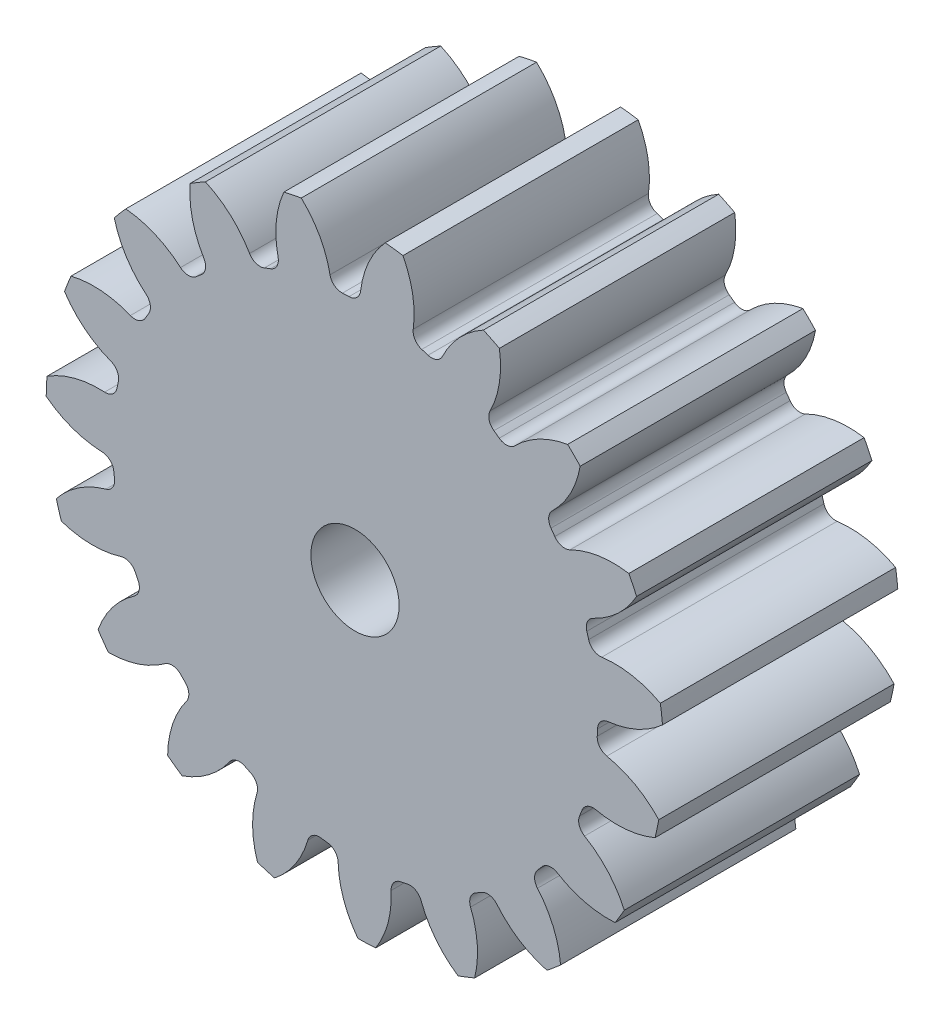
ISO-10303-21;
HEADER;
FILE_DESCRIPTION(('STEP AP214'),'2;1');
FILE_NAME('part.step','',(''),(''),'','','');
FILE_SCHEMA(('AUTOMOTIVE_DESIGN { 1 0 10303 214 1 1 1 1 }'));
ENDSEC;
DATA;
#1=APPLICATION_CONTEXT('core data for automotive mechanical design processes');
#2=APPLICATION_PROTOCOL_DEFINITION('international standard','automotive_design',2000,#1);
#3=PRODUCT_CONTEXT('',#1,'mechanical');
#4=PRODUCT('Part','Part','',(#3));
#5=PRODUCT_RELATED_PRODUCT_CATEGORY('part','',(#4));
#6=PRODUCT_DEFINITION_FORMATION('','',#4);
#7=PRODUCT_DEFINITION_CONTEXT('part definition',#1,'design');
#8=PRODUCT_DEFINITION('design','',#6,#7);
#9=PRODUCT_DEFINITION_SHAPE('','',#8);
#10=(LENGTH_UNIT() NAMED_UNIT(*) SI_UNIT(.MILLI.,.METRE.));
#11=(NAMED_UNIT(*) PLANE_ANGLE_UNIT() SI_UNIT($,.RADIAN.));
#12=(NAMED_UNIT(*) SI_UNIT($,.STERADIAN.) SOLID_ANGLE_UNIT());
#13=UNCERTAINTY_MEASURE_WITH_UNIT(LENGTH_MEASURE(1.E-05),#10,'distance_accuracy_value','');
#14=(GEOMETRIC_REPRESENTATION_CONTEXT(3) GLOBAL_UNCERTAINTY_ASSIGNED_CONTEXT((#13)) GLOBAL_UNIT_ASSIGNED_CONTEXT((#10,
#11,#12)) REPRESENTATION_CONTEXT('',''));
#15=CARTESIAN_POINT('',(0.,0.,0.));
#16=DIRECTION('',(0.,0.,1.));
#17=DIRECTION('',(1.,0.,0.));
#18=AXIS2_PLACEMENT_3D('',#15,#16,#17);
#19=CARTESIAN_POINT('',(0.,0.,101.6));
#20=DIRECTION('',(0.,0.,-1.));
#21=DIRECTION('',(-1.,0.,0.));
#22=AXIS2_PLACEMENT_3D('',#19,#20,#21);
#23=CYLINDRICAL_SURFACE('',#22,133.35);
#24=DIRECTION('',(0.,0.,-1.));
#25=VECTOR('',#24,1.);
#26=CARTESIAN_POINT('',(131.855975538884,19.9053815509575,50.8));
#27=LINE('',#26,#25);
#28=CARTESIAN_POINT('',(131.855975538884,19.9053815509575,101.6));
#29=VERTEX_POINT('',#28);
#30=CARTESIAN_POINT('',(131.855975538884,19.9053815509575,0.));
#31=VERTEX_POINT('',#30);
#32=EDGE_CURVE('E780',#29,#31,#27,.T.);
#33=ORIENTED_EDGE('',*,*,#32,.F.);
#34=CARTESIAN_POINT('',(0.,0.,101.6));
#35=DIRECTION('',(0.,0.,1.));
#36=DIRECTION('',(1.,0.,0.));
#37=AXIS2_PLACEMENT_3D('',#34,#35,#36);
#38=CIRCLE('',#37,133.35);
#39=CARTESIAN_POINT('',(132.784246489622,12.2705494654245,101.6));
#40=VERTEX_POINT('',#39);
#41=EDGE_CURVE('E1463',#40,#29,#38,.T.);
#42=ORIENTED_EDGE('',*,*,#41,.F.);
#43=DIRECTION('',(0.,0.,-1.));
#44=VECTOR('',#43,1.);
#45=CARTESIAN_POINT('',(132.784246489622,12.2705494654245,50.8));
#46=LINE('',#45,#44);
#47=CARTESIAN_POINT('',(132.784246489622,12.2705494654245,0.));
#48=VERTEX_POINT('',#47);
#49=EDGE_CURVE('E1457',#48,#40,#46,.F.);
#50=ORIENTED_EDGE('',*,*,#49,.F.);
#51=CARTESIAN_POINT('',(0.,0.,0.));
#52=DIRECTION('',(0.,0.,1.));
#53=DIRECTION('',(1.,0.,0.));
#54=AXIS2_PLACEMENT_3D('',#51,#52,#53);
#55=CIRCLE('',#54,133.35);
#56=EDGE_CURVE('E1468',#48,#31,#55,.T.);
#57=ORIENTED_EDGE('',*,*,#56,.T.);
#58=EDGE_LOOP('',(#33,#42,#50,#57));
#59=FACE_BOUND('',#58,.T.);
#60=ADVANCED_FACE('F33',(#59),#23,.T.);
#61=DIRECTION('',(0.,0.,-1.));
#62=VECTOR('',#61,1.);
#63=CARTESIAN_POINT('',(121.605388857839,54.7206716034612,50.8));
#64=LINE('',#63,#62);
#65=CARTESIAN_POINT('',(121.605388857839,54.7206716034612,0.));
#66=VERTEX_POINT('',#65);
#67=CARTESIAN_POINT('',(121.605388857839,54.7206716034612,101.6));
#68=VERTEX_POINT('',#67);
#69=EDGE_CURVE('E751',#66,#68,#64,.F.);
#70=ORIENTED_EDGE('',*,*,#69,.F.);
#71=CARTESIAN_POINT('',(118.248388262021,61.6404183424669,0.));
#72=VERTEX_POINT('',#71);
#73=EDGE_CURVE('E1471',#66,#72,#55,.T.);
#74=ORIENTED_EDGE('',*,*,#73,.T.);
#75=DIRECTION('',(0.,0.,-1.));
#76=VECTOR('',#75,1.);
#77=CARTESIAN_POINT('',(118.248388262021,61.6404183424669,50.8));
#78=LINE('',#77,#76);
#79=CARTESIAN_POINT('',(118.248388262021,61.6404183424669,101.6));
#80=VERTEX_POINT('',#79);
#81=EDGE_CURVE('E813',#80,#72,#78,.T.);
#82=ORIENTED_EDGE('',*,*,#81,.F.);
#83=EDGE_CURVE('E1466',#68,#80,#38,.T.);
#84=ORIENTED_EDGE('',*,*,#83,.F.);
#85=EDGE_LOOP('',(#70,#74,#82,#84));
#86=FACE_BOUND('',#85,.T.);
#87=ADVANCED_FACE('F1686',(#86),#23,.T.);
#88=CARTESIAN_POINT('',(0.,0.,101.6));
#89=DIRECTION('',(0.,0.,1.));
#90=DIRECTION('',(1.,0.,0.));
#91=AXIS2_PLACEMENT_3D('',#88,#89,#90);
#92=PLANE('',#91);
#93=CARTESIAN_POINT('',(0.,0.,101.599999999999));
#94=DIRECTION('',(0.,0.,1.));
#95=DIRECTION('',(1.,0.,0.));
#96=AXIS2_PLACEMENT_3D('',#93,#94,#95);
#97=CIRCLE('',#96,19.05);
#98=CARTESIAN_POINT('',(19.05,0.,101.599999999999));
#99=VERTEX_POINT('',#98);
#100=EDGE_CURVE('E768',#99,#99,#97,.T.);
#101=ORIENTED_EDGE('',*,*,#100,.F.);
#102=EDGE_LOOP('',(#101));
#103=FACE_BOUND('',#102,.T.);
#104=ORIENTED_EDGE('',*,*,#41,.T.);
#105=CARTESIAN_POINT('',(112.088630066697,-17.0230298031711,101.6));
#106=DIRECTION('',(0.,0.,-1.));
#107=DIRECTION('',(0.945817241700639,0.32469946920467,0.));
#108=AXIS2_PLACEMENT_3D('',#105,#106,#107);
#109=CIRCLE('',#108,41.8862210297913);
#110=CARTESIAN_POINT('',(106.56079242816,24.4968271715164,101.6));
#111=VERTEX_POINT('',#110);
#112=EDGE_CURVE('E760',#111,#29,#109,.T.);
#113=ORIENTED_EDGE('',*,*,#112,.F.);
#114=CARTESIAN_POINT('',(105.878638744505,29.6205166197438,101.6));
#115=DIRECTION('',(0.,0.,1.));
#116=DIRECTION('',(-0.945817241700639,-0.32469946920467,0.));
#117=AXIS2_PLACEMENT_3D('',#114,#115,#116);
#118=CIRCLE('',#117,5.1689);
#119=CARTESIAN_POINT('',(100.900862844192,28.2279383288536,101.6));
#120=VERTEX_POINT('',#119);
#121=EDGE_CURVE('E758',#120,#111,#118,.T.);
#122=ORIENTED_EDGE('',*,*,#121,.F.);
#123=CARTESIAN_POINT('',(0.,0.,101.6));
#124=DIRECTION('',(0.,0.,-1.));
#125=DIRECTION('',(0.945817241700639,0.32469946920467,0.));
#126=AXIS2_PLACEMENT_3D('',#123,#124,#125);
#127=CIRCLE('',#126,104.775);
#128=CARTESIAN_POINT('',(100.098839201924,30.9519468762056,101.6));
#129=VERTEX_POINT('',#128);
#130=EDGE_CURVE('E743',#129,#120,#127,.T.);
#131=ORIENTED_EDGE('',*,*,#130,.F.);
#132=CARTESIAN_POINT('',(105.037048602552,32.4789095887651,101.6));
#133=DIRECTION('',(0.,0.,1.));
#134=DIRECTION('',(-0.945817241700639,-0.32469946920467,0.));
#135=AXIS2_PLACEMENT_3D('',#132,#133,#134);
#136=CIRCLE('',#135,5.1689);
#137=CARTESIAN_POINT('',(102.833938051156,37.1547871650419,101.6));
#138=VERTEX_POINT('',#137);
#139=EDGE_CURVE('E735',#138,#129,#136,.T.);
#140=ORIENTED_EDGE('',*,*,#139,.F.);
#141=CARTESIAN_POINT('',(84.9810147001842,75.045797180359,101.6));
#142=DIRECTION('',(0.,0.,-1.));
#143=DIRECTION('',(-0.945817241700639,-0.32469946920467,0.));
#144=AXIS2_PLACEMENT_3D('',#141,#142,#143);
#145=CIRCLE('',#144,41.8862210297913);
#146=EDGE_CURVE('E765',#68,#138,#145,.T.);
#147=ORIENTED_EDGE('',*,*,#146,.F.);
#148=ORIENTED_EDGE('',*,*,#83,.T.);
#149=CARTESIAN_POINT('',(111.542727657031,20.2944435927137,101.6));
#150=DIRECTION('',(0.,0.,-1.));
#151=DIRECTION('',(0.789140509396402,0.614212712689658,0.));
#152=AXIS2_PLACEMENT_3D('',#149,#150,#151);
#153=CIRCLE('',#152,41.8862210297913);
#154=CARTESIAN_POINT('',(92.8329279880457,57.7697542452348,101.6));
#155=VERTEX_POINT('',#154);
#156=EDGE_CURVE('E789',#155,#80,#153,.T.);
#157=ORIENTED_EDGE('',*,*,#156,.F.);
#158=CARTESIAN_POINT('',(90.5240760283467,62.3943331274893,101.6));
#159=DIRECTION('',(0.,0.,1.));
#160=DIRECTION('',(-0.789140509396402,-0.614212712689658,0.));
#161=AXIS2_PLACEMENT_3D('',#158,#159,#160);
#162=CIRCLE('',#161,5.1689);
#163=CARTESIAN_POINT('',(86.2681791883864,59.4609273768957,101.6));
#164=VERTEX_POINT('',#163);
#165=EDGE_CURVE('E787',#164,#155,#162,.T.);
#166=ORIENTED_EDGE('',*,*,#165,.F.);
#167=CARTESIAN_POINT('',(0.,0.,101.6));
#168=DIRECTION('',(0.,0.,-1.));
#169=DIRECTION('',(0.789140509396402,0.614212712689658,0.));
#170=AXIS2_PLACEMENT_3D('',#167,#168,#169);
#171=CIRCLE('',#170,104.775);
#172=CARTESIAN_POINT('',(84.6251272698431,61.776924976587,101.6));
#173=VERTEX_POINT('',#172);
#174=EDGE_CURVE('E784',#173,#164,#171,.T.);
#175=ORIENTED_EDGE('',*,*,#174,.F.);
#176=CARTESIAN_POINT('',(88.799966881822,64.8245866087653,101.6));
#177=DIRECTION('',(0.,0.,1.));
#178=DIRECTION('',(-0.789140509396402,-0.614212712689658,0.));
#179=AXIS2_PLACEMENT_3D('',#176,#177,#178);
#180=CIRCLE('',#179,5.1689);
#181=CARTESIAN_POINT('',(85.197971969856,68.5317634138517,101.6));
#182=VERTEX_POINT('',#181);
#183=EDGE_CURVE('E782',#182,#173,#180,.T.);
#184=ORIENTED_EDGE('',*,*,#183,.F.);
#185=CARTESIAN_POINT('',(56.0091784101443,98.5728992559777,101.6));
#186=DIRECTION('',(0.,0.,-1.));
#187=DIRECTION('',(-0.789140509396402,-0.614212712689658,0.));
#188=AXIS2_PLACEMENT_3D('',#185,#186,#187);
#189=CIRCLE('',#188,41.8862210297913);
#190=CARTESIAN_POINT('',(97.2487004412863,91.2409598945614,101.6));
#191=VERTEX_POINT('',#190);
#192=EDGE_CURVE('E792',#191,#182,#189,.T.);
#193=ORIENTED_EDGE('',*,*,#192,.F.);
#194=CARTESIAN_POINT('',(91.8267533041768,96.6957593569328,101.6));
#195=VERTEX_POINT('',#194);
#196=EDGE_CURVE('E1517',#191,#195,#38,.T.);
#197=ORIENTED_EDGE('',*,*,#196,.T.);
#198=CARTESIAN_POINT('',(98.9094399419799,55.4126991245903,101.6));
#199=DIRECTION('',(0.,0.,-1.));
#200=DIRECTION('',(0.546948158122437,0.837166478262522,0.));
#201=AXIS2_PLACEMENT_3D('',#198,#199,#200);
#202=CIRCLE('',#201,41.8862210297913);
#203=CARTESIAN_POINT('',(69.0451753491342,84.7824320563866,101.6));
#204=VERTEX_POINT('',#203);
#205=EDGE_CURVE('E824',#204,#195,#202,.T.);
#206=ORIENTED_EDGE('',*,*,#205,.F.);
#207=CARTESIAN_POINT('',(65.3598250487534,88.4067554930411,101.6));
#208=DIRECTION('',(0.,0.,1.));
#209=DIRECTION('',(-0.546948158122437,-0.837166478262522,0.));
#210=AXIS2_PLACEMENT_3D('',#207,#208,#209);
#211=CIRCLE('',#210,5.1689);
#212=CARTESIAN_POINT('',(62.2869997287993,84.2504023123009,101.6));
#213=VERTEX_POINT('',#212);
#214=EDGE_CURVE('E822',#213,#204,#211,.T.);
#215=ORIENTED_EDGE('',*,*,#214,.F.);
#216=CARTESIAN_POINT('',(0.,0.,101.6));
#217=DIRECTION('',(0.,0.,-1.));
#218=DIRECTION('',(0.546948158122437,0.837166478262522,0.));
#219=AXIS2_PLACEMENT_3D('',#216,#217,#218);
#220=CIRCLE('',#219,104.775);
#221=CARTESIAN_POINT('',(59.9809697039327,85.9074146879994,101.6));
#222=VERTEX_POINT('',#221);
#223=EDGE_CURVE('E819',#222,#213,#220,.T.);
#224=ORIENTED_EDGE('',*,*,#223,.F.);
#225=CARTESIAN_POINT('',(62.9400308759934,90.1455138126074,101.6));
#226=DIRECTION('',(0.,0.,1.));
#227=DIRECTION('',(-0.546948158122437,-0.837166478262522,0.));
#228=AXIS2_PLACEMENT_3D('',#225,#226,#227);
#229=CIRCLE('',#228,5.1689);
#230=CARTESIAN_POINT('',(58.3294836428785,92.4822597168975,101.6));
#231=VERTEX_POINT('',#230);
#232=EDGE_CURVE('E817',#231,#222,#229,.T.);
#233=ORIENTED_EDGE('',*,*,#232,.F.);
#234=CARTESIAN_POINT('',(20.9678785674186,111.418098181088,101.6));
#235=DIRECTION('',(0.,0.,-1.));
#236=DIRECTION('',(-0.546948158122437,-0.837166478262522,0.));
#237=AXIS2_PLACEMENT_3D('',#234,#235,#236);
#238=CIRCLE('',#237,41.8862210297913);
#239=CARTESIAN_POINT('',(62.3536063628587,117.873874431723,101.6));
#240=VERTEX_POINT('',#239);
#241=EDGE_CURVE('E827',#240,#231,#238,.T.);
#242=ORIENTED_EDGE('',*,*,#241,.F.);
#243=CARTESIAN_POINT('',(55.454264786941,121.272614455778,101.6));
#244=VERTEX_POINT('',#243);
#245=EDGE_CURVE('E1668',#240,#244,#38,.T.);
#246=ORIENTED_EDGE('',*,*,#245,.T.);
#247=CARTESIAN_POINT('',(75.5577796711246,84.5261288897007,101.6));
#248=DIRECTION('',(0.,0.,-1.));
#249=DIRECTION('',(0.24548548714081,0.969400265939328,0.));
#250=AXIS2_PLACEMENT_3D('',#247,#248,#249);
#251=CIRCLE('',#250,41.8862210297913);
#252=CARTESIAN_POINT('',(37.7753066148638,102.607617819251,101.6));
#253=VERTEX_POINT('',#252);
#254=EDGE_CURVE('E862',#253,#244,#251,.T.);
#255=ORIENTED_EDGE('',*,*,#254,.F.);
#256=CARTESIAN_POINT('',(33.1128228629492,104.838934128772,101.6));
#257=DIRECTION('',(0.,0.,1.));
#258=DIRECTION('',(-0.24548548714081,-0.969400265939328,0.));
#259=AXIS2_PLACEMENT_3D('',#256,#257,#258);
#260=CIRCLE('',#259,5.1689);
#261=CARTESIAN_POINT('',(31.5560573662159,99.9100388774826,101.6));
#262=VERTEX_POINT('',#261);
#263=EDGE_CURVE('E860',#262,#253,#260,.T.);
#264=ORIENTED_EDGE('',*,*,#263,.F.);
#265=CARTESIAN_POINT('',(0.,0.,101.6));
#266=DIRECTION('',(0.,0.,-1.));
#267=DIRECTION('',(0.24548548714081,0.969400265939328,0.));
#268=AXIS2_PLACEMENT_3D('',#265,#266,#267);
#269=CIRCLE('',#268,104.775);
#270=CARTESIAN_POINT('',(28.8369433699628,100.728503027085,101.6));
#271=VERTEX_POINT('',#270);
#272=EDGE_CURVE('E857',#271,#262,#269,.T.);
#273=ORIENTED_EDGE('',*,*,#272,.F.);
#274=CARTESIAN_POINT('',(30.2595659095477,105.697775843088,101.6));
#275=DIRECTION('',(0.,0.,1.));
#276=DIRECTION('',(-0.24548548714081,-0.969400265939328,0.));
#277=AXIS2_PLACEMENT_3D('',#274,#275,#276);
#278=CIRCLE('',#277,5.1689);
#279=CARTESIAN_POINT('',(25.1400906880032,106.410868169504,101.6));
#280=VERTEX_POINT('',#279);
#281=EDGE_CURVE('E855',#280,#271,#278,.T.);
#282=ORIENTED_EDGE('',*,*,#281,.F.);
#283=CARTESIAN_POINT('',(-16.3456162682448,112.189417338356,101.6));
#284=DIRECTION('',(0.,0.,-1.));
#285=DIRECTION('',(-0.24548548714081,-0.969400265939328,0.));
#286=AXIS2_PLACEMENT_3D('',#283,#284,#285);
#287=CIRCLE('',#286,41.8862210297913);
#288=CARTESIAN_POINT('',(20.701531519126,131.733325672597,101.6));
#289=VERTEX_POINT('',#288);
#290=EDGE_CURVE('E865',#289,#280,#287,.T.);
#291=ORIENTED_EDGE('',*,*,#290,.F.);
#292=CARTESIAN_POINT('',(13.0724462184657,132.707700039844,101.6));
#293=VERTEX_POINT('',#292);
#294=EDGE_CURVE('E1664',#289,#293,#38,.T.);
#295=ORIENTED_EDGE('',*,*,#294,.T.);
#296=CARTESIAN_POINT('',(44.0182615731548,104.479841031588,101.6));
#297=DIRECTION('',(0.,0.,-1.));
#298=DIRECTION('',(-0.0825793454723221,0.996584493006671,0.));
#299=AXIS2_PLACEMENT_3D('',#296,#297,#298);
#300=CIRCLE('',#299,41.8862210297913);
#301=CARTESIAN_POINT('',(2.41189726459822,109.313676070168,101.6));
#302=VERTEX_POINT('',#301);
#303=EDGE_CURVE('E900',#302,#293,#300,.T.);
#304=ORIENTED_EDGE('',*,*,#303,.F.);
#305=CARTESIAN_POINT('',(-2.72246747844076,109.910187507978,101.6));
#306=DIRECTION('',(0.,0.,1.));
#307=DIRECTION('',(0.0825793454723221,-0.996584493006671,0.));
#308=AXIS2_PLACEMENT_3D('',#305,#306,#307);
#309=CIRCLE('',#308,5.1689);
#310=CARTESIAN_POINT('',(-2.59447345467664,104.742872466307,101.6));
#311=VERTEX_POINT('',#310);
#312=EDGE_CURVE('E898',#311,#302,#309,.T.);
#313=ORIENTED_EDGE('',*,*,#312,.F.);
#314=CARTESIAN_POINT('',(0.,0.,101.6));
#315=DIRECTION('',(0.,0.,-1.));
#316=DIRECTION('',(-0.0825793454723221,0.996584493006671,0.));
#317=AXIS2_PLACEMENT_3D('',#314,#315,#316);
#318=CIRCLE('',#317,104.775);
#319=CARTESIAN_POINT('',(-5.43201322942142,104.634095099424,101.6));
#320=VERTEX_POINT('',#319);
#321=EDGE_CURVE('E895',#320,#311,#318,.T.);
#322=ORIENTED_EDGE('',*,*,#321,.F.);
#323=CARTESIAN_POINT('',(-5.69999254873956,109.796043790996,101.6));
#324=DIRECTION('',(0.,0.,1.));
#325=DIRECTION('',(0.0825793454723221,-0.996584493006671,0.));
#326=AXIS2_PLACEMENT_3D('',#323,#324,#325);
#327=CIRCLE('',#326,5.1689);
#328=CARTESIAN_POINT('',(-10.7736211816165,108.808207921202,101.6));
#329=VERTEX_POINT('',#328);
#330=EDGE_CURVE('E893',#329,#320,#327,.T.);
#331=ORIENTED_EDGE('',*,*,#330,.F.);
#332=CARTESIAN_POINT('',(-51.8878099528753,100.803272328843,101.6));
#333=DIRECTION('',(0.,0.,-1.));
#334=DIRECTION('',(0.0825793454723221,-0.996584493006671,0.));
#335=AXIS2_PLACEMENT_3D('',#332,#333,#334);
#336=CIRCLE('',#335,41.8862210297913);
#337=CARTESIAN_POINT('',(-23.1938754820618,131.317427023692,101.6));
#338=VERTEX_POINT('',#337);
#339=EDGE_CURVE('E903',#338,#329,#336,.T.);
#340=ORIENTED_EDGE('',*,*,#339,.F.);
#341=CARTESIAN_POINT('',(-30.7259747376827,129.761847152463,101.6));
#342=VERTEX_POINT('',#341);
#343=EDGE_CURVE('E1660',#338,#342,#38,.T.);
#344=ORIENTED_EDGE('',*,*,#343,.T.);
#345=CARTESIAN_POINT('',(7.70868182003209,113.111541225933,101.6));
#346=DIRECTION('',(0.,0.,-1.));
#347=DIRECTION('',(-0.40169542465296,0.915773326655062,0.));
#348=AXIS2_PLACEMENT_3D('',#345,#346,#347);
#349=CIRCLE('',#348,41.8862210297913);
#350=CARTESIAN_POINT('',(-33.2128785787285,104.173901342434,101.6));
#351=VERTEX_POINT('',#350);
#352=EDGE_CURVE('E938',#351,#342,#349,.T.);
#353=ORIENTED_EDGE('',*,*,#352,.F.);
#354=CARTESIAN_POINT('',(-38.2627362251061,103.070966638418,101.6));
#355=DIRECTION('',(0.,0.,1.));
#356=DIRECTION('',(0.40169542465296,-0.915773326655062,0.));
#357=AXIS2_PLACEMENT_3D('',#354,#355,#356);
#358=CIRCLE('',#357,5.1689);
#359=CARTESIAN_POINT('',(-36.4638528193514,98.2251905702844,101.6));
#360=VERTEX_POINT('',#359);
#361=EDGE_CURVE('E936',#360,#351,#358,.T.);
#362=ORIENTED_EDGE('',*,*,#361,.F.);
#363=CARTESIAN_POINT('',(0.,0.,101.6));
#364=DIRECTION('',(0.,0.,-1.));
#365=DIRECTION('',(-0.40169542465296,0.915773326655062,0.));
#366=AXIS2_PLACEMENT_3D('',#363,#364,#365);
#367=CIRCLE('',#366,104.775);
#368=CARTESIAN_POINT('',(-39.1123269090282,97.2009594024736,101.6));
#369=VERTEX_POINT('',#368);
#370=EDGE_CURVE('E933',#369,#360,#367,.T.);
#371=ORIENTED_EDGE('',*,*,#370,.F.);
#372=CARTESIAN_POINT('',(-41.0418683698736,101.996206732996,101.6));
#373=DIRECTION('',(0.,0.,1.));
#374=DIRECTION('',(0.40169542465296,-0.915773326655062,0.));
#375=AXIS2_PLACEMENT_3D('',#372,#373,#374);
#376=CIRCLE('',#375,5.1689);
#377=CARTESIAN_POINT('',(-45.5198440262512,99.4144900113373,101.6));
#378=VERTEX_POINT('',#377);
#379=EDGE_CURVE('E931',#378,#369,#376,.T.);
#380=ORIENTED_EDGE('',*,*,#379,.F.);
#381=CARTESIAN_POINT('',(-81.8071543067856,78.4935286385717,101.6));
#382=DIRECTION('',(0.,0.,-1.));
#383=DIRECTION('',(0.40169542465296,-0.915773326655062,0.));
#384=AXIS2_PLACEMENT_3D('',#381,#382,#383);
#385=CIRCLE('',#384,41.8862210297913);
#386=CARTESIAN_POINT('',(-64.5758661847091,116.671247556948,101.6));
#387=VERTEX_POINT('',#386);
#388=EDGE_CURVE('E941',#387,#378,#385,.T.);
#389=ORIENTED_EDGE('',*,*,#388,.F.);
#390=CARTESIAN_POINT('',(-71.1947595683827,112.7542846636,101.6));
#391=VERTEX_POINT('',#390);
#392=EDGE_CURVE('E1656',#387,#391,#38,.T.);
#393=ORIENTED_EDGE('',*,*,#392,.T.);
#394=CARTESIAN_POINT('',(-29.4362532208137,109.485850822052,101.6));
#395=DIRECTION('',(0.,0.,-1.));
#396=DIRECTION('',(-0.677281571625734,0.735723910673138,0.));
#397=AXIS2_PLACEMENT_3D('',#394,#395,#396);
#398=CIRCLE('',#397,41.8862210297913);
#399=CARTESIAN_POINT('',(-65.2385236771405,87.745267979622,101.6));
#400=VERTEX_POINT('',#399);
#401=EDGE_CURVE('E976',#400,#391,#398,.T.);
#402=ORIENTED_EDGE('',*,*,#401,.F.);
#403=CARTESIAN_POINT('',(-69.656643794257,85.0624072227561,101.6));
#404=DIRECTION('',(0.,0.,1.));
#405=DIRECTION('',(0.677281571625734,-0.735723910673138,0.));
#406=AXIS2_PLACEMENT_3D('',#403,#404,#405);
#407=CIRCLE('',#406,5.1689);
#408=CARTESIAN_POINT('',(-66.3818079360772,81.0632851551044,101.6));
#409=VERTEX_POINT('',#408);
#410=EDGE_CURVE('E974',#409,#400,#407,.T.);
#411=ORIENTED_EDGE('',*,*,#410,.F.);
#412=CARTESIAN_POINT('',(0.,0.,101.6));
#413=DIRECTION('',(0.,0.,-1.));
#414=DIRECTION('',(-0.677281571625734,0.735723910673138,0.));
#415=AXIS2_PLACEMENT_3D('',#412,#413,#414);
#416=CIRCLE('',#415,104.775);
#417=CARTESIAN_POINT('',(-68.5542130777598,79.2345915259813,101.6));
#418=VERTEX_POINT('',#417);
#419=EDGE_CURVE('E971',#418,#409,#416,.T.);
#420=ORIENTED_EDGE('',*,*,#419,.F.);
#421=CARTESIAN_POINT('',(-71.9362209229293,83.143498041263,101.6));
#422=DIRECTION('',(0.,0.,1.));
#423=DIRECTION('',(0.677281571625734,-0.735723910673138,0.));
#424=AXIS2_PLACEMENT_3D('',#421,#422,#423);
#425=CIRCLE('',#424,5.1689);
#426=CARTESIAN_POINT('',(-75.3332854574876,79.2476695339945,101.6));
#427=VERTEX_POINT('',#426);
#428=EDGE_CURVE('E969',#427,#418,#425,.T.);
#429=ORIENTED_EDGE('',*,*,#428,.F.);
#430=CARTESIAN_POINT('',(-102.861424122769,47.6777931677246,101.6));
#431=DIRECTION('',(0.,0.,-1.));
#432=DIRECTION('',(0.677281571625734,-0.735723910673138,0.));
#433=AXIS2_PLACEMENT_3D('',#430,#431,#432);
#434=CIRCLE('',#433,41.8862210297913);
#435=CARTESIAN_POINT('',(-98.96005978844,89.3819280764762,101.6));
#436=VERTEX_POINT('',#435);
#437=EDGE_CURVE('E979',#436,#427,#434,.T.);
#438=ORIENTED_EDGE('',*,*,#437,.F.);
#439=CARTESIAN_POINT('',(-103.948487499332,83.5280458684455,101.6));
#440=VERTEX_POINT('',#439);
#441=EDGE_CURVE('E1652',#436,#440,#38,.T.);
#442=ORIENTED_EDGE('',*,*,#441,.T.);
#443=CARTESIAN_POINT('',(-63.391313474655,93.9956696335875,101.6));
#444=DIRECTION('',(0.,0.,-1.));
#445=DIRECTION('',(-0.879473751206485,0.475947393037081,0.));
#446=AXIS2_PLACEMENT_3D('',#443,#444,#445);
#447=CIRCLE('',#446,41.8862210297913);
#448=CARTESIAN_POINT('',(-90.1945624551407,61.8080733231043,101.6));
#449=VERTEX_POINT('',#448);
#450=EDGE_CURVE('E1014',#449,#440,#447,.T.);
#451=ORIENTED_EDGE('',*,*,#450,.F.);
#452=CARTESIAN_POINT('',(-93.5021731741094,57.8360161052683,101.6));
#453=DIRECTION('',(0.,0.,1.));
#454=DIRECTION('',(0.879473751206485,-0.475947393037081,0.));
#455=AXIS2_PLACEMENT_3D('',#452,#453,#454);
#456=CIRCLE('',#455,5.1689);
#457=CARTESIAN_POINT('',(-89.1062641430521,55.1169149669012,101.6));
#458=VERTEX_POINT('',#457);
#459=EDGE_CURVE('E1012',#458,#449,#456,.T.);
#460=ORIENTED_EDGE('',*,*,#459,.F.);
#461=CARTESIAN_POINT('',(0.,0.,101.6));
#462=DIRECTION('',(0.,0.,-1.));
#463=DIRECTION('',(-0.879473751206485,0.475947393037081,0.));
#464=AXIS2_PLACEMENT_3D('',#461,#462,#463);
#465=CIRCLE('',#464,104.775);
#466=CARTESIAN_POINT('',(-90.5671865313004,52.6819262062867,101.6));
#467=VERTEX_POINT('',#466);
#468=EDGE_CURVE('E1009',#467,#458,#465,.T.);
#469=ORIENTED_EDGE('',*,*,#468,.F.);
#470=CARTESIAN_POINT('',(-95.0351677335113,55.2809012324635,101.6));
#471=DIRECTION('',(0.,0.,1.));
#472=DIRECTION('',(0.879473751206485,-0.475947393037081,0.));
#473=AXIS2_PLACEMENT_3D('',#470,#471,#472);
#474=CIRCLE('',#473,5.1689);
#475=CARTESIAN_POINT('',(-96.9831964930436,50.4931344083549,101.6));
#476=VERTEX_POINT('',#475);
#477=EDGE_CURVE('E1007',#476,#467,#474,.T.);
#478=ORIENTED_EDGE('',*,*,#477,.F.);
#479=CARTESIAN_POINT('',(-112.769062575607,11.6954290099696,101.6));
#480=DIRECTION('',(0.,0.,-1.));
#481=DIRECTION('',(0.879473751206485,-0.475947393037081,0.));
#482=AXIS2_PLACEMENT_3D('',#479,#480,#481);
#483=CIRCLE('',#482,41.8862210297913);
#484=CARTESIAN_POINT('',(-122.620395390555,52.4066897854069,101.6));
#485=VERTEX_POINT('',#484);
#486=EDGE_CURVE('E1017',#485,#476,#483,.T.);
#487=ORIENTED_EDGE('',*,*,#486,.F.);
#488=CARTESIAN_POINT('',(-125.43778388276,45.2502472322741,101.6));
#489=VERTEX_POINT('',#488);
#490=EDGE_CURVE('E1648',#485,#489,#38,.T.);
#491=ORIENTED_EDGE('',*,*,#490,.T.);
#492=CARTESIAN_POINT('',(-90.4769412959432,68.3195991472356,101.6));
#493=DIRECTION('',(0.,0.,-1.));
#494=DIRECTION('',(-0.986361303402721,0.164594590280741,0.));
#495=AXIS2_PLACEMENT_3D('',#492,#493,#494);
#496=CIRCLE('',#495,41.8862210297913);
#497=CARTESIAN_POINT('',(-105.376620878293,29.1730148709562,101.6));
#498=VERTEX_POINT('',#497);
#499=EDGE_CURVE('E1052',#498,#489,#496,.T.);
#500=ORIENTED_EDGE('',*,*,#499,.F.);
#501=CARTESIAN_POINT('',(-107.215291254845,24.3421952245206,101.6));
#502=DIRECTION('',(0.,0.,1.));
#503=DIRECTION('',(0.986361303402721,-0.164594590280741,0.));
#504=AXIS2_PLACEMENT_3D('',#501,#502,#503);
#505=CIRCLE('',#504,5.1689);
#506=CARTESIAN_POINT('',(-102.174674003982,23.1977718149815,101.6));
#507=VERTEX_POINT('',#506);
#508=EDGE_CURVE('E1050',#507,#498,#505,.T.);
#509=ORIENTED_EDGE('',*,*,#508,.F.);
#510=CARTESIAN_POINT('',(0.,0.,101.6));
#511=DIRECTION('',(0.,0.,-1.));
#512=DIRECTION('',(-0.986361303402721,0.164594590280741,0.));
#513=AXIS2_PLACEMENT_3D('',#510,#511,#512);
#514=CIRCLE('',#513,104.775);
#515=CARTESIAN_POINT('',(-102.765800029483,20.4203567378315,101.6));
#516=VERTEX_POINT('',#515);
#517=EDGE_CURVE('E1047',#516,#507,#514,.T.);
#518=ORIENTED_EDGE('',*,*,#517,.F.);
#519=CARTESIAN_POINT('',(-107.835579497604,21.4277610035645,101.6));
#520=DIRECTION('',(0.,0.,1.));
#521=DIRECTION('',(0.986361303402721,-0.164594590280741,0.));
#522=AXIS2_PLACEMENT_3D('',#519,#520,#521);
#523=CIRCLE('',#522,5.1689);
#524=CARTESIAN_POINT('',(-108.123473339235,16.2668846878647,101.6));
#525=VERTEX_POINT('',#524);
#526=EDGE_CURVE('E1045',#525,#516,#523,.T.);
#527=ORIENTED_EDGE('',*,*,#526,.F.);
#528=CARTESIAN_POINT('',(-110.456423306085,-25.5543163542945,101.6));
#529=DIRECTION('',(0.,0.,-1.));
#530=DIRECTION('',(0.986361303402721,-0.164594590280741,0.));
#531=AXIS2_PLACEMENT_3D('',#528,#529,#530);
#532=CIRCLE('',#531,41.8862210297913);
#533=CARTESIAN_POINT('',(-132.992908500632,9.7523734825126,101.6));
#534=VERTEX_POINT('',#533);
#535=EDGE_CURVE('E1055',#534,#525,#532,.T.);
#536=ORIENTED_EDGE('',*,*,#535,.F.);
#537=CARTESIAN_POINT('',(-133.333950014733,2.06888217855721,101.6));
#538=VERTEX_POINT('',#537);
#539=EDGE_CURVE('E1644',#534,#538,#38,.T.);
#540=ORIENTED_EDGE('',*,*,#539,.T.);
#541=CARTESIAN_POINT('',(-107.757988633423,35.2400400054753,101.6));
#542=DIRECTION('',(0.,0.,-1.));
#543=DIRECTION('',(-0.986361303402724,-0.164594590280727,0.));
#544=AXIS2_PLACEMENT_3D('',#541,#542,#543);
#545=CIRCLE('',#544,41.8862210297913);
#546=CARTESIAN_POINT('',(-109.13948734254,-6.62339240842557,101.6));
#547=VERTEX_POINT('',#546);
#548=EDGE_CURVE('E1090',#547,#538,#545,.T.);
#549=ORIENTED_EDGE('',*,*,#548,.F.);
#550=CARTESIAN_POINT('',(-109.309968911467,-11.7894802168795,101.6));
#551=DIRECTION('',(0.,0.,1.));
#552=DIRECTION('',(0.986361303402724,0.164594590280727,0.));
#553=AXIS2_PLACEMENT_3D('',#550,#551,#552);
#554=CIRCLE('',#553,5.1689);
#555=CARTESIAN_POINT('',(-104.170872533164,-11.2352098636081,101.6));
#556=VERTEX_POINT('',#555);
#557=EDGE_CURVE('E1088',#556,#547,#554,.T.);
#558=ORIENTED_EDGE('',*,*,#557,.F.);
#559=CARTESIAN_POINT('',(0.,0.,101.6));
#560=DIRECTION('',(0.,0.,-1.));
#561=DIRECTION('',(-0.986361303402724,-0.164594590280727,0.));
#562=AXIS2_PLACEMENT_3D('',#559,#560,#561);
#563=CIRCLE('',#562,104.775);
#564=CARTESIAN_POINT('',(-103.828144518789,-14.0540752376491,101.6));
#565=VERTEX_POINT('',#564);
#566=EDGE_CURVE('E1085',#565,#556,#563,.T.);
#567=ORIENTED_EDGE('',*,*,#566,.F.);
#568=CARTESIAN_POINT('',(-108.950332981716,-14.7474096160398,101.6));
#569=DIRECTION('',(0.,0.,1.));
#570=DIRECTION('',(0.986361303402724,0.164594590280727,0.));
#571=AXIS2_PLACEMENT_3D('',#568,#569,#570);
#572=CIRCLE('',#571,5.1689);
#573=CARTESIAN_POINT('',(-107.546894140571,-19.7221343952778,101.6));
#574=VERTEX_POINT('',#573);
#575=EDGE_CURVE('E1083',#574,#565,#572,.T.);
#576=ORIENTED_EDGE('',*,*,#575,.F.);
#577=CARTESIAN_POINT('',(-96.1741166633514,-60.0348550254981,101.6));
#578=DIRECTION('',(0.,0.,-1.));
#579=DIRECTION('',(0.986361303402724,0.164594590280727,0.));
#580=AXIS2_PLACEMENT_3D('',#577,#578,#579);
#581=CIRCLE('',#580,41.8862210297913);
#582=CARTESIAN_POINT('',(-128.953576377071,-33.958763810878,101.6));
#583=VERTEX_POINT('',#582);
#584=EDGE_CURVE('E1093',#583,#574,#581,.T.);
#585=ORIENTED_EDGE('',*,*,#584,.F.);
#586=CARTESIAN_POINT('',(-126.781313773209,-41.3366783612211,101.6));
#587=VERTEX_POINT('',#586);
#588=EDGE_CURVE('E1640',#583,#587,#38,.T.);
#589=ORIENTED_EDGE('',*,*,#588,.T.);
#590=CARTESIAN_POINT('',(-113.361785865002,-1.65832427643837,101.6));
#591=DIRECTION('',(0.,0.,-1.));
#592=DIRECTION('',(-0.879473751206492,-0.475947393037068,0.));
#593=AXIS2_PLACEMENT_3D('',#590,#591,#592);
#594=CIRCLE('',#593,41.8862210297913);
#595=CARTESIAN_POINT('',(-101.075396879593,-41.7020523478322,101.6));
#596=VERTEX_POINT('',#595);
#597=EDGE_CURVE('E1128',#596,#587,#594,.T.);
#598=ORIENTED_EDGE('',*,*,#597,.F.);
#599=CARTESIAN_POINT('',(-99.5592153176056,-46.643582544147,101.6));
#600=DIRECTION('',(0.,0.,1.));
#601=DIRECTION('',(0.879473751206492,0.475947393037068,0.));
#602=AXIS2_PLACEMENT_3D('',#599,#600,#601);
#603=CIRCLE('',#602,5.1689);
#604=CARTESIAN_POINT('',(-94.8785406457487,-44.4506822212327,101.6));
#605=VERTEX_POINT('',#604);
#606=EDGE_CURVE('E1126',#605,#596,#603,.T.);
#607=ORIENTED_EDGE('',*,*,#606,.F.);
#608=CARTESIAN_POINT('',(0.,0.,101.6));
#609=DIRECTION('',(0.,0.,-1.));
#610=DIRECTION('',(-0.879473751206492,-0.475947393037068,0.));
#611=AXIS2_PLACEMENT_3D('',#608,#609,#610);
#612=CIRCLE('',#611,104.775);
#613=CARTESIAN_POINT('',(-93.6390984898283,-47.0055300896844,101.6));
#614=VERTEX_POINT('',#613);
#615=EDGE_CURVE('E1123',#614,#605,#612,.T.);
#616=ORIENTED_EDGE('',*,*,#615,.F.);
#617=CARTESIAN_POINT('',(-98.2586273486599,-49.3244695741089,101.6));
#618=DIRECTION('',(0.,0.,1.));
#619=DIRECTION('',(0.879473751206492,0.475947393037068,0.));
#620=AXIS2_PLACEMENT_3D('',#617,#618,#619);
#621=CIRCLE('',#620,5.1689);
#622=CARTESIAN_POINT('',(-95.3159401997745,-53.5739541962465,101.6));
#623=VERTEX_POINT('',#622);
#624=EDGE_CURVE('E1121',#623,#614,#621,.T.);
#625=ORIENTED_EDGE('',*,*,#624,.F.);
#626=CARTESIAN_POINT('',(-71.4698521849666,-88.0096856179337,101.6));
#627=DIRECTION('',(0.,0.,-1.));
#628=DIRECTION('',(0.879473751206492,0.475947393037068,0.));
#629=AXIS2_PLACEMENT_3D('',#626,#627,#628);
#630=CIRCLE('',#629,41.8862210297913);
#631=CARTESIAN_POINT('',(-110.940123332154,-73.9899421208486,101.6));
#632=VERTEX_POINT('',#631);
#633=EDGE_CURVE('E1131',#632,#623,#630,.T.);
#634=ORIENTED_EDGE('',*,*,#633,.F.);
#635=CARTESIAN_POINT('',(-106.489954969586,-80.26276839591,101.6));
#636=VERTEX_POINT('',#635);
#637=EDGE_CURVE('E1636',#632,#636,#38,.T.);
#638=ORIENTED_EDGE('',*,*,#637,.T.);
#639=CARTESIAN_POINT('',(-106.681074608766,-38.3769833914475,101.6));
#640=DIRECTION('',(0.,0.,-1.));
#641=DIRECTION('',(-0.677281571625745,-0.735723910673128,0.));
#642=AXIS2_PLACEMENT_3D('',#639,#640,#641);
#643=CIRCLE('',#642,41.8862210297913);
#644=CARTESIAN_POINT('',(-82.0582188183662,-72.2616478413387,101.6));
#645=VERTEX_POINT('',#644);
#646=EDGE_CURVE('E1166',#645,#636,#643,.T.);
#647=ORIENTED_EDGE('',*,*,#646,.F.);
#648=CARTESIAN_POINT('',(-79.0196759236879,-76.4431289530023,101.6));
#649=DIRECTION('',(0.,0.,1.));
#650=DIRECTION('',(0.677281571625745,0.735723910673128,0.));
#651=AXIS2_PLACEMENT_3D('',#648,#649,#650);
#652=CIRCLE('',#651,5.1689);
#653=CARTESIAN_POINT('',(-75.3046466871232,-72.8492334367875,101.6));
#654=VERTEX_POINT('',#653);
#655=EDGE_CURVE('E1164',#654,#645,#652,.T.);
#656=ORIENTED_EDGE('',*,*,#655,.F.);
#657=CARTESIAN_POINT('',(0.,0.,101.6));
#658=DIRECTION('',(0.,0.,-1.));
#659=DIRECTION('',(-0.677281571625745,-0.735723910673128,0.));
#660=AXIS2_PLACEMENT_3D('',#657,#658,#659);
#661=CIRCLE('',#660,104.775);
#662=CARTESIAN_POINT('',(-73.3028031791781,-74.8632063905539,101.6));
#663=VERTEX_POINT('',#662);
#664=EDGE_CURVE('E1161',#663,#654,#661,.T.);
#665=ORIENTED_EDGE('',*,*,#664,.F.);
#666=CARTESIAN_POINT('',(-76.9190748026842,-78.5564579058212,101.6));
#667=DIRECTION('',(0.,0.,1.));
#668=DIRECTION('',(0.677281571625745,0.735723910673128,0.));
#669=AXIS2_PLACEMENT_3D('',#666,#667,#668);
#670=CIRCLE('',#669,5.1689);
#671=CARTESIAN_POINT('',(-72.756025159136,-81.6202047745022,101.6));
#672=VERTEX_POINT('',#671);
#673=EDGE_CURVE('E1159',#672,#663,#670,.T.);
#674=ORIENTED_EDGE('',*,*,#673,.F.);
#675=CARTESIAN_POINT('',(-39.020720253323,-106.44730116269,101.6));
#676=DIRECTION('',(0.,0.,-1.));
#677=DIRECTION('',(0.677281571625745,0.735723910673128,0.));
#678=AXIS2_PLACEMENT_3D('',#675,#676,#677);
#679=CIRCLE('',#678,41.8862210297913);
#680=CARTESIAN_POINT('',(-80.904586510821,-106.003162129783,101.6));
#681=VERTEX_POINT('',#680);
#682=EDGE_CURVE('E1169',#681,#672,#679,.T.);
#683=ORIENTED_EDGE('',*,*,#682,.F.);
#684=CARTESIAN_POINT('',(-74.6587571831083,-110.491142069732,101.6));
#685=VERTEX_POINT('',#684);
#686=EDGE_CURVE('E1632',#681,#685,#38,.T.);
#687=ORIENTED_EDGE('',*,*,#686,.T.);
#688=CARTESIAN_POINT('',(-88.4398135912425,-70.9369008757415,101.6));
#689=DIRECTION('',(0.,0.,-1.));
#690=DIRECTION('',(-0.401695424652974,-0.915773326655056,0.));
#691=AXIS2_PLACEMENT_3D('',#688,#689,#690);
#692=CIRCLE('',#691,41.8862210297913);
#693=CARTESIAN_POINT('',(-54.1487594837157,-94.9905725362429,101.6));
#694=VERTEX_POINT('',#693);
#695=EDGE_CURVE('E1204',#694,#685,#692,.T.);
#696=ORIENTED_EDGE('',*,*,#695,.F.);
#697=CARTESIAN_POINT('',(-49.9171285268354,-97.9588762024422,101.6));
#698=DIRECTION('',(0.,0.,1.));
#699=DIRECTION('',(0.401695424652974,0.915773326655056,0.));
#700=AXIS2_PLACEMENT_3D('',#697,#698,#699);
#701=CIRCLE('',#700,5.1689);
#702=CARTESIAN_POINT('',(-47.5703257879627,-93.3534398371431,101.6));
#703=VERTEX_POINT('',#702);
#704=EDGE_CURVE('E1202',#703,#694,#701,.T.);
#705=ORIENTED_EDGE('',*,*,#704,.F.);
#706=CARTESIAN_POINT('',(0.,0.,101.6));
#707=DIRECTION('',(0.,0.,-1.));
#708=DIRECTION('',(-0.401695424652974,-0.915773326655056,0.));
#709=AXIS2_PLACEMENT_3D('',#706,#707,#708);
#710=CIRCLE('',#709,104.775);
#711=CARTESIAN_POINT('',(-45.0230117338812,-94.6082926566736,101.6));
#712=VERTEX_POINT('',#711);
#713=EDGE_CURVE('E1199',#712,#703,#710,.T.);
#714=ORIENTED_EDGE('',*,*,#713,.F.);
#715=CARTESIAN_POINT('',(-47.2441469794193,-99.2756350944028,101.6));
#716=DIRECTION('',(0.,0.,1.));
#717=DIRECTION('',(0.401695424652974,0.915773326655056,0.));
#718=AXIS2_PLACEMENT_3D('',#715,#716,#717);
#719=CIRCLE('',#718,5.1689);
#720=CARTESIAN_POINT('',(-42.3118658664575,-100.821639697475,101.6));
#721=VERTEX_POINT('',#720);
#722=EDGE_CURVE('E1197',#721,#712,#719,.T.);
#723=ORIENTED_EDGE('',*,*,#722,.F.);
#724=CARTESIAN_POINT('',(-2.34308781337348,-113.349699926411,101.6));
#725=DIRECTION('',(0.,0.,-1.));
#726=DIRECTION('',(0.401695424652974,0.915773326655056,0.));
#727=AXIS2_PLACEMENT_3D('',#724,#725,#726);
#728=CIRCLE('',#727,41.8862210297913);
#729=CARTESIAN_POINT('',(-42.1017823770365,-126.529294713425,101.6));
#730=VERTEX_POINT('',#729);
#731=EDGE_CURVE('E1207',#730,#721,#728,.T.);
#732=ORIENTED_EDGE('',*,*,#731,.F.);
#733=CARTESIAN_POINT('',(-34.7371246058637,-128.746086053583,101.6));
#734=VERTEX_POINT('',#733);
#735=EDGE_CURVE('E1628',#730,#734,#38,.T.);
#736=ORIENTED_EDGE('',*,*,#735,.T.);
#737=CARTESIAN_POINT('',(-60.6147264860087,-95.8097044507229,101.6));
#738=DIRECTION('',(0.,0.,-1.));
#739=DIRECTION('',(-0.082579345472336,-0.99658449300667,0.));
#740=AXIS2_PLACEMENT_3D('',#737,#738,#739);
#741=CIRCLE('',#740,41.8862210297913);
#742=CARTESIAN_POINT('',(-20.371441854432,-107.425794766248,101.6));
#743=VERTEX_POINT('',#742);
#744=EDGE_CURVE('E1242',#743,#734,#741,.T.);
#745=ORIENTED_EDGE('',*,*,#744,.F.);
#746=CARTESIAN_POINT('',(-15.4052857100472,-108.859259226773,101.6));
#747=DIRECTION('',(0.,0.,1.));
#748=DIRECTION('',(0.082579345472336,0.99658449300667,0.));
#749=AXIS2_PLACEMENT_3D('',#746,#747,#748);
#750=CIRCLE('',#749,5.1689);
#751=CARTESIAN_POINT('',(-14.6810219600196,-103.741352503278,101.6));
#752=VERTEX_POINT('',#751);
#753=EDGE_CURVE('E1240',#752,#743,#750,.T.);
#754=ORIENTED_EDGE('',*,*,#753,.F.);
#755=CARTESIAN_POINT('',(0.,0.,101.6));
#756=DIRECTION('',(0.,0.,-1.));
#757=DIRECTION('',(-0.082579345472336,-0.99658449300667,0.));
#758=AXIS2_PLACEMENT_3D('',#755,#756,#757);
#759=CIRCLE('',#758,104.775);
#760=CARTESIAN_POINT('',(-11.8642783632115,-104.101102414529,101.6));
#761=VERTEX_POINT('',#760);
#762=EDGE_CURVE('E1237',#761,#752,#759,.T.);
#763=ORIENTED_EDGE('',*,*,#762,.F.);
#764=CARTESIAN_POINT('',(-12.4495827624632,-109.236756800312,101.6));
#765=DIRECTION('',(0.,0.,1.));
#766=DIRECTION('',(0.082579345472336,0.99658449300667,0.));
#767=AXIS2_PLACEMENT_3D('',#764,#765,#766);
#768=CIRCLE('',#767,5.1689);
#769=CARTESIAN_POINT('',(-7.28255937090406,-109.097485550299,101.6));
#770=VERTEX_POINT('',#769);
#771=EDGE_CURVE('E1235',#770,#761,#768,.T.);
#772=ORIENTED_EDGE('',*,*,#771,.F.);
#773=CARTESIAN_POINT('',(34.5884545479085,-107.968899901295,101.6));
#774=DIRECTION('',(0.,0.,-1.));
#775=DIRECTION('',(0.082579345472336,0.99658449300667,0.));
#776=AXIS2_PLACEMENT_3D('',#773,#774,#775);
#777=CIRCLE('',#776,41.8862210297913);
#778=CARTESIAN_POINT('',(1.26340315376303,-133.344014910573,101.6));
#779=VERTEX_POINT('',#778);
#780=EDGE_CURVE('E1245',#779,#770,#777,.T.);
#781=ORIENTED_EDGE('',*,*,#780,.F.);
#782=CARTESIAN_POINT('',(8.94881442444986,-133.049393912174,101.6));
#783=VERTEX_POINT('',#782);
#784=EDGE_CURVE('E1624',#779,#783,#38,.T.);
#785=ORIENTED_EDGE('',*,*,#784,.T.);
#786=CARTESIAN_POINT('',(-26.2210932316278,-110.30003990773,101.6));
#787=DIRECTION('',(0.,0.,-1.));
#788=DIRECTION('',(0.245485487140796,-0.969400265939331,0.));
#789=AXIS2_PLACEMENT_3D('',#786,#787,#788);
#790=CIRCLE('',#789,41.8862210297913);
#791=CARTESIAN_POINT('',(15.6134375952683,-108.219765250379,101.6));
#792=VERTEX_POINT('',#791);
#793=EDGE_CURVE('E1280',#792,#783,#790,.T.);
#794=ORIENTED_EDGE('',*,*,#793,.F.);
#795=CARTESIAN_POINT('',(20.7759588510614,-107.96305238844,101.6));
#796=DIRECTION('',(0.,0.,1.));
#797=DIRECTION('',(-0.245485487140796,0.969400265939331,0.));
#798=AXIS2_PLACEMENT_3D('',#795,#796,#797);
#799=CIRCLE('',#798,5.1689);
#800=CARTESIAN_POINT('',(19.7991983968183,-102.887279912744,101.6));
#801=VERTEX_POINT('',#800);
#802=EDGE_CURVE('E1278',#801,#792,#799,.T.);
#803=ORIENTED_EDGE('',*,*,#802,.F.);
#804=CARTESIAN_POINT('',(0.,0.,101.6));
#805=DIRECTION('',(0.,0.,-1.));
#806=DIRECTION('',(0.245485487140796,-0.969400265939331,0.));
#807=AXIS2_PLACEMENT_3D('',#804,#805,#806);
#808=CIRCLE('',#807,104.775);
#809=CARTESIAN_POINT('',(22.5801336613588,-102.312942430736,101.6));
#810=VERTEX_POINT('',#809);
#811=EDGE_CURVE('E1275',#810,#801,#808,.T.);
#812=ORIENTED_EDGE('',*,*,#811,.F.);
#813=CARTESIAN_POINT('',(23.6940869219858,-107.360380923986,101.6));
#814=DIRECTION('',(0.,0.,1.));
#815=DIRECTION('',(-0.245485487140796,0.969400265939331,0.));
#816=AXIS2_PLACEMENT_3D('',#813,#814,#815);
#817=CIRCLE('',#816,5.1689);
#818=CARTESIAN_POINT('',(28.5359254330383,-105.550926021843,101.6));
#819=VERTEX_POINT('',#818);
#820=EDGE_CURVE('E1273',#819,#810,#817,.T.);
#821=ORIENTED_EDGE('',*,*,#820,.F.);
#822=CARTESIAN_POINT('',(67.7718011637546,-90.8879942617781,101.6));
#823=DIRECTION('',(0.,0.,-1.));
#824=DIRECTION('',(-0.245485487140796,0.969400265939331,0.));
#825=AXIS2_PLACEMENT_3D('',#822,#823,#824);
#826=CIRCLE('',#825,41.8862210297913);
#827=CARTESIAN_POINT('',(44.4916793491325,-125.708842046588,101.6));
#828=VERTEX_POINT('',#827);
#829=EDGE_CURVE('E1283',#828,#819,#826,.T.);
#830=ORIENTED_EDGE('',*,*,#829,.F.);
#831=CARTESIAN_POINT('',(51.6650105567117,-122.934735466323,101.6));
#832=VERTEX_POINT('',#831);
#833=EDGE_CURVE('E1620',#828,#832,#38,.T.);
#834=ORIENTED_EDGE('',*,*,#833,.T.);
#835=CARTESIAN_POINT('',(11.014002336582,-112.837654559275,101.6));
#836=DIRECTION('',(0.,0.,-1.));
#837=DIRECTION('',(0.546948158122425,-0.83716647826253,0.));
#838=AXIS2_PLACEMENT_3D('',#835,#836,#837);
#839=CIRCLE('',#838,41.8862210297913);
#840=CARTESIAN_POINT('',(49.9063588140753,-97.2864449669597,101.6));
#841=VERTEX_POINT('',#840);
#842=EDGE_CURVE('E1318',#841,#832,#839,.T.);
#843=ORIENTED_EDGE('',*,*,#842,.F.);
#844=CARTESIAN_POINT('',(54.7058058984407,-95.3673736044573,101.6));
#845=DIRECTION('',(0.,0.,1.));
#846=DIRECTION('',(-0.546948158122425,0.83716647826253,0.));
#847=AXIS2_PLACEMENT_3D('',#844,#845,#846);
#848=CIRCLE('',#847,5.1689);
#849=CARTESIAN_POINT('',(52.1338683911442,-90.8837740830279,101.6));
#850=VERTEX_POINT('',#849);
#851=EDGE_CURVE('E1316',#850,#841,#848,.T.);
#852=ORIENTED_EDGE('',*,*,#851,.F.);
#853=CARTESIAN_POINT('',(0.,0.,101.6));
#854=DIRECTION('',(0.,0.,-1.));
#855=DIRECTION('',(0.546948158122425,-0.83716647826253,0.));
#856=AXIS2_PLACEMENT_3D('',#853,#854,#855);
#857=CIRCLE('',#856,104.775);
#858=CARTESIAN_POINT('',(54.5776378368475,-89.4375875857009,101.6));
#859=VERTEX_POINT('',#858);
#860=EDGE_CURVE('E1313',#859,#850,#857,.T.);
#861=ORIENTED_EDGE('',*,*,#860,.F.);
#862=CARTESIAN_POINT('',(57.2701346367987,-93.8498419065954,101.6));
#863=DIRECTION('',(0.,0.,1.));
#864=DIRECTION('',(-0.546948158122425,0.83716647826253,0.));
#865=AXIS2_PLACEMENT_3D('',#862,#863,#864);
#866=CIRCLE('',#865,5.1689);
#867=CARTESIAN_POINT('',(61.2620999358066,-90.5662858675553,101.6));
#868=VERTEX_POINT('',#867);
#869=EDGE_CURVE('E1311',#868,#859,#866,.T.);
#870=ORIENTED_EDGE('',*,*,#869,.F.);
#871=CARTESIAN_POINT('',(93.611021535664,-63.9579641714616,101.6));
#872=DIRECTION('',(0.,0.,-1.));
#873=DIRECTION('',(-0.546948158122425,0.83716647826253,0.));
#874=AXIS2_PLACEMENT_3D('',#871,#872,#873);
#875=CIRCLE('',#874,41.8862210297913);
#876=CARTESIAN_POINT('',(82.8985917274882,-104.451165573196,101.6));
#877=VERTEX_POINT('',#876);
#878=EDGE_CURVE('E1321',#877,#868,#875,.T.);
#879=ORIENTED_EDGE('',*,*,#878,.F.);
#880=CARTESIAN_POINT('',(88.7825011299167,-99.4981909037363,101.6));
#881=VERTEX_POINT('',#880);
#882=EDGE_CURVE('E1616',#877,#881,#38,.T.);
#883=ORIENTED_EDGE('',*,*,#882,.T.);
#884=CARTESIAN_POINT('',(47.0555598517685,-103.147558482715,101.6));
#885=DIRECTION('',(0.,0.,-1.));
#886=DIRECTION('',(0.789140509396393,-0.614212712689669,0.));
#887=AXIS2_PLACEMENT_3D('',#884,#885,#886);
#888=CIRCLE('',#887,41.8862210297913);
#889=CARTESIAN_POINT('',(78.7911516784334,-75.8106288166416,101.6));
#890=VERTEX_POINT('',#889);
#891=EDGE_CURVE('E1356',#890,#881,#888,.T.);
#892=ORIENTED_EDGE('',*,*,#891,.F.);
#893=CARTESIAN_POINT('',(82.7074300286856,-72.4371601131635,101.6));
#894=DIRECTION('',(0.,0.,1.));
#895=DIRECTION('',(-0.789140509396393,0.614212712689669,0.));
#896=AXIS2_PLACEMENT_3D('',#893,#894,#895);
#897=CIRCLE('',#896,5.1689);
#898=CARTESIAN_POINT('',(78.8190248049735,-69.0316011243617,101.6));
#899=VERTEX_POINT('',#898);
#900=EDGE_CURVE('E1354',#899,#890,#897,.T.);
#901=ORIENTED_EDGE('',*,*,#900,.F.);
#902=CARTESIAN_POINT('',(0.,0.,101.6));
#903=DIRECTION('',(0.,0.,-1.));
#904=DIRECTION('',(0.789140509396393,-0.614212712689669,0.));
#905=AXIS2_PLACEMENT_3D('',#902,#903,#904);
#906=CIRCLE('',#905,104.775);
#907=CARTESIAN_POINT('',(80.6608080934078,-66.8702823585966,101.6));
#908=VERTEX_POINT('',#907);
#909=EDGE_CURVE('E1351',#908,#899,#906,.T.);
#910=ORIENTED_EDGE('',*,*,#909,.F.);
#911=CARTESIAN_POINT('',(84.640074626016,-70.1692162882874,101.6));
#912=DIRECTION('',(0.,0.,1.));
#913=DIRECTION('',(-0.789140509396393,0.614212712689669,0.));
#914=AXIS2_PLACEMENT_3D('',#911,#912,#913);
#915=CIRCLE('',#914,5.1689);
#916=CARTESIAN_POINT('',(87.3495753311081,-65.7673833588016,101.6));
#917=VERTEX_POINT('',#916);
#918=EDGE_CURVE('E1349',#917,#908,#915,.T.);
#919=ORIENTED_EDGE('',*,*,#918,.F.);
#920=CARTESIAN_POINT('',(109.306035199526,-30.0970962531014,101.6));
#921=DIRECTION('',(0.,0.,-1.));
#922=DIRECTION('',(-0.789140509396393,0.614212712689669,0.));
#923=AXIS2_PLACEMENT_3D('',#920,#921,#922);
#924=CIRCLE('',#923,41.8862210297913);
#925=CARTESIAN_POINT('',(112.322155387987,-71.8745845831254,101.6));
#926=VERTEX_POINT('',#925);
#927=EDGE_CURVE('E1359',#926,#917,#924,.T.);
#928=ORIENTED_EDGE('',*,*,#927,.F.);
#929=CARTESIAN_POINT('',(116.279030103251,-65.2794734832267,101.6));
#930=VERTEX_POINT('',#929);
#931=EDGE_CURVE('E1615',#926,#930,#38,.T.);
#932=ORIENTED_EDGE('',*,*,#931,.T.);
#933=CARTESIAN_POINT('',(77.9979173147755,-82.2798239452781,101.6));
#934=DIRECTION('',(0.,0.,-1.));
#935=DIRECTION('',(0.945817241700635,-0.324699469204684,0.));
#936=AXIS2_PLACEMENT_3D('',#933,#934,#935);
#937=CIRCLE('',#936,41.8862210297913);
#938=CARTESIAN_POINT('',(99.1377006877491,-46.1195547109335,101.6));
#939=VERTEX_POINT('',#938);
#940=EDGE_CURVE('E1394',#939,#930,#937,.T.);
#941=ORIENTED_EDGE('',*,*,#940,.F.);
#942=CARTESIAN_POINT('',(101.746420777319,-41.6572563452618,101.6));
#943=DIRECTION('',(0.,0.,1.));
#944=DIRECTION('',(-0.945817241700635,0.324699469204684,0.));
#945=AXIS2_PLACEMENT_3D('',#942,#943,#944);
#946=CIRCLE('',#945,5.1689);
#947=CARTESIAN_POINT('',(96.9629168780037,-39.6987830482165,101.6));
#948=VERTEX_POINT('',#947);
#949=EDGE_CURVE('E1392',#948,#939,#946,.T.);
#950=ORIENTED_EDGE('',*,*,#949,.F.);
#951=CARTESIAN_POINT('',(0.,0.,101.6));
#952=DIRECTION('',(0.,0.,-1.));
#953=DIRECTION('',(0.945817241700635,-0.324699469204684,0.));
#954=AXIS2_PLACEMENT_3D('',#951,#952,#953);
#955=CIRCLE('',#954,104.775);
#956=CARTESIAN_POINT('',(98.0031282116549,-37.0565444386,101.6));
#957=VERTEX_POINT('',#956);
#958=EDGE_CURVE('E1389',#957,#948,#955,.T.);
#959=ORIENTED_EDGE('',*,*,#958,.F.);
#960=CARTESIAN_POINT('',(102.83794920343,-38.8846672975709,101.6));
#961=DIRECTION('',(0.,0.,1.));
#962=DIRECTION('',(-0.945817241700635,0.324699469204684,0.));
#963=AXIS2_PLACEMENT_3D('',#960,#961,#962);
#964=CIRCLE('',#963,5.1689);
#965=CARTESIAN_POINT('',(103.971368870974,-33.8415643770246,101.6));
#966=VERTEX_POINT('',#965);
#967=EDGE_CURVE('E1387',#966,#957,#964,.T.);
#968=ORIENTED_EDGE('',*,*,#967,.F.);
#969=CARTESIAN_POINT('',(113.156043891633,7.02525904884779,101.6));
#970=DIRECTION('',(0.,0.,-1.));
#971=DIRECTION('',(-0.945817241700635,0.324699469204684,0.));
#972=AXIS2_PLACEMENT_3D('',#969,#970,#971);
#973=CIRCLE('',#972,41.8862210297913);
#974=CARTESIAN_POINT('',(129.573870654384,-31.5092771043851,101.6));
#975=VERTEX_POINT('',#974);
#976=EDGE_CURVE('E1397',#975,#966,#973,.T.);
#977=ORIENTED_EDGE('',*,*,#976,.F.);
#978=CARTESIAN_POINT('',(131.174921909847,-23.9867121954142,101.6));
#979=VERTEX_POINT('',#978);
#980=EDGE_CURVE('E1467',#975,#979,#38,.T.);
#981=ORIENTED_EDGE('',*,*,#980,.T.);
#982=CARTESIAN_POINT('',(100.487990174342,-52.4957937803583,101.6));
#983=DIRECTION('',(0.,0.,-1.));
#984=DIRECTION('',(1.,0.,0.));
#985=AXIS2_PLACEMENT_3D('',#982,#983,#984);
#986=CIRCLE('',#985,41.8862210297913);
#987=CARTESIAN_POINT('',(108.741141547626,-11.4307112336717,101.6));
#988=VERTEX_POINT('',#987);
#989=EDGE_CURVE('E1432',#988,#979,#986,.T.);
#990=ORIENTED_EDGE('',*,*,#989,.F.);
#991=CARTESIAN_POINT('',(109.759608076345,-6.36314247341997,101.6));
#992=DIRECTION('',(0.,0.,1.));
#993=DIRECTION('',(-1.,0.,0.));
#994=AXIS2_PLACEMENT_3D('',#991,#992,#993);
#995=CIRCLE('',#994,5.1689);
#996=CARTESIAN_POINT('',(104.599372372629,-6.06398583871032,101.6));
#997=VERTEX_POINT('',#996);
#998=EDGE_CURVE('E1430',#997,#988,#995,.T.);
#999=ORIENTED_EDGE('',*,*,#998,.F.);
#1000=CARTESIAN_POINT('',(0.,0.,101.6));
#1001=DIRECTION('',(0.,0.,-1.));
#1002=DIRECTION('',(1.,0.,0.));
#1003=AXIS2_PLACEMENT_3D('',#1000,#1001,#1002);
#1004=CIRCLE('',#1003,104.775);
#1005=CARTESIAN_POINT('',(104.725288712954,-3.2271549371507,101.6));
#1006=VERTEX_POINT('',#1005);
#1007=EDGE_CURVE('E1427',#1006,#997,#1004,.T.);
#1008=ORIENTED_EDGE('',*,*,#1007,.F.);
#1009=CARTESIAN_POINT('',(109.89173628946,-3.38636124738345,101.6));
#1010=DIRECTION('',(0.,0.,1.));
#1011=DIRECTION('',(-1.,0.,0.));
#1012=AXIS2_PLACEMENT_3D('',#1009,#1010,#1011);
#1013=CIRCLE('',#1012,5.1689);
#1014=CARTESIAN_POINT('',(109.32625131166,1.75151321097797,101.6));
#1015=VERTEX_POINT('',#1014);
#1016=EDGE_CURVE('E1425',#1015,#1006,#1013,.T.);
#1017=ORIENTED_EDGE('',*,*,#1016,.F.);
#1018=CARTESIAN_POINT('',(104.743839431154,43.3863185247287,101.6));
#1019=DIRECTION('',(0.,0.,-1.));
#1020=DIRECTION('',(-1.,0.,0.));
#1021=AXIS2_PLACEMENT_3D('',#1018,#1019,#1020);
#1022=CIRCLE('',#1021,41.8862210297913);
#1023=EDGE_CURVE('E1435',#40,#1015,#1022,.T.);
#1024=ORIENTED_EDGE('',*,*,#1023,.F.);
#1025=EDGE_LOOP('',(#104,#113,#122,#131,#140,#147,#148,#157,#166,#175,#184,#193,#197,#206,#215,
#224,#233,#242,#246,#255,#264,#273,#282,#291,#295,#304,#313,#322,#331,#340,#344,#353,#362,#371,
#380,#389,#393,#402,#411,#420,#429,#438,#442,#451,#460,#469,#478,#487,#491,#500,#509,#518,#527,
#536,#540,#549,#558,#567,#576,#585,#589,#598,#607,#616,#625,#634,#638,#647,#656,#665,#674,#683,
#687,#696,#705,#714,#723,#732,#736,#745,#754,#763,#772,#781,#785,#794,#803,#812,#821,#830,#834,
#843,#852,#861,#870,#879,#883,#892,#901,#910,#919,#928,#932,#941,#950,#959,#968,#977,#981,#990,
#999,#1008,#1017,#1024));
#1026=FACE_BOUND('',#1025,.T.);
#1027=ADVANCED_FACE('F756',(#103,#1026),#92,.T.);
#1028=CARTESIAN_POINT('',(0.,0.,0.));
#1029=DIRECTION('',(0.,0.,1.));
#1030=DIRECTION('',(1.,0.,0.));
#1031=AXIS2_PLACEMENT_3D('',#1028,#1029,#1030);
#1032=PLANE('',#1031);
#1033=CARTESIAN_POINT('',(0.,0.,0.));
#1034=DIRECTION('',(0.,0.,1.));
#1035=DIRECTION('',(1.,0.,0.));
#1036=AXIS2_PLACEMENT_3D('',#1033,#1034,#1035);
#1037=CIRCLE('',#1036,19.05);
#1038=CARTESIAN_POINT('',(19.05,0.,-1.77635683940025E-12));
#1039=VERTEX_POINT('',#1038);
#1040=EDGE_CURVE('E36',#1039,#1039,#1037,.T.);
#1041=ORIENTED_EDGE('',*,*,#1040,.T.);
#1042=EDGE_LOOP('',(#1041));
#1043=FACE_BOUND('',#1042,.T.);
#1044=CARTESIAN_POINT('',(112.088630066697,-17.0230298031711,0.));
#1045=DIRECTION('',(0.,0.,-1.));
#1046=DIRECTION('',(0.945817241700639,0.32469946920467,0.));
#1047=AXIS2_PLACEMENT_3D('',#1044,#1045,#1046);
#1048=CIRCLE('',#1047,41.8862210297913);
#1049=CARTESIAN_POINT('',(106.56079242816,24.4968271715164,0.));
#1050=VERTEX_POINT('',#1049);
#1051=EDGE_CURVE('E744',#1050,#31,#1048,.T.);
#1052=ORIENTED_EDGE('',*,*,#1051,.T.);
#1053=ORIENTED_EDGE('',*,*,#56,.F.);
#1054=CARTESIAN_POINT('',(104.743839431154,43.3863185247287,0.));
#1055=DIRECTION('',(0.,0.,1.));
#1056=DIRECTION('',(1.,0.,0.));
#1057=AXIS2_PLACEMENT_3D('',#1054,#1055,#1056);
#1058=CIRCLE('',#1057,41.8862210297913);
#1059=CARTESIAN_POINT('',(109.32625131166,1.75151321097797,0.));
#1060=VERTEX_POINT('',#1059);
#1061=EDGE_CURVE('E1465',#1060,#48,#1058,.T.);
#1062=ORIENTED_EDGE('',*,*,#1061,.F.);
#1063=CARTESIAN_POINT('',(109.89173628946,-3.38636124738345,0.));
#1064=DIRECTION('',(0.,0.,1.));
#1065=DIRECTION('',(-1.,0.,0.));
#1066=AXIS2_PLACEMENT_3D('',#1063,#1064,#1065);
#1067=CIRCLE('',#1066,5.1689);
#1068=CARTESIAN_POINT('',(104.725288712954,-3.2271549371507,0.));
#1069=VERTEX_POINT('',#1068);
#1070=EDGE_CURVE('E1424',#1060,#1069,#1067,.T.);
#1071=ORIENTED_EDGE('',*,*,#1070,.T.);
#1072=CARTESIAN_POINT('',(0.,0.,0.));
#1073=DIRECTION('',(0.,0.,-1.));
#1074=DIRECTION('',(1.,0.,0.));
#1075=AXIS2_PLACEMENT_3D('',#1072,#1073,#1074);
#1076=CIRCLE('',#1075,104.775);
#1077=CARTESIAN_POINT('',(104.599372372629,-6.06398583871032,0.));
#1078=VERTEX_POINT('',#1077);
#1079=EDGE_CURVE('E1440',#1069,#1078,#1076,.T.);
#1080=ORIENTED_EDGE('',*,*,#1079,.T.);
#1081=CARTESIAN_POINT('',(109.759608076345,-6.36314247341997,0.));
#1082=DIRECTION('',(0.,0.,1.));
#1083=DIRECTION('',(-1.,0.,0.));
#1084=AXIS2_PLACEMENT_3D('',#1081,#1082,#1083);
#1085=CIRCLE('',#1084,5.1689);
#1086=CARTESIAN_POINT('',(108.741141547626,-11.4307112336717,0.));
#1087=VERTEX_POINT('',#1086);
#1088=EDGE_CURVE('E1443',#1078,#1087,#1085,.T.);
#1089=ORIENTED_EDGE('',*,*,#1088,.T.);
#1090=CARTESIAN_POINT('',(100.487990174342,-52.4957937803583,0.));
#1091=DIRECTION('',(0.,0.,-1.));
#1092=DIRECTION('',(1.,0.,0.));
#1093=AXIS2_PLACEMENT_3D('',#1090,#1091,#1092);
#1094=CIRCLE('',#1093,41.8862210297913);
#1095=CARTESIAN_POINT('',(131.174921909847,-23.9867121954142,0.));
#1096=VERTEX_POINT('',#1095);
#1097=EDGE_CURVE('E1428',#1087,#1096,#1094,.T.);
#1098=ORIENTED_EDGE('',*,*,#1097,.T.);
#1099=CARTESIAN_POINT('',(129.573870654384,-31.5092771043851,0.));
#1100=VERTEX_POINT('',#1099);
#1101=EDGE_CURVE('E1462',#1100,#1096,#55,.T.);
#1102=ORIENTED_EDGE('',*,*,#1101,.F.);
#1103=CARTESIAN_POINT('',(113.156043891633,7.02525904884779,0.));
#1104=DIRECTION('',(0.,0.,1.));
#1105=DIRECTION('',(1.,0.,0.));
#1106=AXIS2_PLACEMENT_3D('',#1103,#1104,#1105);
#1107=CIRCLE('',#1106,41.8862210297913);
#1108=CARTESIAN_POINT('',(103.971368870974,-33.8415643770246,0.));
#1109=VERTEX_POINT('',#1108);
#1110=EDGE_CURVE('E1473',#1109,#1100,#1107,.T.);
#1111=ORIENTED_EDGE('',*,*,#1110,.F.);
#1112=CARTESIAN_POINT('',(102.83794920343,-38.8846672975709,0.));
#1113=DIRECTION('',(0.,0.,1.));
#1114=DIRECTION('',(-0.945817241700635,0.324699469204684,0.));
#1115=AXIS2_PLACEMENT_3D('',#1112,#1113,#1114);
#1116=CIRCLE('',#1115,5.1689);
#1117=CARTESIAN_POINT('',(98.0031282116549,-37.0565444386,0.));
#1118=VERTEX_POINT('',#1117);
#1119=EDGE_CURVE('E1386',#1109,#1118,#1116,.T.);
#1120=ORIENTED_EDGE('',*,*,#1119,.T.);
#1121=CARTESIAN_POINT('',(0.,0.,0.));
#1122=DIRECTION('',(0.,0.,-1.));
#1123=DIRECTION('',(0.945817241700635,-0.324699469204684,0.));
#1124=AXIS2_PLACEMENT_3D('',#1121,#1122,#1123);
#1125=CIRCLE('',#1124,104.775);
#1126=CARTESIAN_POINT('',(96.9629168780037,-39.6987830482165,0.));
#1127=VERTEX_POINT('',#1126);
#1128=EDGE_CURVE('E1402',#1118,#1127,#1125,.T.);
#1129=ORIENTED_EDGE('',*,*,#1128,.T.);
#1130=CARTESIAN_POINT('',(101.746420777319,-41.6572563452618,0.));
#1131=DIRECTION('',(0.,0.,1.));
#1132=DIRECTION('',(-0.945817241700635,0.324699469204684,0.));
#1133=AXIS2_PLACEMENT_3D('',#1130,#1131,#1132);
#1134=CIRCLE('',#1133,5.1689);
#1135=CARTESIAN_POINT('',(99.1377006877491,-46.1195547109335,0.));
#1136=VERTEX_POINT('',#1135);
#1137=EDGE_CURVE('E1405',#1127,#1136,#1134,.T.);
#1138=ORIENTED_EDGE('',*,*,#1137,.T.);
#1139=CARTESIAN_POINT('',(77.9979173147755,-82.2798239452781,0.));
#1140=DIRECTION('',(0.,0.,-1.));
#1141=DIRECTION('',(0.945817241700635,-0.324699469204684,0.));
#1142=AXIS2_PLACEMENT_3D('',#1139,#1140,#1141);
#1143=CIRCLE('',#1142,41.8862210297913);
#1144=CARTESIAN_POINT('',(116.279030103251,-65.2794734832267,0.));
#1145=VERTEX_POINT('',#1144);
#1146=EDGE_CURVE('E1390',#1136,#1145,#1143,.T.);
#1147=ORIENTED_EDGE('',*,*,#1146,.T.);
#1148=CARTESIAN_POINT('',(112.322155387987,-71.8745845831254,0.));
#1149=VERTEX_POINT('',#1148);
#1150=EDGE_CURVE('E1586',#1149,#1145,#55,.T.);
#1151=ORIENTED_EDGE('',*,*,#1150,.F.);
#1152=CARTESIAN_POINT('',(109.306035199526,-30.0970962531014,0.));
#1153=DIRECTION('',(0.,0.,1.));
#1154=DIRECTION('',(1.,0.,0.));
#1155=AXIS2_PLACEMENT_3D('',#1152,#1153,#1154);
#1156=CIRCLE('',#1155,41.8862210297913);
#1157=CARTESIAN_POINT('',(87.3495753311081,-65.7673833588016,0.));
#1158=VERTEX_POINT('',#1157);
#1159=EDGE_CURVE('E1475',#1158,#1149,#1156,.T.);
#1160=ORIENTED_EDGE('',*,*,#1159,.F.);
#1161=CARTESIAN_POINT('',(84.640074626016,-70.1692162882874,0.));
#1162=DIRECTION('',(0.,0.,1.));
#1163=DIRECTION('',(-0.789140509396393,0.614212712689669,0.));
#1164=AXIS2_PLACEMENT_3D('',#1161,#1162,#1163);
#1165=CIRCLE('',#1164,5.1689);
#1166=CARTESIAN_POINT('',(80.6608080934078,-66.8702823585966,0.));
#1167=VERTEX_POINT('',#1166);
#1168=EDGE_CURVE('E1348',#1158,#1167,#1165,.T.);
#1169=ORIENTED_EDGE('',*,*,#1168,.T.);
#1170=CARTESIAN_POINT('',(0.,0.,0.));
#1171=DIRECTION('',(0.,0.,-1.));
#1172=DIRECTION('',(0.789140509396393,-0.614212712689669,0.));
#1173=AXIS2_PLACEMENT_3D('',#1170,#1171,#1172);
#1174=CIRCLE('',#1173,104.775);
#1175=CARTESIAN_POINT('',(78.8190248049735,-69.0316011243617,0.));
#1176=VERTEX_POINT('',#1175);
#1177=EDGE_CURVE('E1364',#1167,#1176,#1174,.T.);
#1178=ORIENTED_EDGE('',*,*,#1177,.T.);
#1179=CARTESIAN_POINT('',(82.7074300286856,-72.4371601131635,0.));
#1180=DIRECTION('',(0.,0.,1.));
#1181=DIRECTION('',(-0.789140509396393,0.614212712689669,0.));
#1182=AXIS2_PLACEMENT_3D('',#1179,#1180,#1181);
#1183=CIRCLE('',#1182,5.1689);
#1184=CARTESIAN_POINT('',(78.7911516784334,-75.8106288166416,0.));
#1185=VERTEX_POINT('',#1184);
#1186=EDGE_CURVE('E1367',#1176,#1185,#1183,.T.);
#1187=ORIENTED_EDGE('',*,*,#1186,.T.);
#1188=CARTESIAN_POINT('',(47.0555598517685,-103.147558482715,0.));
#1189=DIRECTION('',(0.,0.,-1.));
#1190=DIRECTION('',(0.789140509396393,-0.614212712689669,0.));
#1191=AXIS2_PLACEMENT_3D('',#1188,#1189,#1190);
#1192=CIRCLE('',#1191,41.8862210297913);
#1193=CARTESIAN_POINT('',(88.7825011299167,-99.4981909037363,0.));
#1194=VERTEX_POINT('',#1193);
#1195=EDGE_CURVE('E1352',#1185,#1194,#1192,.T.);
#1196=ORIENTED_EDGE('',*,*,#1195,.T.);
#1197=CARTESIAN_POINT('',(82.8985917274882,-104.451165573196,0.));
#1198=VERTEX_POINT('',#1197);
#1199=EDGE_CURVE('E1581',#1198,#1194,#55,.T.);
#1200=ORIENTED_EDGE('',*,*,#1199,.F.);
#1201=CARTESIAN_POINT('',(93.611021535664,-63.9579641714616,0.));
#1202=DIRECTION('',(0.,0.,1.));
#1203=DIRECTION('',(1.,0.,0.));
#1204=AXIS2_PLACEMENT_3D('',#1201,#1202,#1203);
#1205=CIRCLE('',#1204,41.8862210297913);
#1206=CARTESIAN_POINT('',(61.2620999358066,-90.5662858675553,0.));
#1207=VERTEX_POINT('',#1206);
#1208=EDGE_CURVE('E1477',#1207,#1198,#1205,.T.);
#1209=ORIENTED_EDGE('',*,*,#1208,.F.);
#1210=CARTESIAN_POINT('',(57.2701346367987,-93.8498419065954,0.));
#1211=DIRECTION('',(0.,0.,1.));
#1212=DIRECTION('',(-0.546948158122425,0.83716647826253,0.));
#1213=AXIS2_PLACEMENT_3D('',#1210,#1211,#1212);
#1214=CIRCLE('',#1213,5.1689);
#1215=CARTESIAN_POINT('',(54.5776378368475,-89.4375875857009,0.));
#1216=VERTEX_POINT('',#1215);
#1217=EDGE_CURVE('E1310',#1207,#1216,#1214,.T.);
#1218=ORIENTED_EDGE('',*,*,#1217,.T.);
#1219=CARTESIAN_POINT('',(0.,0.,0.));
#1220=DIRECTION('',(0.,0.,-1.));
#1221=DIRECTION('',(0.546948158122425,-0.83716647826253,0.));
#1222=AXIS2_PLACEMENT_3D('',#1219,#1220,#1221);
#1223=CIRCLE('',#1222,104.775);
#1224=CARTESIAN_POINT('',(52.1338683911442,-90.8837740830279,0.));
#1225=VERTEX_POINT('',#1224);
#1226=EDGE_CURVE('E1326',#1216,#1225,#1223,.T.);
#1227=ORIENTED_EDGE('',*,*,#1226,.T.);
#1228=CARTESIAN_POINT('',(54.7058058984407,-95.3673736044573,0.));
#1229=DIRECTION('',(0.,0.,1.));
#1230=DIRECTION('',(-0.546948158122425,0.83716647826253,0.));
#1231=AXIS2_PLACEMENT_3D('',#1228,#1229,#1230);
#1232=CIRCLE('',#1231,5.1689);
#1233=CARTESIAN_POINT('',(49.9063588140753,-97.2864449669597,0.));
#1234=VERTEX_POINT('',#1233);
#1235=EDGE_CURVE('E1329',#1225,#1234,#1232,.T.);
#1236=ORIENTED_EDGE('',*,*,#1235,.T.);
#1237=CARTESIAN_POINT('',(11.014002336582,-112.837654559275,0.));
#1238=DIRECTION('',(0.,0.,-1.));
#1239=DIRECTION('',(0.546948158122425,-0.83716647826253,0.));
#1240=AXIS2_PLACEMENT_3D('',#1237,#1238,#1239);
#1241=CIRCLE('',#1240,41.8862210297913);
#1242=CARTESIAN_POINT('',(51.6650105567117,-122.934735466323,0.));
#1243=VERTEX_POINT('',#1242);
#1244=EDGE_CURVE('E1314',#1234,#1243,#1241,.T.);
#1245=ORIENTED_EDGE('',*,*,#1244,.T.);
#1246=CARTESIAN_POINT('',(44.4916793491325,-125.708842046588,0.));
#1247=VERTEX_POINT('',#1246);
#1248=EDGE_CURVE('E1576',#1247,#1243,#55,.T.);
#1249=ORIENTED_EDGE('',*,*,#1248,.F.);
#1250=CARTESIAN_POINT('',(67.7718011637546,-90.8879942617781,0.));
#1251=DIRECTION('',(0.,0.,1.));
#1252=DIRECTION('',(1.,0.,0.));
#1253=AXIS2_PLACEMENT_3D('',#1250,#1251,#1252);
#1254=CIRCLE('',#1253,41.8862210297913);
#1255=CARTESIAN_POINT('',(28.5359254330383,-105.550926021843,0.));
#1256=VERTEX_POINT('',#1255);
#1257=EDGE_CURVE('E1479',#1256,#1247,#1254,.T.);
#1258=ORIENTED_EDGE('',*,*,#1257,.F.);
#1259=CARTESIAN_POINT('',(23.6940869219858,-107.360380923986,0.));
#1260=DIRECTION('',(0.,0.,1.));
#1261=DIRECTION('',(-0.245485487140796,0.969400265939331,0.));
#1262=AXIS2_PLACEMENT_3D('',#1259,#1260,#1261);
#1263=CIRCLE('',#1262,5.1689);
#1264=CARTESIAN_POINT('',(22.5801336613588,-102.312942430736,0.));
#1265=VERTEX_POINT('',#1264);
#1266=EDGE_CURVE('E1272',#1256,#1265,#1263,.T.);
#1267=ORIENTED_EDGE('',*,*,#1266,.T.);
#1268=CARTESIAN_POINT('',(0.,0.,0.));
#1269=DIRECTION('',(0.,0.,-1.));
#1270=DIRECTION('',(0.245485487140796,-0.969400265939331,0.));
#1271=AXIS2_PLACEMENT_3D('',#1268,#1269,#1270);
#1272=CIRCLE('',#1271,104.775);
#1273=CARTESIAN_POINT('',(19.7991983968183,-102.887279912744,0.));
#1274=VERTEX_POINT('',#1273);
#1275=EDGE_CURVE('E1288',#1265,#1274,#1272,.T.);
#1276=ORIENTED_EDGE('',*,*,#1275,.T.);
#1277=CARTESIAN_POINT('',(20.7759588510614,-107.96305238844,0.));
#1278=DIRECTION('',(0.,0.,1.));
#1279=DIRECTION('',(-0.245485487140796,0.969400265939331,0.));
#1280=AXIS2_PLACEMENT_3D('',#1277,#1278,#1279);
#1281=CIRCLE('',#1280,5.1689);
#1282=CARTESIAN_POINT('',(15.6134375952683,-108.219765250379,0.));
#1283=VERTEX_POINT('',#1282);
#1284=EDGE_CURVE('E1291',#1274,#1283,#1281,.T.);
#1285=ORIENTED_EDGE('',*,*,#1284,.T.);
#1286=CARTESIAN_POINT('',(-26.2210932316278,-110.30003990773,0.));
#1287=DIRECTION('',(0.,0.,-1.));
#1288=DIRECTION('',(0.245485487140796,-0.969400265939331,0.));
#1289=AXIS2_PLACEMENT_3D('',#1286,#1287,#1288);
#1290=CIRCLE('',#1289,41.8862210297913);
#1291=CARTESIAN_POINT('',(8.94881442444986,-133.049393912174,0.));
#1292=VERTEX_POINT('',#1291);
#1293=EDGE_CURVE('E1276',#1283,#1292,#1290,.T.);
#1294=ORIENTED_EDGE('',*,*,#1293,.T.);
#1295=CARTESIAN_POINT('',(1.26340315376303,-133.344014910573,0.));
#1296=VERTEX_POINT('',#1295);
#1297=EDGE_CURVE('E1571',#1296,#1292,#55,.T.);
#1298=ORIENTED_EDGE('',*,*,#1297,.F.);
#1299=CARTESIAN_POINT('',(34.5884545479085,-107.968899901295,0.));
#1300=DIRECTION('',(0.,0.,1.));
#1301=DIRECTION('',(1.,0.,0.));
#1302=AXIS2_PLACEMENT_3D('',#1299,#1300,#1301);
#1303=CIRCLE('',#1302,41.8862210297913);
#1304=CARTESIAN_POINT('',(-7.28255937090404,-109.097485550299,0.));
#1305=VERTEX_POINT('',#1304);
#1306=EDGE_CURVE('E1481',#1305,#1296,#1303,.T.);
#1307=ORIENTED_EDGE('',*,*,#1306,.F.);
#1308=CARTESIAN_POINT('',(-12.4495827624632,-109.236756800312,0.));
#1309=DIRECTION('',(0.,0.,1.));
#1310=DIRECTION('',(0.082579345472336,0.99658449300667,0.));
#1311=AXIS2_PLACEMENT_3D('',#1308,#1309,#1310);
#1312=CIRCLE('',#1311,5.1689);
#1313=CARTESIAN_POINT('',(-11.8642783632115,-104.101102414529,0.));
#1314=VERTEX_POINT('',#1313);
#1315=EDGE_CURVE('E1234',#1305,#1314,#1312,.T.);
#1316=ORIENTED_EDGE('',*,*,#1315,.T.);
#1317=CARTESIAN_POINT('',(0.,0.,0.));
#1318=DIRECTION('',(0.,0.,-1.));
#1319=DIRECTION('',(-0.082579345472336,-0.99658449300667,0.));
#1320=AXIS2_PLACEMENT_3D('',#1317,#1318,#1319);
#1321=CIRCLE('',#1320,104.775);
#1322=CARTESIAN_POINT('',(-14.6810219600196,-103.741352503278,0.));
#1323=VERTEX_POINT('',#1322);
#1324=EDGE_CURVE('E1250',#1314,#1323,#1321,.T.);
#1325=ORIENTED_EDGE('',*,*,#1324,.T.);
#1326=CARTESIAN_POINT('',(-15.4052857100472,-108.859259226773,0.));
#1327=DIRECTION('',(0.,0.,1.));
#1328=DIRECTION('',(0.082579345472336,0.99658449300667,0.));
#1329=AXIS2_PLACEMENT_3D('',#1326,#1327,#1328);
#1330=CIRCLE('',#1329,5.1689);
#1331=CARTESIAN_POINT('',(-20.371441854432,-107.425794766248,0.));
#1332=VERTEX_POINT('',#1331);
#1333=EDGE_CURVE('E1253',#1323,#1332,#1330,.T.);
#1334=ORIENTED_EDGE('',*,*,#1333,.T.);
#1335=CARTESIAN_POINT('',(-60.6147264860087,-95.8097044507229,0.));
#1336=DIRECTION('',(0.,0.,-1.));
#1337=DIRECTION('',(-0.082579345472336,-0.99658449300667,0.));
#1338=AXIS2_PLACEMENT_3D('',#1335,#1336,#1337);
#1339=CIRCLE('',#1338,41.8862210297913);
#1340=CARTESIAN_POINT('',(-34.7371246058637,-128.746086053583,0.));
#1341=VERTEX_POINT('',#1340);
#1342=EDGE_CURVE('E1238',#1332,#1341,#1339,.T.);
#1343=ORIENTED_EDGE('',*,*,#1342,.T.);
#1344=CARTESIAN_POINT('',(-42.1017823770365,-126.529294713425,0.));
#1345=VERTEX_POINT('',#1344);
#1346=EDGE_CURVE('E1566',#1345,#1341,#55,.T.);
#1347=ORIENTED_EDGE('',*,*,#1346,.F.);
#1348=CARTESIAN_POINT('',(-2.34308781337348,-113.349699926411,0.));
#1349=DIRECTION('',(0.,0.,1.));
#1350=DIRECTION('',(1.,0.,0.));
#1351=AXIS2_PLACEMENT_3D('',#1348,#1349,#1350);
#1352=CIRCLE('',#1351,41.8862210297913);
#1353=CARTESIAN_POINT('',(-42.3118658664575,-100.821639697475,0.));
#1354=VERTEX_POINT('',#1353);
#1355=EDGE_CURVE('E1483',#1354,#1345,#1352,.T.);
#1356=ORIENTED_EDGE('',*,*,#1355,.F.);
#1357=CARTESIAN_POINT('',(-47.2441469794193,-99.2756350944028,0.));
#1358=DIRECTION('',(0.,0.,1.));
#1359=DIRECTION('',(0.401695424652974,0.915773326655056,0.));
#1360=AXIS2_PLACEMENT_3D('',#1357,#1358,#1359);
#1361=CIRCLE('',#1360,5.1689);
#1362=CARTESIAN_POINT('',(-45.0230117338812,-94.6082926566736,0.));
#1363=VERTEX_POINT('',#1362);
#1364=EDGE_CURVE('E1196',#1354,#1363,#1361,.T.);
#1365=ORIENTED_EDGE('',*,*,#1364,.T.);
#1366=CARTESIAN_POINT('',(0.,0.,0.));
#1367=DIRECTION('',(0.,0.,-1.));
#1368=DIRECTION('',(-0.401695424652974,-0.915773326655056,0.));
#1369=AXIS2_PLACEMENT_3D('',#1366,#1367,#1368);
#1370=CIRCLE('',#1369,104.775);
#1371=CARTESIAN_POINT('',(-47.5703257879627,-93.3534398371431,0.));
#1372=VERTEX_POINT('',#1371);
#1373=EDGE_CURVE('E1212',#1363,#1372,#1370,.T.);
#1374=ORIENTED_EDGE('',*,*,#1373,.T.);
#1375=CARTESIAN_POINT('',(-49.9171285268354,-97.9588762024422,0.));
#1376=DIRECTION('',(0.,0.,1.));
#1377=DIRECTION('',(0.401695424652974,0.915773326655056,0.));
#1378=AXIS2_PLACEMENT_3D('',#1375,#1376,#1377);
#1379=CIRCLE('',#1378,5.1689);
#1380=CARTESIAN_POINT('',(-54.1487594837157,-94.9905725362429,0.));
#1381=VERTEX_POINT('',#1380);
#1382=EDGE_CURVE('E1215',#1372,#1381,#1379,.T.);
#1383=ORIENTED_EDGE('',*,*,#1382,.T.);
#1384=CARTESIAN_POINT('',(-88.4398135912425,-70.9369008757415,0.));
#1385=DIRECTION('',(0.,0.,-1.));
#1386=DIRECTION('',(-0.401695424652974,-0.915773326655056,0.));
#1387=AXIS2_PLACEMENT_3D('',#1384,#1385,#1386);
#1388=CIRCLE('',#1387,41.8862210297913);
#1389=CARTESIAN_POINT('',(-74.6587571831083,-110.491142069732,0.));
#1390=VERTEX_POINT('',#1389);
#1391=EDGE_CURVE('E1200',#1381,#1390,#1388,.T.);
#1392=ORIENTED_EDGE('',*,*,#1391,.T.);
#1393=CARTESIAN_POINT('',(-80.904586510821,-106.003162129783,0.));
#1394=VERTEX_POINT('',#1393);
#1395=EDGE_CURVE('E1561',#1394,#1390,#55,.T.);
#1396=ORIENTED_EDGE('',*,*,#1395,.F.);
#1397=CARTESIAN_POINT('',(-39.020720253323,-106.44730116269,0.));
#1398=DIRECTION('',(0.,0.,1.));
#1399=DIRECTION('',(1.,0.,0.));
#1400=AXIS2_PLACEMENT_3D('',#1397,#1398,#1399);
#1401=CIRCLE('',#1400,41.8862210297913);
#1402=CARTESIAN_POINT('',(-72.756025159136,-81.6202047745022,0.));
#1403=VERTEX_POINT('',#1402);
#1404=EDGE_CURVE('E1485',#1403,#1394,#1401,.T.);
#1405=ORIENTED_EDGE('',*,*,#1404,.F.);
#1406=CARTESIAN_POINT('',(-76.9190748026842,-78.5564579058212,0.));
#1407=DIRECTION('',(0.,0.,1.));
#1408=DIRECTION('',(0.677281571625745,0.735723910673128,0.));
#1409=AXIS2_PLACEMENT_3D('',#1406,#1407,#1408);
#1410=CIRCLE('',#1409,5.1689);
#1411=CARTESIAN_POINT('',(-73.3028031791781,-74.8632063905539,0.));
#1412=VERTEX_POINT('',#1411);
#1413=EDGE_CURVE('E1158',#1403,#1412,#1410,.T.);
#1414=ORIENTED_EDGE('',*,*,#1413,.T.);
#1415=CARTESIAN_POINT('',(0.,0.,0.));
#1416=DIRECTION('',(0.,0.,-1.));
#1417=DIRECTION('',(-0.677281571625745,-0.735723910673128,0.));
#1418=AXIS2_PLACEMENT_3D('',#1415,#1416,#1417);
#1419=CIRCLE('',#1418,104.775);
#1420=CARTESIAN_POINT('',(-75.3046466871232,-72.8492334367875,0.));
#1421=VERTEX_POINT('',#1420);
#1422=EDGE_CURVE('E1174',#1412,#1421,#1419,.T.);
#1423=ORIENTED_EDGE('',*,*,#1422,.T.);
#1424=CARTESIAN_POINT('',(-79.0196759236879,-76.4431289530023,0.));
#1425=DIRECTION('',(0.,0.,1.));
#1426=DIRECTION('',(0.677281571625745,0.735723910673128,0.));
#1427=AXIS2_PLACEMENT_3D('',#1424,#1425,#1426);
#1428=CIRCLE('',#1427,5.1689);
#1429=CARTESIAN_POINT('',(-82.0582188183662,-72.2616478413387,0.));
#1430=VERTEX_POINT('',#1429);
#1431=EDGE_CURVE('E1177',#1421,#1430,#1428,.T.);
#1432=ORIENTED_EDGE('',*,*,#1431,.T.);
#1433=CARTESIAN_POINT('',(-106.681074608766,-38.3769833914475,0.));
#1434=DIRECTION('',(0.,0.,-1.));
#1435=DIRECTION('',(-0.677281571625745,-0.735723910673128,0.));
#1436=AXIS2_PLACEMENT_3D('',#1433,#1434,#1435);
#1437=CIRCLE('',#1436,41.8862210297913);
#1438=CARTESIAN_POINT('',(-106.489954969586,-80.26276839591,0.));
#1439=VERTEX_POINT('',#1438);
#1440=EDGE_CURVE('E1162',#1430,#1439,#1437,.T.);
#1441=ORIENTED_EDGE('',*,*,#1440,.T.);
#1442=CARTESIAN_POINT('',(-110.940123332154,-73.9899421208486,0.));
#1443=VERTEX_POINT('',#1442);
#1444=EDGE_CURVE('E1556',#1443,#1439,#55,.T.);
#1445=ORIENTED_EDGE('',*,*,#1444,.F.);
#1446=CARTESIAN_POINT('',(-71.4698521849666,-88.0096856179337,0.));
#1447=DIRECTION('',(0.,0.,1.));
#1448=DIRECTION('',(1.,0.,0.));
#1449=AXIS2_PLACEMENT_3D('',#1446,#1447,#1448);
#1450=CIRCLE('',#1449,41.8862210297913);
#1451=CARTESIAN_POINT('',(-95.3159401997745,-53.5739541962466,0.));
#1452=VERTEX_POINT('',#1451);
#1453=EDGE_CURVE('E1487',#1452,#1443,#1450,.T.);
#1454=ORIENTED_EDGE('',*,*,#1453,.F.);
#1455=CARTESIAN_POINT('',(-98.2586273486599,-49.3244695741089,0.));
#1456=DIRECTION('',(0.,0.,1.));
#1457=DIRECTION('',(0.879473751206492,0.475947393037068,0.));
#1458=AXIS2_PLACEMENT_3D('',#1455,#1456,#1457);
#1459=CIRCLE('',#1458,5.1689);
#1460=CARTESIAN_POINT('',(-93.6390984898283,-47.0055300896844,0.));
#1461=VERTEX_POINT('',#1460);
#1462=EDGE_CURVE('E1120',#1452,#1461,#1459,.T.);
#1463=ORIENTED_EDGE('',*,*,#1462,.T.);
#1464=CARTESIAN_POINT('',(0.,0.,0.));
#1465=DIRECTION('',(0.,0.,-1.));
#1466=DIRECTION('',(-0.879473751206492,-0.475947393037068,0.));
#1467=AXIS2_PLACEMENT_3D('',#1464,#1465,#1466);
#1468=CIRCLE('',#1467,104.775);
#1469=CARTESIAN_POINT('',(-94.8785406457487,-44.4506822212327,0.));
#1470=VERTEX_POINT('',#1469);
#1471=EDGE_CURVE('E1136',#1461,#1470,#1468,.T.);
#1472=ORIENTED_EDGE('',*,*,#1471,.T.);
#1473=CARTESIAN_POINT('',(-99.5592153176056,-46.643582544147,0.));
#1474=DIRECTION('',(0.,0.,1.));
#1475=DIRECTION('',(0.879473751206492,0.475947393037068,0.));
#1476=AXIS2_PLACEMENT_3D('',#1473,#1474,#1475);
#1477=CIRCLE('',#1476,5.1689);
#1478=CARTESIAN_POINT('',(-101.075396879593,-41.7020523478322,0.));
#1479=VERTEX_POINT('',#1478);
#1480=EDGE_CURVE('E1139',#1470,#1479,#1477,.T.);
#1481=ORIENTED_EDGE('',*,*,#1480,.T.);
#1482=CARTESIAN_POINT('',(-113.361785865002,-1.65832427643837,0.));
#1483=DIRECTION('',(0.,0.,-1.));
#1484=DIRECTION('',(-0.879473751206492,-0.475947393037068,0.));
#1485=AXIS2_PLACEMENT_3D('',#1482,#1483,#1484);
#1486=CIRCLE('',#1485,41.8862210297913);
#1487=CARTESIAN_POINT('',(-126.781313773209,-41.3366783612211,0.));
#1488=VERTEX_POINT('',#1487);
#1489=EDGE_CURVE('E1124',#1479,#1488,#1486,.T.);
#1490=ORIENTED_EDGE('',*,*,#1489,.T.);
#1491=CARTESIAN_POINT('',(-128.953576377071,-33.958763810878,0.));
#1492=VERTEX_POINT('',#1491);
#1493=EDGE_CURVE('E1551',#1492,#1488,#55,.T.);
#1494=ORIENTED_EDGE('',*,*,#1493,.F.);
#1495=CARTESIAN_POINT('',(-96.1741166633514,-60.0348550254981,0.));
#1496=DIRECTION('',(0.,0.,1.));
#1497=DIRECTION('',(1.,0.,0.));
#1498=AXIS2_PLACEMENT_3D('',#1495,#1496,#1497);
#1499=CIRCLE('',#1498,41.8862210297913);
#1500=CARTESIAN_POINT('',(-107.546894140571,-19.7221343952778,0.));
#1501=VERTEX_POINT('',#1500);
#1502=EDGE_CURVE('E1489',#1501,#1492,#1499,.T.);
#1503=ORIENTED_EDGE('',*,*,#1502,.F.);
#1504=CARTESIAN_POINT('',(-108.950332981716,-14.7474096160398,0.));
#1505=DIRECTION('',(0.,0.,1.));
#1506=DIRECTION('',(0.986361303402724,0.164594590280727,0.));
#1507=AXIS2_PLACEMENT_3D('',#1504,#1505,#1506);
#1508=CIRCLE('',#1507,5.1689);
#1509=CARTESIAN_POINT('',(-103.828144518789,-14.0540752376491,0.));
#1510=VERTEX_POINT('',#1509);
#1511=EDGE_CURVE('E1082',#1501,#1510,#1508,.T.);
#1512=ORIENTED_EDGE('',*,*,#1511,.T.);
#1513=CARTESIAN_POINT('',(0.,0.,0.));
#1514=DIRECTION('',(0.,0.,-1.));
#1515=DIRECTION('',(-0.986361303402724,-0.164594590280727,0.));
#1516=AXIS2_PLACEMENT_3D('',#1513,#1514,#1515);
#1517=CIRCLE('',#1516,104.775);
#1518=CARTESIAN_POINT('',(-104.170872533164,-11.2352098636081,0.));
#1519=VERTEX_POINT('',#1518);
#1520=EDGE_CURVE('E1098',#1510,#1519,#1517,.T.);
#1521=ORIENTED_EDGE('',*,*,#1520,.T.);
#1522=CARTESIAN_POINT('',(-109.309968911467,-11.7894802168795,0.));
#1523=DIRECTION('',(0.,0.,1.));
#1524=DIRECTION('',(0.986361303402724,0.164594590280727,0.));
#1525=AXIS2_PLACEMENT_3D('',#1522,#1523,#1524);
#1526=CIRCLE('',#1525,5.1689);
#1527=CARTESIAN_POINT('',(-109.13948734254,-6.62339240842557,0.));
#1528=VERTEX_POINT('',#1527);
#1529=EDGE_CURVE('E1101',#1519,#1528,#1526,.T.);
#1530=ORIENTED_EDGE('',*,*,#1529,.T.);
#1531=CARTESIAN_POINT('',(-107.757988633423,35.2400400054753,0.));
#1532=DIRECTION('',(0.,0.,-1.));
#1533=DIRECTION('',(-0.986361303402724,-0.164594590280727,0.));
#1534=AXIS2_PLACEMENT_3D('',#1531,#1532,#1533);
#1535=CIRCLE('',#1534,41.8862210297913);
#1536=CARTESIAN_POINT('',(-133.333950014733,2.06888217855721,0.));
#1537=VERTEX_POINT('',#1536);
#1538=EDGE_CURVE('E1086',#1528,#1537,#1535,.T.);
#1539=ORIENTED_EDGE('',*,*,#1538,.T.);
#1540=CARTESIAN_POINT('',(-132.992908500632,9.7523734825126,0.));
#1541=VERTEX_POINT('',#1540);
#1542=EDGE_CURVE('E1546',#1541,#1537,#55,.T.);
#1543=ORIENTED_EDGE('',*,*,#1542,.F.);
#1544=CARTESIAN_POINT('',(-110.456423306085,-25.5543163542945,0.));
#1545=DIRECTION('',(0.,0.,1.));
#1546=DIRECTION('',(1.,0.,0.));
#1547=AXIS2_PLACEMENT_3D('',#1544,#1545,#1546);
#1548=CIRCLE('',#1547,41.8862210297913);
#1549=CARTESIAN_POINT('',(-108.123473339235,16.2668846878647,0.));
#1550=VERTEX_POINT('',#1549);
#1551=EDGE_CURVE('E1491',#1550,#1541,#1548,.T.);
#1552=ORIENTED_EDGE('',*,*,#1551,.F.);
#1553=CARTESIAN_POINT('',(-107.835579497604,21.4277610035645,0.));
#1554=DIRECTION('',(0.,0.,1.));
#1555=DIRECTION('',(0.986361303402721,-0.164594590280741,0.));
#1556=AXIS2_PLACEMENT_3D('',#1553,#1554,#1555);
#1557=CIRCLE('',#1556,5.1689);
#1558=CARTESIAN_POINT('',(-102.765800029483,20.4203567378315,0.));
#1559=VERTEX_POINT('',#1558);
#1560=EDGE_CURVE('E1044',#1550,#1559,#1557,.T.);
#1561=ORIENTED_EDGE('',*,*,#1560,.T.);
#1562=CARTESIAN_POINT('',(0.,0.,0.));
#1563=DIRECTION('',(0.,0.,-1.));
#1564=DIRECTION('',(-0.986361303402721,0.164594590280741,0.));
#1565=AXIS2_PLACEMENT_3D('',#1562,#1563,#1564);
#1566=CIRCLE('',#1565,104.775);
#1567=CARTESIAN_POINT('',(-102.174674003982,23.1977718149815,0.));
#1568=VERTEX_POINT('',#1567);
#1569=EDGE_CURVE('E1060',#1559,#1568,#1566,.T.);
#1570=ORIENTED_EDGE('',*,*,#1569,.T.);
#1571=CARTESIAN_POINT('',(-107.215291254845,24.3421952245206,0.));
#1572=DIRECTION('',(0.,0.,1.));
#1573=DIRECTION('',(0.986361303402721,-0.164594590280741,0.));
#1574=AXIS2_PLACEMENT_3D('',#1571,#1572,#1573);
#1575=CIRCLE('',#1574,5.1689);
#1576=CARTESIAN_POINT('',(-105.376620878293,29.1730148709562,0.));
#1577=VERTEX_POINT('',#1576);
#1578=EDGE_CURVE('E1063',#1568,#1577,#1575,.T.);
#1579=ORIENTED_EDGE('',*,*,#1578,.T.);
#1580=CARTESIAN_POINT('',(-90.4769412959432,68.3195991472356,0.));
#1581=DIRECTION('',(0.,0.,-1.));
#1582=DIRECTION('',(-0.986361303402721,0.164594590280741,0.));
#1583=AXIS2_PLACEMENT_3D('',#1580,#1581,#1582);
#1584=CIRCLE('',#1583,41.8862210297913);
#1585=CARTESIAN_POINT('',(-125.43778388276,45.2502472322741,0.));
#1586=VERTEX_POINT('',#1585);
#1587=EDGE_CURVE('E1048',#1577,#1586,#1584,.T.);
#1588=ORIENTED_EDGE('',*,*,#1587,.T.);
#1589=CARTESIAN_POINT('',(-122.620395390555,52.4066897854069,0.));
#1590=VERTEX_POINT('',#1589);
#1591=EDGE_CURVE('E1541',#1590,#1586,#55,.T.);
#1592=ORIENTED_EDGE('',*,*,#1591,.F.);
#1593=CARTESIAN_POINT('',(-112.769062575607,11.6954290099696,0.));
#1594=DIRECTION('',(0.,0.,1.));
#1595=DIRECTION('',(1.,0.,0.));
#1596=AXIS2_PLACEMENT_3D('',#1593,#1594,#1595);
#1597=CIRCLE('',#1596,41.8862210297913);
#1598=CARTESIAN_POINT('',(-96.9831964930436,50.4931344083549,0.));
#1599=VERTEX_POINT('',#1598);
#1600=EDGE_CURVE('E1493',#1599,#1590,#1597,.T.);
#1601=ORIENTED_EDGE('',*,*,#1600,.F.);
#1602=CARTESIAN_POINT('',(-95.0351677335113,55.2809012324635,0.));
#1603=DIRECTION('',(0.,0.,1.));
#1604=DIRECTION('',(0.879473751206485,-0.475947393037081,0.));
#1605=AXIS2_PLACEMENT_3D('',#1602,#1603,#1604);
#1606=CIRCLE('',#1605,5.1689);
#1607=CARTESIAN_POINT('',(-90.5671865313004,52.6819262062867,0.));
#1608=VERTEX_POINT('',#1607);
#1609=EDGE_CURVE('E1006',#1599,#1608,#1606,.T.);
#1610=ORIENTED_EDGE('',*,*,#1609,.T.);
#1611=CARTESIAN_POINT('',(0.,0.,0.));
#1612=DIRECTION('',(0.,0.,-1.));
#1613=DIRECTION('',(-0.879473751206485,0.475947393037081,0.));
#1614=AXIS2_PLACEMENT_3D('',#1611,#1612,#1613);
#1615=CIRCLE('',#1614,104.775);
#1616=CARTESIAN_POINT('',(-89.1062641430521,55.1169149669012,0.));
#1617=VERTEX_POINT('',#1616);
#1618=EDGE_CURVE('E1022',#1608,#1617,#1615,.T.);
#1619=ORIENTED_EDGE('',*,*,#1618,.T.);
#1620=CARTESIAN_POINT('',(-93.5021731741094,57.8360161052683,0.));
#1621=DIRECTION('',(0.,0.,1.));
#1622=DIRECTION('',(0.879473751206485,-0.475947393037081,0.));
#1623=AXIS2_PLACEMENT_3D('',#1620,#1621,#1622);
#1624=CIRCLE('',#1623,5.1689);
#1625=CARTESIAN_POINT('',(-90.1945624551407,61.8080733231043,0.));
#1626=VERTEX_POINT('',#1625);
#1627=EDGE_CURVE('E1025',#1617,#1626,#1624,.T.);
#1628=ORIENTED_EDGE('',*,*,#1627,.T.);
#1629=CARTESIAN_POINT('',(-63.391313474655,93.9956696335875,0.));
#1630=DIRECTION('',(0.,0.,-1.));
#1631=DIRECTION('',(-0.879473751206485,0.475947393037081,0.));
#1632=AXIS2_PLACEMENT_3D('',#1629,#1630,#1631);
#1633=CIRCLE('',#1632,41.8862210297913);
#1634=CARTESIAN_POINT('',(-103.948487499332,83.5280458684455,0.));
#1635=VERTEX_POINT('',#1634);
#1636=EDGE_CURVE('E1010',#1626,#1635,#1633,.T.);
#1637=ORIENTED_EDGE('',*,*,#1636,.T.);
#1638=CARTESIAN_POINT('',(-98.96005978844,89.3819280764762,0.));
#1639=VERTEX_POINT('',#1638);
#1640=EDGE_CURVE('E1536',#1639,#1635,#55,.T.);
#1641=ORIENTED_EDGE('',*,*,#1640,.F.);
#1642=CARTESIAN_POINT('',(-102.861424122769,47.6777931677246,0.));
#1643=DIRECTION('',(0.,0.,1.));
#1644=DIRECTION('',(1.,0.,0.));
#1645=AXIS2_PLACEMENT_3D('',#1642,#1643,#1644);
#1646=CIRCLE('',#1645,41.8862210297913);
#1647=CARTESIAN_POINT('',(-75.3332854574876,79.2476695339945,0.));
#1648=VERTEX_POINT('',#1647);
#1649=EDGE_CURVE('E1495',#1648,#1639,#1646,.T.);
#1650=ORIENTED_EDGE('',*,*,#1649,.F.);
#1651=CARTESIAN_POINT('',(-71.9362209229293,83.143498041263,0.));
#1652=DIRECTION('',(0.,0.,1.));
#1653=DIRECTION('',(0.677281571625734,-0.735723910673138,0.));
#1654=AXIS2_PLACEMENT_3D('',#1651,#1652,#1653);
#1655=CIRCLE('',#1654,5.1689);
#1656=CARTESIAN_POINT('',(-68.5542130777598,79.2345915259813,0.));
#1657=VERTEX_POINT('',#1656);
#1658=EDGE_CURVE('E968',#1648,#1657,#1655,.T.);
#1659=ORIENTED_EDGE('',*,*,#1658,.T.);
#1660=CARTESIAN_POINT('',(0.,0.,0.));
#1661=DIRECTION('',(0.,0.,-1.));
#1662=DIRECTION('',(-0.677281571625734,0.735723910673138,0.));
#1663=AXIS2_PLACEMENT_3D('',#1660,#1661,#1662);
#1664=CIRCLE('',#1663,104.775);
#1665=CARTESIAN_POINT('',(-66.3818079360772,81.0632851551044,0.));
#1666=VERTEX_POINT('',#1665);
#1667=EDGE_CURVE('E984',#1657,#1666,#1664,.T.);
#1668=ORIENTED_EDGE('',*,*,#1667,.T.);
#1669=CARTESIAN_POINT('',(-69.656643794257,85.0624072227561,0.));
#1670=DIRECTION('',(0.,0.,1.));
#1671=DIRECTION('',(0.677281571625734,-0.735723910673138,0.));
#1672=AXIS2_PLACEMENT_3D('',#1669,#1670,#1671);
#1673=CIRCLE('',#1672,5.1689);
#1674=CARTESIAN_POINT('',(-65.2385236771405,87.745267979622,0.));
#1675=VERTEX_POINT('',#1674);
#1676=EDGE_CURVE('E987',#1666,#1675,#1673,.T.);
#1677=ORIENTED_EDGE('',*,*,#1676,.T.);
#1678=CARTESIAN_POINT('',(-29.4362532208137,109.485850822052,0.));
#1679=DIRECTION('',(0.,0.,-1.));
#1680=DIRECTION('',(-0.677281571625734,0.735723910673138,0.));
#1681=AXIS2_PLACEMENT_3D('',#1678,#1679,#1680);
#1682=CIRCLE('',#1681,41.8862210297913);
#1683=CARTESIAN_POINT('',(-71.1947595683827,112.7542846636,0.));
#1684=VERTEX_POINT('',#1683);
#1685=EDGE_CURVE('E972',#1675,#1684,#1682,.T.);
#1686=ORIENTED_EDGE('',*,*,#1685,.T.);
#1687=CARTESIAN_POINT('',(-64.5758661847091,116.671247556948,0.));
#1688=VERTEX_POINT('',#1687);
#1689=EDGE_CURVE('E1531',#1688,#1684,#55,.T.);
#1690=ORIENTED_EDGE('',*,*,#1689,.F.);
#1691=CARTESIAN_POINT('',(-81.8071543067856,78.4935286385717,0.));
#1692=DIRECTION('',(0.,0.,1.));
#1693=DIRECTION('',(1.,0.,0.));
#1694=AXIS2_PLACEMENT_3D('',#1691,#1692,#1693);
#1695=CIRCLE('',#1694,41.8862210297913);
#1696=CARTESIAN_POINT('',(-45.5198440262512,99.4144900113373,0.));
#1697=VERTEX_POINT('',#1696);
#1698=EDGE_CURVE('E1497',#1697,#1688,#1695,.T.);
#1699=ORIENTED_EDGE('',*,*,#1698,.F.);
#1700=CARTESIAN_POINT('',(-41.0418683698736,101.996206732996,0.));
#1701=DIRECTION('',(0.,0.,1.));
#1702=DIRECTION('',(0.40169542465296,-0.915773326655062,0.));
#1703=AXIS2_PLACEMENT_3D('',#1700,#1701,#1702);
#1704=CIRCLE('',#1703,5.1689);
#1705=CARTESIAN_POINT('',(-39.1123269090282,97.2009594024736,0.));
#1706=VERTEX_POINT('',#1705);
#1707=EDGE_CURVE('E930',#1697,#1706,#1704,.T.);
#1708=ORIENTED_EDGE('',*,*,#1707,.T.);
#1709=CARTESIAN_POINT('',(0.,0.,0.));
#1710=DIRECTION('',(0.,0.,-1.));
#1711=DIRECTION('',(-0.40169542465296,0.915773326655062,0.));
#1712=AXIS2_PLACEMENT_3D('',#1709,#1710,#1711);
#1713=CIRCLE('',#1712,104.775);
#1714=CARTESIAN_POINT('',(-36.4638528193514,98.2251905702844,0.));
#1715=VERTEX_POINT('',#1714);
#1716=EDGE_CURVE('E946',#1706,#1715,#1713,.T.);
#1717=ORIENTED_EDGE('',*,*,#1716,.T.);
#1718=CARTESIAN_POINT('',(-38.2627362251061,103.070966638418,0.));
#1719=DIRECTION('',(0.,0.,1.));
#1720=DIRECTION('',(0.40169542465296,-0.915773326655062,0.));
#1721=AXIS2_PLACEMENT_3D('',#1718,#1719,#1720);
#1722=CIRCLE('',#1721,5.1689);
#1723=CARTESIAN_POINT('',(-33.2128785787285,104.173901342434,0.));
#1724=VERTEX_POINT('',#1723);
#1725=EDGE_CURVE('E949',#1715,#1724,#1722,.T.);
#1726=ORIENTED_EDGE('',*,*,#1725,.T.);
#1727=CARTESIAN_POINT('',(7.70868182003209,113.111541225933,0.));
#1728=DIRECTION('',(0.,0.,-1.));
#1729=DIRECTION('',(-0.40169542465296,0.915773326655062,0.));
#1730=AXIS2_PLACEMENT_3D('',#1727,#1728,#1729);
#1731=CIRCLE('',#1730,41.8862210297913);
#1732=CARTESIAN_POINT('',(-30.7259747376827,129.761847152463,0.));
#1733=VERTEX_POINT('',#1732);
#1734=EDGE_CURVE('E934',#1724,#1733,#1731,.T.);
#1735=ORIENTED_EDGE('',*,*,#1734,.T.);
#1736=CARTESIAN_POINT('',(-23.1938754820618,131.317427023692,0.));
#1737=VERTEX_POINT('',#1736);
#1738=EDGE_CURVE('E1526',#1737,#1733,#55,.T.);
#1739=ORIENTED_EDGE('',*,*,#1738,.F.);
#1740=CARTESIAN_POINT('',(-51.8878099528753,100.803272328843,0.));
#1741=DIRECTION('',(0.,0.,1.));
#1742=DIRECTION('',(1.,0.,0.));
#1743=AXIS2_PLACEMENT_3D('',#1740,#1741,#1742);
#1744=CIRCLE('',#1743,41.8862210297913);
#1745=CARTESIAN_POINT('',(-10.7736211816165,108.808207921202,0.));
#1746=VERTEX_POINT('',#1745);
#1747=EDGE_CURVE('E1499',#1746,#1737,#1744,.T.);
#1748=ORIENTED_EDGE('',*,*,#1747,.F.);
#1749=CARTESIAN_POINT('',(-5.69999254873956,109.796043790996,0.));
#1750=DIRECTION('',(0.,0.,1.));
#1751=DIRECTION('',(0.0825793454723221,-0.996584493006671,0.));
#1752=AXIS2_PLACEMENT_3D('',#1749,#1750,#1751);
#1753=CIRCLE('',#1752,5.1689);
#1754=CARTESIAN_POINT('',(-5.43201322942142,104.634095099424,0.));
#1755=VERTEX_POINT('',#1754);
#1756=EDGE_CURVE('E892',#1746,#1755,#1753,.T.);
#1757=ORIENTED_EDGE('',*,*,#1756,.T.);
#1758=CARTESIAN_POINT('',(0.,0.,0.));
#1759=DIRECTION('',(0.,0.,-1.));
#1760=DIRECTION('',(-0.0825793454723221,0.996584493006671,0.));
#1761=AXIS2_PLACEMENT_3D('',#1758,#1759,#1760);
#1762=CIRCLE('',#1761,104.775);
#1763=CARTESIAN_POINT('',(-2.59447345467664,104.742872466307,0.));
#1764=VERTEX_POINT('',#1763);
#1765=EDGE_CURVE('E908',#1755,#1764,#1762,.T.);
#1766=ORIENTED_EDGE('',*,*,#1765,.T.);
#1767=CARTESIAN_POINT('',(-2.72246747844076,109.910187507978,0.));
#1768=DIRECTION('',(0.,0.,1.));
#1769=DIRECTION('',(0.0825793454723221,-0.996584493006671,0.));
#1770=AXIS2_PLACEMENT_3D('',#1767,#1768,#1769);
#1771=CIRCLE('',#1770,5.1689);
#1772=CARTESIAN_POINT('',(2.41189726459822,109.313676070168,0.));
#1773=VERTEX_POINT('',#1772);
#1774=EDGE_CURVE('E911',#1764,#1773,#1771,.T.);
#1775=ORIENTED_EDGE('',*,*,#1774,.T.);
#1776=CARTESIAN_POINT('',(44.0182615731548,104.479841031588,0.));
#1777=DIRECTION('',(0.,0.,-1.));
#1778=DIRECTION('',(-0.0825793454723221,0.996584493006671,0.));
#1779=AXIS2_PLACEMENT_3D('',#1776,#1777,#1778);
#1780=CIRCLE('',#1779,41.8862210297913);
#1781=CARTESIAN_POINT('',(13.0724462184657,132.707700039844,0.));
#1782=VERTEX_POINT('',#1781);
#1783=EDGE_CURVE('E896',#1773,#1782,#1780,.T.);
#1784=ORIENTED_EDGE('',*,*,#1783,.T.);
#1785=CARTESIAN_POINT('',(20.701531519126,131.733325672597,0.));
#1786=VERTEX_POINT('',#1785);
#1787=EDGE_CURVE('E1521',#1786,#1782,#55,.T.);
#1788=ORIENTED_EDGE('',*,*,#1787,.F.);
#1789=CARTESIAN_POINT('',(-16.3456162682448,112.189417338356,0.));
#1790=DIRECTION('',(0.,0.,1.));
#1791=DIRECTION('',(1.,0.,0.));
#1792=AXIS2_PLACEMENT_3D('',#1789,#1790,#1791);
#1793=CIRCLE('',#1792,41.8862210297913);
#1794=CARTESIAN_POINT('',(25.1400906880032,106.410868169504,0.));
#1795=VERTEX_POINT('',#1794);
#1796=EDGE_CURVE('E1501',#1795,#1786,#1793,.T.);
#1797=ORIENTED_EDGE('',*,*,#1796,.F.);
#1798=CARTESIAN_POINT('',(30.2595659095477,105.697775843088,0.));
#1799=DIRECTION('',(0.,0.,1.));
#1800=DIRECTION('',(-0.24548548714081,-0.969400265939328,0.));
#1801=AXIS2_PLACEMENT_3D('',#1798,#1799,#1800);
#1802=CIRCLE('',#1801,5.1689);
#1803=CARTESIAN_POINT('',(28.8369433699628,100.728503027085,0.));
#1804=VERTEX_POINT('',#1803);
#1805=EDGE_CURVE('E854',#1795,#1804,#1802,.T.);
#1806=ORIENTED_EDGE('',*,*,#1805,.T.);
#1807=CARTESIAN_POINT('',(0.,0.,0.));
#1808=DIRECTION('',(0.,0.,-1.));
#1809=DIRECTION('',(0.24548548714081,0.969400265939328,0.));
#1810=AXIS2_PLACEMENT_3D('',#1807,#1808,#1809);
#1811=CIRCLE('',#1810,104.775);
#1812=CARTESIAN_POINT('',(31.5560573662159,99.9100388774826,0.));
#1813=VERTEX_POINT('',#1812);
#1814=EDGE_CURVE('E870',#1804,#1813,#1811,.T.);
#1815=ORIENTED_EDGE('',*,*,#1814,.T.);
#1816=CARTESIAN_POINT('',(33.1128228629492,104.838934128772,0.));
#1817=DIRECTION('',(0.,0.,1.));
#1818=DIRECTION('',(-0.24548548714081,-0.969400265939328,0.));
#1819=AXIS2_PLACEMENT_3D('',#1816,#1817,#1818);
#1820=CIRCLE('',#1819,5.1689);
#1821=CARTESIAN_POINT('',(37.7753066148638,102.607617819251,0.));
#1822=VERTEX_POINT('',#1821);
#1823=EDGE_CURVE('E873',#1813,#1822,#1820,.T.);
#1824=ORIENTED_EDGE('',*,*,#1823,.T.);
#1825=CARTESIAN_POINT('',(75.5577796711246,84.5261288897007,0.));
#1826=DIRECTION('',(0.,0.,-1.));
#1827=DIRECTION('',(0.24548548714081,0.969400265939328,0.));
#1828=AXIS2_PLACEMENT_3D('',#1825,#1826,#1827);
#1829=CIRCLE('',#1828,41.8862210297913);
#1830=CARTESIAN_POINT('',(55.454264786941,121.272614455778,0.));
#1831=VERTEX_POINT('',#1830);
#1832=EDGE_CURVE('E858',#1822,#1831,#1829,.T.);
#1833=ORIENTED_EDGE('',*,*,#1832,.T.);
#1834=CARTESIAN_POINT('',(62.3536063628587,117.873874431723,0.));
#1835=VERTEX_POINT('',#1834);
#1836=EDGE_CURVE('E1520',#1835,#1831,#55,.T.);
#1837=ORIENTED_EDGE('',*,*,#1836,.F.);
#1838=CARTESIAN_POINT('',(20.9678785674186,111.418098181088,0.));
#1839=DIRECTION('',(0.,0.,1.));
#1840=DIRECTION('',(1.,0.,0.));
#1841=AXIS2_PLACEMENT_3D('',#1838,#1839,#1840);
#1842=CIRCLE('',#1841,41.8862210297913);
#1843=CARTESIAN_POINT('',(58.3294836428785,92.4822597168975,0.));
#1844=VERTEX_POINT('',#1843);
#1845=EDGE_CURVE('E1503',#1844,#1835,#1842,.T.);
#1846=ORIENTED_EDGE('',*,*,#1845,.F.);
#1847=CARTESIAN_POINT('',(62.9400308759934,90.1455138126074,0.));
#1848=DIRECTION('',(0.,0.,1.));
#1849=DIRECTION('',(-0.546948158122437,-0.837166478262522,0.));
#1850=AXIS2_PLACEMENT_3D('',#1847,#1848,#1849);
#1851=CIRCLE('',#1850,5.1689);
#1852=CARTESIAN_POINT('',(59.9809697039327,85.9074146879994,0.));
#1853=VERTEX_POINT('',#1852);
#1854=EDGE_CURVE('E816',#1844,#1853,#1851,.T.);
#1855=ORIENTED_EDGE('',*,*,#1854,.T.);
#1856=CARTESIAN_POINT('',(0.,0.,0.));
#1857=DIRECTION('',(0.,0.,-1.));
#1858=DIRECTION('',(0.546948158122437,0.837166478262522,0.));
#1859=AXIS2_PLACEMENT_3D('',#1856,#1857,#1858);
#1860=CIRCLE('',#1859,104.775);
#1861=CARTESIAN_POINT('',(62.2869997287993,84.2504023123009,0.));
#1862=VERTEX_POINT('',#1861);
#1863=EDGE_CURVE('E832',#1853,#1862,#1860,.T.);
#1864=ORIENTED_EDGE('',*,*,#1863,.T.);
#1865=CARTESIAN_POINT('',(65.3598250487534,88.4067554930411,0.));
#1866=DIRECTION('',(0.,0.,1.));
#1867=DIRECTION('',(-0.546948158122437,-0.837166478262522,0.));
#1868=AXIS2_PLACEMENT_3D('',#1865,#1866,#1867);
#1869=CIRCLE('',#1868,5.1689);
#1870=CARTESIAN_POINT('',(69.0451753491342,84.7824320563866,0.));
#1871=VERTEX_POINT('',#1870);
#1872=EDGE_CURVE('E835',#1862,#1871,#1869,.T.);
#1873=ORIENTED_EDGE('',*,*,#1872,.T.);
#1874=CARTESIAN_POINT('',(98.9094399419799,55.4126991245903,0.));
#1875=DIRECTION('',(0.,0.,-1.));
#1876=DIRECTION('',(0.546948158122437,0.837166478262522,0.));
#1877=AXIS2_PLACEMENT_3D('',#1874,#1875,#1876);
#1878=CIRCLE('',#1877,41.8862210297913);
#1879=CARTESIAN_POINT('',(91.8267533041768,96.6957593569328,0.));
#1880=VERTEX_POINT('',#1879);
#1881=EDGE_CURVE('E820',#1871,#1880,#1878,.T.);
#1882=ORIENTED_EDGE('',*,*,#1881,.T.);
#1883=CARTESIAN_POINT('',(97.2487004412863,91.2409598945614,0.));
#1884=VERTEX_POINT('',#1883);
#1885=EDGE_CURVE('E1516',#1884,#1880,#55,.T.);
#1886=ORIENTED_EDGE('',*,*,#1885,.F.);
#1887=CARTESIAN_POINT('',(56.0091784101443,98.5728992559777,0.));
#1888=DIRECTION('',(0.,0.,1.));
#1889=DIRECTION('',(1.,0.,0.));
#1890=AXIS2_PLACEMENT_3D('',#1887,#1888,#1889);
#1891=CIRCLE('',#1890,41.8862210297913);
#1892=CARTESIAN_POINT('',(85.197971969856,68.5317634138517,0.));
#1893=VERTEX_POINT('',#1892);
#1894=EDGE_CURVE('E41',#1893,#1884,#1891,.T.);
#1895=ORIENTED_EDGE('',*,*,#1894,.F.);
#1896=CARTESIAN_POINT('',(88.799966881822,64.8245866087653,0.));
#1897=DIRECTION('',(0.,0.,1.));
#1898=DIRECTION('',(-0.789140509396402,-0.614212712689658,0.));
#1899=AXIS2_PLACEMENT_3D('',#1896,#1897,#1898);
#1900=CIRCLE('',#1899,5.1689);
#1901=CARTESIAN_POINT('',(84.6251272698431,61.776924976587,0.));
#1902=VERTEX_POINT('',#1901);
#1903=EDGE_CURVE('E56',#1893,#1902,#1900,.T.);
#1904=ORIENTED_EDGE('',*,*,#1903,.T.);
#1905=CARTESIAN_POINT('',(0.,0.,0.));
#1906=DIRECTION('',(0.,0.,-1.));
#1907=DIRECTION('',(0.789140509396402,0.614212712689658,0.));
#1908=AXIS2_PLACEMENT_3D('',#1905,#1906,#1907);
#1909=CIRCLE('',#1908,104.775);
#1910=CARTESIAN_POINT('',(86.2681791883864,59.4609273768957,0.));
#1911=VERTEX_POINT('',#1910);
#1912=EDGE_CURVE('E796',#1902,#1911,#1909,.T.);
#1913=ORIENTED_EDGE('',*,*,#1912,.T.);
#1914=CARTESIAN_POINT('',(90.5240760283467,62.3943331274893,0.));
#1915=DIRECTION('',(0.,0.,1.));
#1916=DIRECTION('',(-0.789140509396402,-0.614212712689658,0.));
#1917=AXIS2_PLACEMENT_3D('',#1914,#1915,#1916);
#1918=CIRCLE('',#1917,5.1689);
#1919=CARTESIAN_POINT('',(92.8329279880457,57.7697542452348,0.));
#1920=VERTEX_POINT('',#1919);
#1921=EDGE_CURVE('E799',#1911,#1920,#1918,.T.);
#1922=ORIENTED_EDGE('',*,*,#1921,.T.);
#1923=CARTESIAN_POINT('',(111.542727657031,20.2944435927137,0.));
#1924=DIRECTION('',(0.,0.,-1.));
#1925=DIRECTION('',(0.789140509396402,0.614212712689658,0.));
#1926=AXIS2_PLACEMENT_3D('',#1923,#1924,#1925);
#1927=CIRCLE('',#1926,41.8862210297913);
#1928=EDGE_CURVE('E785',#1920,#72,#1927,.T.);
#1929=ORIENTED_EDGE('',*,*,#1928,.T.);
#1930=ORIENTED_EDGE('',*,*,#73,.F.);
#1931=CARTESIAN_POINT('',(84.9810147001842,75.045797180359,0.));
#1932=DIRECTION('',(0.,0.,1.));
#1933=DIRECTION('',(1.,0.,0.));
#1934=AXIS2_PLACEMENT_3D('',#1931,#1932,#1933);
#1935=CIRCLE('',#1934,41.8862210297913);
#1936=CARTESIAN_POINT('',(102.833938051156,37.1547871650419,0.));
#1937=VERTEX_POINT('',#1936);
#1938=EDGE_CURVE('E11',#1937,#66,#1935,.T.);
#1939=ORIENTED_EDGE('',*,*,#1938,.F.);
#1940=CARTESIAN_POINT('',(105.037048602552,32.4789095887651,0.));
#1941=DIRECTION('',(0.,0.,1.));
#1942=DIRECTION('',(-0.945817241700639,-0.32469946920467,0.));
#1943=AXIS2_PLACEMENT_3D('',#1940,#1941,#1942);
#1944=CIRCLE('',#1943,5.1689);
#1945=CARTESIAN_POINT('',(100.098839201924,30.9519468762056,0.));
#1946=VERTEX_POINT('',#1945);
#1947=EDGE_CURVE('E48',#1937,#1946,#1944,.T.);
#1948=ORIENTED_EDGE('',*,*,#1947,.T.);
#1949=CARTESIAN_POINT('',(0.,0.,0.));
#1950=DIRECTION('',(0.,0.,-1.));
#1951=DIRECTION('',(0.945817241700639,0.32469946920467,0.));
#1952=AXIS2_PLACEMENT_3D('',#1949,#1950,#1951);
#1953=CIRCLE('',#1952,104.775);
#1954=CARTESIAN_POINT('',(100.900862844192,28.2279383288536,0.));
#1955=VERTEX_POINT('',#1954);
#1956=EDGE_CURVE('E750',#1946,#1955,#1953,.T.);
#1957=ORIENTED_EDGE('',*,*,#1956,.T.);
#1958=CARTESIAN_POINT('',(105.878638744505,29.6205166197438,0.));
#1959=DIRECTION('',(0.,0.,1.));
#1960=DIRECTION('',(-0.945817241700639,-0.32469946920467,0.));
#1961=AXIS2_PLACEMENT_3D('',#1958,#1959,#1960);
#1962=CIRCLE('',#1961,5.1689);
#1963=EDGE_CURVE('E770',#1955,#1050,#1962,.T.);
#1964=ORIENTED_EDGE('',*,*,#1963,.T.);
#1965=EDGE_LOOP('',(#1052,#1053,#1062,#1071,#1080,#1089,#1098,#1102,#1111,#1120,#1129,#1138,
#1147,#1151,#1160,#1169,#1178,#1187,#1196,#1200,#1209,#1218,#1227,#1236,#1245,#1249,#1258,#1267,
#1276,#1285,#1294,#1298,#1307,#1316,#1325,#1334,#1343,#1347,#1356,#1365,#1374,#1383,#1392,#1396,
#1405,#1414,#1423,#1432,#1441,#1445,#1454,#1463,#1472,#1481,#1490,#1494,#1503,#1512,#1521,#1530,
#1539,#1543,#1552,#1561,#1570,#1579,#1588,#1592,#1601,#1610,#1619,#1628,#1637,#1641,#1650,#1659,
#1668,#1677,#1686,#1690,#1699,#1708,#1717,#1726,#1735,#1739,#1748,#1757,#1766,#1775,#1784,#1788,
#1797,#1806,#1815,#1824,#1833,#1837,#1846,#1855,#1864,#1873,#1882,#1886,#1895,#1904,#1913,#1922,
#1929,#1930,#1939,#1948,#1957,#1964));
#1966=FACE_BOUND('',#1965,.T.);
#1967=ADVANCED_FACE('F1518',(#1043,#1966),#1032,.F.);
#1968=DIRECTION('',(0.,0.,-1.));
#1969=VECTOR('',#1968,1.);
#1970=CARTESIAN_POINT('',(97.2487004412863,91.2409598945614,50.8));
#1971=LINE('',#1970,#1969);
#1972=EDGE_CURVE('E811',#1884,#191,#1971,.F.);
#1973=ORIENTED_EDGE('',*,*,#1972,.F.);
#1974=ORIENTED_EDGE('',*,*,#1885,.T.);
#1975=DIRECTION('',(0.,0.,-1.));
#1976=VECTOR('',#1975,1.);
#1977=CARTESIAN_POINT('',(91.8267533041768,96.6957593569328,50.8));
#1978=LINE('',#1977,#1976);
#1979=EDGE_CURVE('E851',#195,#1880,#1978,.T.);
#1980=ORIENTED_EDGE('',*,*,#1979,.F.);
#1981=ORIENTED_EDGE('',*,*,#196,.F.);
#1982=EDGE_LOOP('',(#1973,#1974,#1980,#1981));
#1983=FACE_BOUND('',#1982,.T.);
#1984=ADVANCED_FACE('F1514',(#1983),#23,.T.);
#1985=DIRECTION('',(0.,0.,-1.));
#1986=VECTOR('',#1985,1.);
#1987=CARTESIAN_POINT('',(62.3536063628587,117.873874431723,50.8));
#1988=LINE('',#1987,#1986);
#1989=EDGE_CURVE('E849',#1835,#240,#1988,.F.);
#1990=ORIENTED_EDGE('',*,*,#1989,.F.);
#1991=ORIENTED_EDGE('',*,*,#1836,.T.);
#1992=DIRECTION('',(0.,0.,-1.));
#1993=VECTOR('',#1992,1.);
#1994=CARTESIAN_POINT('',(55.454264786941,121.272614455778,50.8));
#1995=LINE('',#1994,#1993);
#1996=EDGE_CURVE('E889',#244,#1831,#1995,.T.);
#1997=ORIENTED_EDGE('',*,*,#1996,.F.);
#1998=ORIENTED_EDGE('',*,*,#245,.F.);
#1999=EDGE_LOOP('',(#1990,#1991,#1997,#1998));
#2000=FACE_BOUND('',#1999,.T.);
#2001=ADVANCED_FACE('F1784',(#2000),#23,.T.);
#2002=DIRECTION('',(0.,0.,-1.));
#2003=VECTOR('',#2002,1.);
#2004=CARTESIAN_POINT('',(20.701531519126,131.733325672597,50.8));
#2005=LINE('',#2004,#2003);
#2006=EDGE_CURVE('E887',#1786,#289,#2005,.F.);
#2007=ORIENTED_EDGE('',*,*,#2006,.F.);
#2008=ORIENTED_EDGE('',*,*,#1787,.T.);
#2009=DIRECTION('',(0.,0.,-1.));
#2010=VECTOR('',#2009,1.);
#2011=CARTESIAN_POINT('',(13.0724462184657,132.707700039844,50.8));
#2012=LINE('',#2011,#2010);
#2013=EDGE_CURVE('E927',#293,#1782,#2012,.T.);
#2014=ORIENTED_EDGE('',*,*,#2013,.F.);
#2015=ORIENTED_EDGE('',*,*,#294,.F.);
#2016=EDGE_LOOP('',(#2007,#2008,#2014,#2015));
#2017=FACE_BOUND('',#2016,.T.);
#2018=ADVANCED_FACE('F1872',(#2017),#23,.T.);
#2019=DIRECTION('',(0.,0.,-1.));
#2020=VECTOR('',#2019,1.);
#2021=CARTESIAN_POINT('',(-23.1938754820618,131.317427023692,50.8));
#2022=LINE('',#2021,#2020);
#2023=EDGE_CURVE('E925',#1737,#338,#2022,.F.);
#2024=ORIENTED_EDGE('',*,*,#2023,.F.);
#2025=ORIENTED_EDGE('',*,*,#1738,.T.);
#2026=DIRECTION('',(0.,0.,-1.));
#2027=VECTOR('',#2026,1.);
#2028=CARTESIAN_POINT('',(-30.7259747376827,129.761847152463,50.8));
#2029=LINE('',#2028,#2027);
#2030=EDGE_CURVE('E965',#342,#1733,#2029,.T.);
#2031=ORIENTED_EDGE('',*,*,#2030,.F.);
#2032=ORIENTED_EDGE('',*,*,#343,.F.);
#2033=EDGE_LOOP('',(#2024,#2025,#2031,#2032));
#2034=FACE_BOUND('',#2033,.T.);
#2035=ADVANCED_FACE('F1879',(#2034),#23,.T.);
#2036=DIRECTION('',(0.,0.,-1.));
#2037=VECTOR('',#2036,1.);
#2038=CARTESIAN_POINT('',(-64.5758661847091,116.671247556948,50.8));
#2039=LINE('',#2038,#2037);
#2040=EDGE_CURVE('E963',#1688,#387,#2039,.F.);
#2041=ORIENTED_EDGE('',*,*,#2040,.F.);
#2042=ORIENTED_EDGE('',*,*,#1689,.T.);
#2043=DIRECTION('',(0.,0.,-1.));
#2044=VECTOR('',#2043,1.);
#2045=CARTESIAN_POINT('',(-71.1947595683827,112.7542846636,50.8));
#2046=LINE('',#2045,#2044);
#2047=EDGE_CURVE('E1003',#391,#1684,#2046,.T.);
#2048=ORIENTED_EDGE('',*,*,#2047,.F.);
#2049=ORIENTED_EDGE('',*,*,#392,.F.);
#2050=EDGE_LOOP('',(#2041,#2042,#2048,#2049));
#2051=FACE_BOUND('',#2050,.T.);
#2052=ADVANCED_FACE('F1886',(#2051),#23,.T.);
#2053=DIRECTION('',(0.,0.,-1.));
#2054=VECTOR('',#2053,1.);
#2055=CARTESIAN_POINT('',(-98.96005978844,89.3819280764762,50.8));
#2056=LINE('',#2055,#2054);
#2057=EDGE_CURVE('E1001',#1639,#436,#2056,.F.);
#2058=ORIENTED_EDGE('',*,*,#2057,.F.);
#2059=ORIENTED_EDGE('',*,*,#1640,.T.);
#2060=DIRECTION('',(0.,0.,-1.));
#2061=VECTOR('',#2060,1.);
#2062=CARTESIAN_POINT('',(-103.948487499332,83.5280458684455,50.8));
#2063=LINE('',#2062,#2061);
#2064=EDGE_CURVE('E1041',#440,#1635,#2063,.T.);
#2065=ORIENTED_EDGE('',*,*,#2064,.F.);
#2066=ORIENTED_EDGE('',*,*,#441,.F.);
#2067=EDGE_LOOP('',(#2058,#2059,#2065,#2066));
#2068=FACE_BOUND('',#2067,.T.);
#2069=ADVANCED_FACE('F1893',(#2068),#23,.T.);
#2070=DIRECTION('',(0.,0.,-1.));
#2071=VECTOR('',#2070,1.);
#2072=CARTESIAN_POINT('',(-122.620395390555,52.4066897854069,50.8));
#2073=LINE('',#2072,#2071);
#2074=EDGE_CURVE('E1039',#1590,#485,#2073,.F.);
#2075=ORIENTED_EDGE('',*,*,#2074,.F.);
#2076=ORIENTED_EDGE('',*,*,#1591,.T.);
#2077=DIRECTION('',(0.,0.,-1.));
#2078=VECTOR('',#2077,1.);
#2079=CARTESIAN_POINT('',(-125.43778388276,45.2502472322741,50.8));
#2080=LINE('',#2079,#2078);
#2081=EDGE_CURVE('E1079',#489,#1586,#2080,.T.);
#2082=ORIENTED_EDGE('',*,*,#2081,.F.);
#2083=ORIENTED_EDGE('',*,*,#490,.F.);
#2084=EDGE_LOOP('',(#2075,#2076,#2082,#2083));
#2085=FACE_BOUND('',#2084,.T.);
#2086=ADVANCED_FACE('F1900',(#2085),#23,.T.);
#2087=DIRECTION('',(0.,0.,-1.));
#2088=VECTOR('',#2087,1.);
#2089=CARTESIAN_POINT('',(-132.992908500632,9.7523734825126,50.8));
#2090=LINE('',#2089,#2088);
#2091=EDGE_CURVE('E1077',#1541,#534,#2090,.F.);
#2092=ORIENTED_EDGE('',*,*,#2091,.F.);
#2093=ORIENTED_EDGE('',*,*,#1542,.T.);
#2094=DIRECTION('',(0.,0.,-1.));
#2095=VECTOR('',#2094,1.);
#2096=CARTESIAN_POINT('',(-133.333950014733,2.06888217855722,50.8));
#2097=LINE('',#2096,#2095);
#2098=EDGE_CURVE('E1117',#538,#1537,#2097,.T.);
#2099=ORIENTED_EDGE('',*,*,#2098,.F.);
#2100=ORIENTED_EDGE('',*,*,#539,.F.);
#2101=EDGE_LOOP('',(#2092,#2093,#2099,#2100));
#2102=FACE_BOUND('',#2101,.T.);
#2103=ADVANCED_FACE('F1907',(#2102),#23,.T.);
#2104=DIRECTION('',(0.,0.,-1.));
#2105=VECTOR('',#2104,1.);
#2106=CARTESIAN_POINT('',(-128.953576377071,-33.958763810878,50.8));
#2107=LINE('',#2106,#2105);
#2108=EDGE_CURVE('E1115',#1492,#583,#2107,.F.);
#2109=ORIENTED_EDGE('',*,*,#2108,.F.);
#2110=ORIENTED_EDGE('',*,*,#1493,.T.);
#2111=DIRECTION('',(0.,0.,-1.));
#2112=VECTOR('',#2111,1.);
#2113=CARTESIAN_POINT('',(-126.781313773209,-41.3366783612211,50.8));
#2114=LINE('',#2113,#2112);
#2115=EDGE_CURVE('E1155',#587,#1488,#2114,.T.);
#2116=ORIENTED_EDGE('',*,*,#2115,.F.);
#2117=ORIENTED_EDGE('',*,*,#588,.F.);
#2118=EDGE_LOOP('',(#2109,#2110,#2116,#2117));
#2119=FACE_BOUND('',#2118,.T.);
#2120=ADVANCED_FACE('F1914',(#2119),#23,.T.);
#2121=DIRECTION('',(0.,0.,-1.));
#2122=VECTOR('',#2121,1.);
#2123=CARTESIAN_POINT('',(-110.940123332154,-73.9899421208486,50.8));
#2124=LINE('',#2123,#2122);
#2125=EDGE_CURVE('E1153',#1443,#632,#2124,.F.);
#2126=ORIENTED_EDGE('',*,*,#2125,.F.);
#2127=ORIENTED_EDGE('',*,*,#1444,.T.);
#2128=DIRECTION('',(0.,0.,-1.));
#2129=VECTOR('',#2128,1.);
#2130=CARTESIAN_POINT('',(-106.489954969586,-80.26276839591,50.8));
#2131=LINE('',#2130,#2129);
#2132=EDGE_CURVE('E1193',#636,#1439,#2131,.T.);
#2133=ORIENTED_EDGE('',*,*,#2132,.F.);
#2134=ORIENTED_EDGE('',*,*,#637,.F.);
#2135=EDGE_LOOP('',(#2126,#2127,#2133,#2134));
#2136=FACE_BOUND('',#2135,.T.);
#2137=ADVANCED_FACE('F1921',(#2136),#23,.T.);
#2138=DIRECTION('',(0.,0.,-1.));
#2139=VECTOR('',#2138,1.);
#2140=CARTESIAN_POINT('',(-80.904586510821,-106.003162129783,50.8));
#2141=LINE('',#2140,#2139);
#2142=EDGE_CURVE('E1191',#1394,#681,#2141,.F.);
#2143=ORIENTED_EDGE('',*,*,#2142,.F.);
#2144=ORIENTED_EDGE('',*,*,#1395,.T.);
#2145=DIRECTION('',(0.,0.,-1.));
#2146=VECTOR('',#2145,1.);
#2147=CARTESIAN_POINT('',(-74.6587571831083,-110.491142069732,50.8));
#2148=LINE('',#2147,#2146);
#2149=EDGE_CURVE('E1231',#685,#1390,#2148,.T.);
#2150=ORIENTED_EDGE('',*,*,#2149,.F.);
#2151=ORIENTED_EDGE('',*,*,#686,.F.);
#2152=EDGE_LOOP('',(#2143,#2144,#2150,#2151));
#2153=FACE_BOUND('',#2152,.T.);
#2154=ADVANCED_FACE('F1928',(#2153),#23,.T.);
#2155=DIRECTION('',(0.,0.,-1.));
#2156=VECTOR('',#2155,1.);
#2157=CARTESIAN_POINT('',(-42.1017823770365,-126.529294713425,50.8));
#2158=LINE('',#2157,#2156);
#2159=EDGE_CURVE('E1229',#1345,#730,#2158,.F.);
#2160=ORIENTED_EDGE('',*,*,#2159,.F.);
#2161=ORIENTED_EDGE('',*,*,#1346,.T.);
#2162=DIRECTION('',(0.,0.,-1.));
#2163=VECTOR('',#2162,1.);
#2164=CARTESIAN_POINT('',(-34.7371246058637,-128.746086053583,50.8));
#2165=LINE('',#2164,#2163);
#2166=EDGE_CURVE('E1269',#734,#1341,#2165,.T.);
#2167=ORIENTED_EDGE('',*,*,#2166,.F.);
#2168=ORIENTED_EDGE('',*,*,#735,.F.);
#2169=EDGE_LOOP('',(#2160,#2161,#2167,#2168));
#2170=FACE_BOUND('',#2169,.T.);
#2171=ADVANCED_FACE('F1935',(#2170),#23,.T.);
#2172=DIRECTION('',(0.,0.,-1.));
#2173=VECTOR('',#2172,1.);
#2174=CARTESIAN_POINT('',(1.26340315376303,-133.344014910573,50.8));
#2175=LINE('',#2174,#2173);
#2176=EDGE_CURVE('E1267',#1296,#779,#2175,.F.);
#2177=ORIENTED_EDGE('',*,*,#2176,.F.);
#2178=ORIENTED_EDGE('',*,*,#1297,.T.);
#2179=DIRECTION('',(0.,0.,-1.));
#2180=VECTOR('',#2179,1.);
#2181=CARTESIAN_POINT('',(8.94881442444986,-133.049393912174,50.8));
#2182=LINE('',#2181,#2180);
#2183=EDGE_CURVE('E1307',#783,#1292,#2182,.T.);
#2184=ORIENTED_EDGE('',*,*,#2183,.F.);
#2185=ORIENTED_EDGE('',*,*,#784,.F.);
#2186=EDGE_LOOP('',(#2177,#2178,#2184,#2185));
#2187=FACE_BOUND('',#2186,.T.);
#2188=ADVANCED_FACE('F1942',(#2187),#23,.T.);
#2189=DIRECTION('',(0.,0.,-1.));
#2190=VECTOR('',#2189,1.);
#2191=CARTESIAN_POINT('',(44.4916793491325,-125.708842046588,50.8));
#2192=LINE('',#2191,#2190);
#2193=EDGE_CURVE('E1305',#1247,#828,#2192,.F.);
#2194=ORIENTED_EDGE('',*,*,#2193,.F.);
#2195=ORIENTED_EDGE('',*,*,#1248,.T.);
#2196=DIRECTION('',(0.,0.,-1.));
#2197=VECTOR('',#2196,1.);
#2198=CARTESIAN_POINT('',(51.6650105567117,-122.934735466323,50.8));
#2199=LINE('',#2198,#2197);
#2200=EDGE_CURVE('E1345',#832,#1243,#2199,.T.);
#2201=ORIENTED_EDGE('',*,*,#2200,.F.);
#2202=ORIENTED_EDGE('',*,*,#833,.F.);
#2203=EDGE_LOOP('',(#2194,#2195,#2201,#2202));
#2204=FACE_BOUND('',#2203,.T.);
#2205=ADVANCED_FACE('F1726',(#2204),#23,.T.);
#2206=DIRECTION('',(0.,0.,-1.));
#2207=VECTOR('',#2206,1.);
#2208=CARTESIAN_POINT('',(82.8985917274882,-104.451165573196,50.8));
#2209=LINE('',#2208,#2207);
#2210=EDGE_CURVE('E1343',#1198,#877,#2209,.F.);
#2211=ORIENTED_EDGE('',*,*,#2210,.F.);
#2212=ORIENTED_EDGE('',*,*,#1199,.T.);
#2213=DIRECTION('',(0.,0.,-1.));
#2214=VECTOR('',#2213,1.);
#2215=CARTESIAN_POINT('',(88.7825011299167,-99.4981909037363,50.8));
#2216=LINE('',#2215,#2214);
#2217=EDGE_CURVE('E1383',#881,#1194,#2216,.T.);
#2218=ORIENTED_EDGE('',*,*,#2217,.F.);
#2219=ORIENTED_EDGE('',*,*,#882,.F.);
#2220=EDGE_LOOP('',(#2211,#2212,#2218,#2219));
#2221=FACE_BOUND('',#2220,.T.);
#2222=ADVANCED_FACE('F1722',(#2221),#23,.T.);
#2223=DIRECTION('',(0.,0.,-1.));
#2224=VECTOR('',#2223,1.);
#2225=CARTESIAN_POINT('',(112.322155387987,-71.8745845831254,50.8));
#2226=LINE('',#2225,#2224);
#2227=EDGE_CURVE('E1381',#1149,#926,#2226,.F.);
#2228=ORIENTED_EDGE('',*,*,#2227,.F.);
#2229=ORIENTED_EDGE('',*,*,#1150,.T.);
#2230=DIRECTION('',(0.,0.,-1.));
#2231=VECTOR('',#2230,1.);
#2232=CARTESIAN_POINT('',(116.279030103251,-65.2794734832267,50.8));
#2233=LINE('',#2232,#2231);
#2234=EDGE_CURVE('E1421',#930,#1145,#2233,.T.);
#2235=ORIENTED_EDGE('',*,*,#2234,.F.);
#2236=ORIENTED_EDGE('',*,*,#931,.F.);
#2237=EDGE_LOOP('',(#2228,#2229,#2235,#2236));
#2238=FACE_BOUND('',#2237,.T.);
#2239=ADVANCED_FACE('F1715',(#2238),#23,.T.);
#2240=DIRECTION('',(0.,0.,-1.));
#2241=VECTOR('',#2240,1.);
#2242=CARTESIAN_POINT('',(129.573870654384,-31.5092771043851,50.8));
#2243=LINE('',#2242,#2241);
#2244=EDGE_CURVE('E1419',#1100,#975,#2243,.F.);
#2245=ORIENTED_EDGE('',*,*,#2244,.F.);
#2246=ORIENTED_EDGE('',*,*,#1101,.T.);
#2247=DIRECTION('',(0.,0.,-1.));
#2248=VECTOR('',#2247,1.);
#2249=CARTESIAN_POINT('',(131.174921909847,-23.9867121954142,50.8));
#2250=LINE('',#2249,#2248);
#2251=EDGE_CURVE('E1459',#979,#1096,#2250,.T.);
#2252=ORIENTED_EDGE('',*,*,#2251,.F.);
#2253=ORIENTED_EDGE('',*,*,#980,.F.);
#2254=EDGE_LOOP('',(#2245,#2246,#2252,#2253));
#2255=FACE_BOUND('',#2254,.T.);
#2256=ADVANCED_FACE('F1599',(#2255),#23,.T.);
#2257=CARTESIAN_POINT('',(100.487990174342,-52.4957937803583,101.6));
#2258=DIRECTION('',(0.,0.,-1.));
#2259=DIRECTION('',(-1.,0.,0.));
#2260=AXIS2_PLACEMENT_3D('',#2257,#2258,#2259);
#2261=CYLINDRICAL_SURFACE('',#2260,41.8862210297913);
#2262=ORIENTED_EDGE('',*,*,#2251,.T.);
#2263=ORIENTED_EDGE('',*,*,#1097,.F.);
#2264=DIRECTION('',(0.,0.,-1.));
#2265=VECTOR('',#2264,1.);
#2266=CARTESIAN_POINT('',(108.741141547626,-11.4307112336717,101.6));
#2267=LINE('',#2266,#2265);
#2268=EDGE_CURVE('E1450',#988,#1087,#2267,.T.);
#2269=ORIENTED_EDGE('',*,*,#2268,.F.);
#2270=ORIENTED_EDGE('',*,*,#989,.T.);
#2271=EDGE_LOOP('',(#2262,#2263,#2269,#2270));
#2272=FACE_BOUND('',#2271,.T.);
#2273=ADVANCED_FACE('F1604',(#2272),#2261,.T.);
#2274=CARTESIAN_POINT('',(104.743839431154,43.3863185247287,101.6));
#2275=DIRECTION('',(0.,0.,-1.));
#2276=DIRECTION('',(-1.,0.,0.));
#2277=AXIS2_PLACEMENT_3D('',#2274,#2275,#2276);
#2278=CYLINDRICAL_SURFACE('',#2277,41.8862210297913);
#2279=ORIENTED_EDGE('',*,*,#49,.T.);
#2280=ORIENTED_EDGE('',*,*,#1023,.T.);
#2281=DIRECTION('',(0.,0.,-1.));
#2282=VECTOR('',#2281,1.);
#2283=CARTESIAN_POINT('',(109.32625131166,1.75151321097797,101.6));
#2284=LINE('',#2283,#2282);
#2285=EDGE_CURVE('E1437',#1015,#1060,#2284,.T.);
#2286=ORIENTED_EDGE('',*,*,#2285,.T.);
#2287=ORIENTED_EDGE('',*,*,#1061,.T.);
#2288=EDGE_LOOP('',(#2279,#2280,#2286,#2287));
#2289=FACE_BOUND('',#2288,.T.);
#2290=ADVANCED_FACE('F1720',(#2289),#2278,.T.);
#2291=CARTESIAN_POINT('',(109.89173628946,-3.38636124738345,101.6));
#2292=DIRECTION('',(0.,0.,-1.));
#2293=DIRECTION('',(-1.,0.,0.));
#2294=AXIS2_PLACEMENT_3D('',#2291,#2292,#2293);
#2295=CYLINDRICAL_SURFACE('',#2294,5.1689);
#2296=ORIENTED_EDGE('',*,*,#1070,.F.);
#2297=ORIENTED_EDGE('',*,*,#2285,.F.);
#2298=ORIENTED_EDGE('',*,*,#1016,.T.);
#2299=DIRECTION('',(0.,0.,-1.));
#2300=VECTOR('',#2299,1.);
#2301=CARTESIAN_POINT('',(104.725288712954,-3.2271549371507,101.6));
#2302=LINE('',#2301,#2300);
#2303=EDGE_CURVE('E1454',#1006,#1069,#2302,.T.);
#2304=ORIENTED_EDGE('',*,*,#2303,.T.);
#2305=EDGE_LOOP('',(#2296,#2297,#2298,#2304));
#2306=FACE_BOUND('',#2305,.T.);
#2307=ADVANCED_FACE('F1765',(#2306),#2295,.F.);
#2308=CARTESIAN_POINT('',(0.,0.,101.6));
#2309=DIRECTION('',(0.,0.,-1.));
#2310=DIRECTION('',(-1.,0.,0.));
#2311=AXIS2_PLACEMENT_3D('',#2308,#2309,#2310);
#2312=CYLINDRICAL_SURFACE('',#2311,104.775);
#2313=ORIENTED_EDGE('',*,*,#1079,.F.);
#2314=ORIENTED_EDGE('',*,*,#2303,.F.);
#2315=ORIENTED_EDGE('',*,*,#1007,.T.);
#2316=DIRECTION('',(0.,0.,-1.));
#2317=VECTOR('',#2316,1.);
#2318=CARTESIAN_POINT('',(104.599372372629,-6.06398583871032,101.6));
#2319=LINE('',#2318,#2317);
#2320=EDGE_CURVE('E1452',#997,#1078,#2319,.T.);
#2321=ORIENTED_EDGE('',*,*,#2320,.T.);
#2322=EDGE_LOOP('',(#2313,#2314,#2315,#2321));
#2323=FACE_BOUND('',#2322,.T.);
#2324=ADVANCED_FACE('F1770',(#2323),#2312,.T.);
#2325=CARTESIAN_POINT('',(109.759608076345,-6.36314247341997,101.6));
#2326=DIRECTION('',(0.,0.,-1.));
#2327=DIRECTION('',(-1.,0.,0.));
#2328=AXIS2_PLACEMENT_3D('',#2325,#2326,#2327);
#2329=CYLINDRICAL_SURFACE('',#2328,5.1689);
#2330=ORIENTED_EDGE('',*,*,#1088,.F.);
#2331=ORIENTED_EDGE('',*,*,#2320,.F.);
#2332=ORIENTED_EDGE('',*,*,#998,.T.);
#2333=ORIENTED_EDGE('',*,*,#2268,.T.);
#2334=EDGE_LOOP('',(#2330,#2331,#2332,#2333));
#2335=FACE_BOUND('',#2334,.T.);
#2336=ADVANCED_FACE('F1610',(#2335),#2329,.F.);
#2337=CARTESIAN_POINT('',(77.9979173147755,-82.2798239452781,101.6));
#2338=DIRECTION('',(0.,0.,-1.));
#2339=DIRECTION('',(-1.,0.,0.));
#2340=AXIS2_PLACEMENT_3D('',#2337,#2338,#2339);
#2341=CYLINDRICAL_SURFACE('',#2340,41.8862210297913);
#2342=ORIENTED_EDGE('',*,*,#2234,.T.);
#2343=ORIENTED_EDGE('',*,*,#1146,.F.);
#2344=DIRECTION('',(0.,0.,-1.));
#2345=VECTOR('',#2344,1.);
#2346=CARTESIAN_POINT('',(99.1377006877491,-46.1195547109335,101.6));
#2347=LINE('',#2346,#2345);
#2348=EDGE_CURVE('E1412',#939,#1136,#2347,.T.);
#2349=ORIENTED_EDGE('',*,*,#2348,.F.);
#2350=ORIENTED_EDGE('',*,*,#940,.T.);
#2351=EDGE_LOOP('',(#2342,#2343,#2349,#2350));
#2352=FACE_BOUND('',#2351,.T.);
#2353=ADVANCED_FACE('F1733',(#2352),#2341,.T.);
#2354=CARTESIAN_POINT('',(113.156043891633,7.02525904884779,101.6));
#2355=DIRECTION('',(0.,0.,-1.));
#2356=DIRECTION('',(-1.,0.,0.));
#2357=AXIS2_PLACEMENT_3D('',#2354,#2355,#2356);
#2358=CYLINDRICAL_SURFACE('',#2357,41.8862210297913);
#2359=ORIENTED_EDGE('',*,*,#2244,.T.);
#2360=ORIENTED_EDGE('',*,*,#976,.T.);
#2361=DIRECTION('',(0.,0.,-1.));
#2362=VECTOR('',#2361,1.);
#2363=CARTESIAN_POINT('',(103.971368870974,-33.8415643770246,101.6));
#2364=LINE('',#2363,#2362);
#2365=EDGE_CURVE('E1399',#966,#1109,#2364,.T.);
#2366=ORIENTED_EDGE('',*,*,#2365,.T.);
#2367=ORIENTED_EDGE('',*,*,#1110,.T.);
#2368=EDGE_LOOP('',(#2359,#2360,#2366,#2367));
#2369=FACE_BOUND('',#2368,.T.);
#2370=ADVANCED_FACE('F1746',(#2369),#2358,.T.);
#2371=CARTESIAN_POINT('',(102.83794920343,-38.8846672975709,101.6));
#2372=DIRECTION('',(0.,0.,-1.));
#2373=DIRECTION('',(-1.,0.,0.));
#2374=AXIS2_PLACEMENT_3D('',#2371,#2372,#2373);
#2375=CYLINDRICAL_SURFACE('',#2374,5.1689);
#2376=ORIENTED_EDGE('',*,*,#1119,.F.);
#2377=ORIENTED_EDGE('',*,*,#2365,.F.);
#2378=ORIENTED_EDGE('',*,*,#967,.T.);
#2379=DIRECTION('',(0.,0.,-1.));
#2380=VECTOR('',#2379,1.);
#2381=CARTESIAN_POINT('',(98.0031282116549,-37.0565444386,101.6));
#2382=LINE('',#2381,#2380);
#2383=EDGE_CURVE('E1416',#957,#1118,#2382,.T.);
#2384=ORIENTED_EDGE('',*,*,#2383,.T.);
#2385=EDGE_LOOP('',(#2376,#2377,#2378,#2384));
#2386=FACE_BOUND('',#2385,.T.);
#2387=ADVANCED_FACE('F1743',(#2386),#2375,.F.);
#2388=CARTESIAN_POINT('',(0.,0.,101.6));
#2389=DIRECTION('',(0.,0.,-1.));
#2390=DIRECTION('',(-1.,0.,0.));
#2391=AXIS2_PLACEMENT_3D('',#2388,#2389,#2390);
#2392=CYLINDRICAL_SURFACE('',#2391,104.775);
#2393=ORIENTED_EDGE('',*,*,#1128,.F.);
#2394=ORIENTED_EDGE('',*,*,#2383,.F.);
#2395=ORIENTED_EDGE('',*,*,#958,.T.);
#2396=DIRECTION('',(0.,0.,-1.));
#2397=VECTOR('',#2396,1.);
#2398=CARTESIAN_POINT('',(96.9629168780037,-39.6987830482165,101.6));
#2399=LINE('',#2398,#2397);
#2400=EDGE_CURVE('E1414',#948,#1127,#2399,.T.);
#2401=ORIENTED_EDGE('',*,*,#2400,.T.);
#2402=EDGE_LOOP('',(#2393,#2394,#2395,#2401));
#2403=FACE_BOUND('',#2402,.T.);
#2404=ADVANCED_FACE('F1740',(#2403),#2392,.T.);
#2405=CARTESIAN_POINT('',(101.746420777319,-41.6572563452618,101.6));
#2406=DIRECTION('',(0.,0.,-1.));
#2407=DIRECTION('',(-1.,0.,0.));
#2408=AXIS2_PLACEMENT_3D('',#2405,#2406,#2407);
#2409=CYLINDRICAL_SURFACE('',#2408,5.1689);
#2410=ORIENTED_EDGE('',*,*,#1137,.F.);
#2411=ORIENTED_EDGE('',*,*,#2400,.F.);
#2412=ORIENTED_EDGE('',*,*,#949,.T.);
#2413=ORIENTED_EDGE('',*,*,#2348,.T.);
#2414=EDGE_LOOP('',(#2410,#2411,#2412,#2413));
#2415=FACE_BOUND('',#2414,.T.);
#2416=ADVANCED_FACE('F1738',(#2415),#2409,.F.);
#2417=CARTESIAN_POINT('',(47.0555598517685,-103.147558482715,101.6));
#2418=DIRECTION('',(0.,0.,-1.));
#2419=DIRECTION('',(-1.,0.,0.));
#2420=AXIS2_PLACEMENT_3D('',#2417,#2418,#2419);
#2421=CYLINDRICAL_SURFACE('',#2420,41.8862210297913);
#2422=ORIENTED_EDGE('',*,*,#2217,.T.);
#2423=ORIENTED_EDGE('',*,*,#1195,.F.);
#2424=DIRECTION('',(0.,0.,-1.));
#2425=VECTOR('',#2424,1.);
#2426=CARTESIAN_POINT('',(78.7911516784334,-75.8106288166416,101.6));
#2427=LINE('',#2426,#2425);
#2428=EDGE_CURVE('E1374',#890,#1185,#2427,.T.);
#2429=ORIENTED_EDGE('',*,*,#2428,.F.);
#2430=ORIENTED_EDGE('',*,*,#891,.T.);
#2431=EDGE_LOOP('',(#2422,#2423,#2429,#2430));
#2432=FACE_BOUND('',#2431,.T.);
#2433=ADVANCED_FACE('F1761',(#2432),#2421,.T.);
#2434=CARTESIAN_POINT('',(109.306035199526,-30.0970962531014,101.6));
#2435=DIRECTION('',(0.,0.,-1.));
#2436=DIRECTION('',(-1.,0.,0.));
#2437=AXIS2_PLACEMENT_3D('',#2434,#2435,#2436);
#2438=CYLINDRICAL_SURFACE('',#2437,41.8862210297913);
#2439=ORIENTED_EDGE('',*,*,#2227,.T.);
#2440=ORIENTED_EDGE('',*,*,#927,.T.);
#2441=DIRECTION('',(0.,0.,-1.));
#2442=VECTOR('',#2441,1.);
#2443=CARTESIAN_POINT('',(87.3495753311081,-65.7673833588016,101.6));
#2444=LINE('',#2443,#2442);
#2445=EDGE_CURVE('E1361',#917,#1158,#2444,.T.);
#2446=ORIENTED_EDGE('',*,*,#2445,.T.);
#2447=ORIENTED_EDGE('',*,*,#1159,.T.);
#2448=EDGE_LOOP('',(#2439,#2440,#2446,#2447));
#2449=FACE_BOUND('',#2448,.T.);
#2450=ADVANCED_FACE('F2032',(#2449),#2438,.T.);
#2451=CARTESIAN_POINT('',(84.640074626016,-70.1692162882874,101.6));
#2452=DIRECTION('',(0.,0.,-1.));
#2453=DIRECTION('',(-1.,0.,0.));
#2454=AXIS2_PLACEMENT_3D('',#2451,#2452,#2453);
#2455=CYLINDRICAL_SURFACE('',#2454,5.1689);
#2456=ORIENTED_EDGE('',*,*,#1168,.F.);
#2457=ORIENTED_EDGE('',*,*,#2445,.F.);
#2458=ORIENTED_EDGE('',*,*,#918,.T.);
#2459=DIRECTION('',(0.,0.,-1.));
#2460=VECTOR('',#2459,1.);
#2461=CARTESIAN_POINT('',(80.6608080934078,-66.8702823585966,101.6));
#2462=LINE('',#2461,#2460);
#2463=EDGE_CURVE('E1378',#908,#1167,#2462,.T.);
#2464=ORIENTED_EDGE('',*,*,#2463,.T.);
#2465=EDGE_LOOP('',(#2456,#2457,#2458,#2464));
#2466=FACE_BOUND('',#2465,.T.);
#2467=ADVANCED_FACE('F1756',(#2466),#2455,.F.);
#2468=CARTESIAN_POINT('',(0.,0.,101.6));
#2469=DIRECTION('',(0.,0.,-1.));
#2470=DIRECTION('',(-1.,0.,0.));
#2471=AXIS2_PLACEMENT_3D('',#2468,#2469,#2470);
#2472=CYLINDRICAL_SURFACE('',#2471,104.775);
#2473=ORIENTED_EDGE('',*,*,#1177,.F.);
#2474=ORIENTED_EDGE('',*,*,#2463,.F.);
#2475=ORIENTED_EDGE('',*,*,#909,.T.);
#2476=DIRECTION('',(0.,0.,-1.));
#2477=VECTOR('',#2476,1.);
#2478=CARTESIAN_POINT('',(78.8190248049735,-69.0316011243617,101.6));
#2479=LINE('',#2478,#2477);
#2480=EDGE_CURVE('E1376',#899,#1176,#2479,.T.);
#2481=ORIENTED_EDGE('',*,*,#2480,.T.);
#2482=EDGE_LOOP('',(#2473,#2474,#2475,#2481));
#2483=FACE_BOUND('',#2482,.T.);
#2484=ADVANCED_FACE('F2050',(#2483),#2472,.T.);
#2485=CARTESIAN_POINT('',(82.7074300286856,-72.4371601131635,101.6));
#2486=DIRECTION('',(0.,0.,-1.));
#2487=DIRECTION('',(-1.,0.,0.));
#2488=AXIS2_PLACEMENT_3D('',#2485,#2486,#2487);
#2489=CYLINDRICAL_SURFACE('',#2488,5.1689);
#2490=ORIENTED_EDGE('',*,*,#1186,.F.);
#2491=ORIENTED_EDGE('',*,*,#2480,.F.);
#2492=ORIENTED_EDGE('',*,*,#900,.T.);
#2493=ORIENTED_EDGE('',*,*,#2428,.T.);
#2494=EDGE_LOOP('',(#2490,#2491,#2492,#2493));
#2495=FACE_BOUND('',#2494,.T.);
#2496=ADVANCED_FACE('F2059',(#2495),#2489,.F.);
#2497=CARTESIAN_POINT('',(11.014002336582,-112.837654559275,101.6));
#2498=DIRECTION('',(0.,0.,-1.));
#2499=DIRECTION('',(-1.,0.,0.));
#2500=AXIS2_PLACEMENT_3D('',#2497,#2498,#2499);
#2501=CYLINDRICAL_SURFACE('',#2500,41.8862210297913);
#2502=ORIENTED_EDGE('',*,*,#2200,.T.);
#2503=ORIENTED_EDGE('',*,*,#1244,.F.);
#2504=DIRECTION('',(0.,0.,-1.));
#2505=VECTOR('',#2504,1.);
#2506=CARTESIAN_POINT('',(49.9063588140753,-97.2864449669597,101.6));
#2507=LINE('',#2506,#2505);
#2508=EDGE_CURVE('E1336',#841,#1234,#2507,.T.);
#2509=ORIENTED_EDGE('',*,*,#2508,.F.);
#2510=ORIENTED_EDGE('',*,*,#842,.T.);
#2511=EDGE_LOOP('',(#2502,#2503,#2509,#2510));
#2512=FACE_BOUND('',#2511,.T.);
#2513=ADVANCED_FACE('F2068',(#2512),#2501,.T.);
#2514=CARTESIAN_POINT('',(93.611021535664,-63.9579641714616,101.6));
#2515=DIRECTION('',(0.,0.,-1.));
#2516=DIRECTION('',(-1.,0.,0.));
#2517=AXIS2_PLACEMENT_3D('',#2514,#2515,#2516);
#2518=CYLINDRICAL_SURFACE('',#2517,41.8862210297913);
#2519=ORIENTED_EDGE('',*,*,#2210,.T.);
#2520=ORIENTED_EDGE('',*,*,#878,.T.);
#2521=DIRECTION('',(0.,0.,-1.));
#2522=VECTOR('',#2521,1.);
#2523=CARTESIAN_POINT('',(61.2620999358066,-90.5662858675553,101.6));
#2524=LINE('',#2523,#2522);
#2525=EDGE_CURVE('E1323',#868,#1207,#2524,.T.);
#2526=ORIENTED_EDGE('',*,*,#2525,.T.);
#2527=ORIENTED_EDGE('',*,*,#1208,.T.);
#2528=EDGE_LOOP('',(#2519,#2520,#2526,#2527));
#2529=FACE_BOUND('',#2528,.T.);
#2530=ADVANCED_FACE('F2078',(#2529),#2518,.T.);
#2531=CARTESIAN_POINT('',(57.2701346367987,-93.8498419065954,101.6));
#2532=DIRECTION('',(0.,0.,-1.));
#2533=DIRECTION('',(-1.,0.,0.));
#2534=AXIS2_PLACEMENT_3D('',#2531,#2532,#2533);
#2535=CYLINDRICAL_SURFACE('',#2534,5.1689);
#2536=ORIENTED_EDGE('',*,*,#1217,.F.);
#2537=ORIENTED_EDGE('',*,*,#2525,.F.);
#2538=ORIENTED_EDGE('',*,*,#869,.T.);
#2539=DIRECTION('',(0.,0.,-1.));
#2540=VECTOR('',#2539,1.);
#2541=CARTESIAN_POINT('',(54.5776378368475,-89.4375875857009,101.6));
#2542=LINE('',#2541,#2540);
#2543=EDGE_CURVE('E1340',#859,#1216,#2542,.T.);
#2544=ORIENTED_EDGE('',*,*,#2543,.T.);
#2545=EDGE_LOOP('',(#2536,#2537,#2538,#2544));
#2546=FACE_BOUND('',#2545,.T.);
#2547=ADVANCED_FACE('F2088',(#2546),#2535,.F.);
#2548=CARTESIAN_POINT('',(0.,0.,101.6));
#2549=DIRECTION('',(0.,0.,-1.));
#2550=DIRECTION('',(-1.,0.,0.));
#2551=AXIS2_PLACEMENT_3D('',#2548,#2549,#2550);
#2552=CYLINDRICAL_SURFACE('',#2551,104.775);
#2553=ORIENTED_EDGE('',*,*,#1226,.F.);
#2554=ORIENTED_EDGE('',*,*,#2543,.F.);
#2555=ORIENTED_EDGE('',*,*,#860,.T.);
#2556=DIRECTION('',(0.,0.,-1.));
#2557=VECTOR('',#2556,1.);
#2558=CARTESIAN_POINT('',(52.1338683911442,-90.8837740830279,101.6));
#2559=LINE('',#2558,#2557);
#2560=EDGE_CURVE('E1338',#850,#1225,#2559,.T.);
#2561=ORIENTED_EDGE('',*,*,#2560,.T.);
#2562=EDGE_LOOP('',(#2553,#2554,#2555,#2561));
#2563=FACE_BOUND('',#2562,.T.);
#2564=ADVANCED_FACE('F2098',(#2563),#2552,.T.);
#2565=CARTESIAN_POINT('',(54.7058058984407,-95.3673736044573,101.6));
#2566=DIRECTION('',(0.,0.,-1.));
#2567=DIRECTION('',(-1.,0.,0.));
#2568=AXIS2_PLACEMENT_3D('',#2565,#2566,#2567);
#2569=CYLINDRICAL_SURFACE('',#2568,5.1689);
#2570=ORIENTED_EDGE('',*,*,#1235,.F.);
#2571=ORIENTED_EDGE('',*,*,#2560,.F.);
#2572=ORIENTED_EDGE('',*,*,#851,.T.);
#2573=ORIENTED_EDGE('',*,*,#2508,.T.);
#2574=EDGE_LOOP('',(#2570,#2571,#2572,#2573));
#2575=FACE_BOUND('',#2574,.T.);
#2576=ADVANCED_FACE('F2108',(#2575),#2569,.F.);
#2577=CARTESIAN_POINT('',(-26.2210932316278,-110.30003990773,101.6));
#2578=DIRECTION('',(0.,0.,-1.));
#2579=DIRECTION('',(-1.,0.,0.));
#2580=AXIS2_PLACEMENT_3D('',#2577,#2578,#2579);
#2581=CYLINDRICAL_SURFACE('',#2580,41.8862210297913);
#2582=ORIENTED_EDGE('',*,*,#2183,.T.);
#2583=ORIENTED_EDGE('',*,*,#1293,.F.);
#2584=DIRECTION('',(0.,0.,-1.));
#2585=VECTOR('',#2584,1.);
#2586=CARTESIAN_POINT('',(15.6134375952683,-108.219765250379,101.6));
#2587=LINE('',#2586,#2585);
#2588=EDGE_CURVE('E1298',#792,#1283,#2587,.T.);
#2589=ORIENTED_EDGE('',*,*,#2588,.F.);
#2590=ORIENTED_EDGE('',*,*,#793,.T.);
#2591=EDGE_LOOP('',(#2582,#2583,#2589,#2590));
#2592=FACE_BOUND('',#2591,.T.);
#2593=ADVANCED_FACE('F2118',(#2592),#2581,.T.);
#2594=CARTESIAN_POINT('',(67.7718011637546,-90.8879942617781,101.6));
#2595=DIRECTION('',(0.,0.,-1.));
#2596=DIRECTION('',(-1.,0.,0.));
#2597=AXIS2_PLACEMENT_3D('',#2594,#2595,#2596);
#2598=CYLINDRICAL_SURFACE('',#2597,41.8862210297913);
#2599=ORIENTED_EDGE('',*,*,#2193,.T.);
#2600=ORIENTED_EDGE('',*,*,#829,.T.);
#2601=DIRECTION('',(0.,0.,-1.));
#2602=VECTOR('',#2601,1.);
#2603=CARTESIAN_POINT('',(28.5359254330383,-105.550926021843,101.6));
#2604=LINE('',#2603,#2602);
#2605=EDGE_CURVE('E1285',#819,#1256,#2604,.T.);
#2606=ORIENTED_EDGE('',*,*,#2605,.T.);
#2607=ORIENTED_EDGE('',*,*,#1257,.T.);
#2608=EDGE_LOOP('',(#2599,#2600,#2606,#2607));
#2609=FACE_BOUND('',#2608,.T.);
#2610=ADVANCED_FACE('F2128',(#2609),#2598,.T.);
#2611=CARTESIAN_POINT('',(23.6940869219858,-107.360380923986,101.6));
#2612=DIRECTION('',(0.,0.,-1.));
#2613=DIRECTION('',(-1.,0.,0.));
#2614=AXIS2_PLACEMENT_3D('',#2611,#2612,#2613);
#2615=CYLINDRICAL_SURFACE('',#2614,5.1689);
#2616=ORIENTED_EDGE('',*,*,#1266,.F.);
#2617=ORIENTED_EDGE('',*,*,#2605,.F.);
#2618=ORIENTED_EDGE('',*,*,#820,.T.);
#2619=DIRECTION('',(0.,0.,-1.));
#2620=VECTOR('',#2619,1.);
#2621=CARTESIAN_POINT('',(22.5801336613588,-102.312942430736,101.6));
#2622=LINE('',#2621,#2620);
#2623=EDGE_CURVE('E1302',#810,#1265,#2622,.T.);
#2624=ORIENTED_EDGE('',*,*,#2623,.T.);
#2625=EDGE_LOOP('',(#2616,#2617,#2618,#2624));
#2626=FACE_BOUND('',#2625,.T.);
#2627=ADVANCED_FACE('F2138',(#2626),#2615,.F.);
#2628=CARTESIAN_POINT('',(0.,0.,101.6));
#2629=DIRECTION('',(0.,0.,-1.));
#2630=DIRECTION('',(-1.,0.,0.));
#2631=AXIS2_PLACEMENT_3D('',#2628,#2629,#2630);
#2632=CYLINDRICAL_SURFACE('',#2631,104.775);
#2633=ORIENTED_EDGE('',*,*,#1275,.F.);
#2634=ORIENTED_EDGE('',*,*,#2623,.F.);
#2635=ORIENTED_EDGE('',*,*,#811,.T.);
#2636=DIRECTION('',(0.,0.,-1.));
#2637=VECTOR('',#2636,1.);
#2638=CARTESIAN_POINT('',(19.7991983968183,-102.887279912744,101.6));
#2639=LINE('',#2638,#2637);
#2640=EDGE_CURVE('E1300',#801,#1274,#2639,.T.);
#2641=ORIENTED_EDGE('',*,*,#2640,.T.);
#2642=EDGE_LOOP('',(#2633,#2634,#2635,#2641));
#2643=FACE_BOUND('',#2642,.T.);
#2644=ADVANCED_FACE('F2148',(#2643),#2632,.T.);
#2645=CARTESIAN_POINT('',(20.7759588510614,-107.96305238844,101.6));
#2646=DIRECTION('',(0.,0.,-1.));
#2647=DIRECTION('',(-1.,0.,0.));
#2648=AXIS2_PLACEMENT_3D('',#2645,#2646,#2647);
#2649=CYLINDRICAL_SURFACE('',#2648,5.1689);
#2650=ORIENTED_EDGE('',*,*,#1284,.F.);
#2651=ORIENTED_EDGE('',*,*,#2640,.F.);
#2652=ORIENTED_EDGE('',*,*,#802,.T.);
#2653=ORIENTED_EDGE('',*,*,#2588,.T.);
#2654=EDGE_LOOP('',(#2650,#2651,#2652,#2653));
#2655=FACE_BOUND('',#2654,.T.);
#2656=ADVANCED_FACE('F2158',(#2655),#2649,.F.);
#2657=CARTESIAN_POINT('',(-60.6147264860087,-95.8097044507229,101.6));
#2658=DIRECTION('',(0.,0.,-1.));
#2659=DIRECTION('',(-1.,0.,0.));
#2660=AXIS2_PLACEMENT_3D('',#2657,#2658,#2659);
#2661=CYLINDRICAL_SURFACE('',#2660,41.8862210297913);
#2662=ORIENTED_EDGE('',*,*,#2166,.T.);
#2663=ORIENTED_EDGE('',*,*,#1342,.F.);
#2664=DIRECTION('',(0.,0.,-1.));
#2665=VECTOR('',#2664,1.);
#2666=CARTESIAN_POINT('',(-20.371441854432,-107.425794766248,101.6));
#2667=LINE('',#2666,#2665);
#2668=EDGE_CURVE('E1260',#743,#1332,#2667,.T.);
#2669=ORIENTED_EDGE('',*,*,#2668,.F.);
#2670=ORIENTED_EDGE('',*,*,#744,.T.);
#2671=EDGE_LOOP('',(#2662,#2663,#2669,#2670));
#2672=FACE_BOUND('',#2671,.T.);
#2673=ADVANCED_FACE('F2168',(#2672),#2661,.T.);
#2674=CARTESIAN_POINT('',(34.5884545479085,-107.968899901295,101.6));
#2675=DIRECTION('',(0.,0.,-1.));
#2676=DIRECTION('',(-1.,0.,0.));
#2677=AXIS2_PLACEMENT_3D('',#2674,#2675,#2676);
#2678=CYLINDRICAL_SURFACE('',#2677,41.8862210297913);
#2679=ORIENTED_EDGE('',*,*,#2176,.T.);
#2680=ORIENTED_EDGE('',*,*,#780,.T.);
#2681=DIRECTION('',(0.,0.,-1.));
#2682=VECTOR('',#2681,1.);
#2683=CARTESIAN_POINT('',(-7.28255937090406,-109.097485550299,101.6));
#2684=LINE('',#2683,#2682);
#2685=EDGE_CURVE('E1247',#770,#1305,#2684,.T.);
#2686=ORIENTED_EDGE('',*,*,#2685,.T.);
#2687=ORIENTED_EDGE('',*,*,#1306,.T.);
#2688=EDGE_LOOP('',(#2679,#2680,#2686,#2687));
#2689=FACE_BOUND('',#2688,.T.);
#2690=ADVANCED_FACE('F2178',(#2689),#2678,.T.);
#2691=CARTESIAN_POINT('',(-12.4495827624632,-109.236756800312,101.6));
#2692=DIRECTION('',(0.,0.,-1.));
#2693=DIRECTION('',(-1.,0.,0.));
#2694=AXIS2_PLACEMENT_3D('',#2691,#2692,#2693);
#2695=CYLINDRICAL_SURFACE('',#2694,5.1689);
#2696=ORIENTED_EDGE('',*,*,#1315,.F.);
#2697=ORIENTED_EDGE('',*,*,#2685,.F.);
#2698=ORIENTED_EDGE('',*,*,#771,.T.);
#2699=DIRECTION('',(0.,0.,-1.));
#2700=VECTOR('',#2699,1.);
#2701=CARTESIAN_POINT('',(-11.8642783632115,-104.101102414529,101.6));
#2702=LINE('',#2701,#2700);
#2703=EDGE_CURVE('E1264',#761,#1314,#2702,.T.);
#2704=ORIENTED_EDGE('',*,*,#2703,.T.);
#2705=EDGE_LOOP('',(#2696,#2697,#2698,#2704));
#2706=FACE_BOUND('',#2705,.T.);
#2707=ADVANCED_FACE('F2188',(#2706),#2695,.F.);
#2708=CARTESIAN_POINT('',(0.,0.,101.6));
#2709=DIRECTION('',(0.,0.,-1.));
#2710=DIRECTION('',(-1.,0.,0.));
#2711=AXIS2_PLACEMENT_3D('',#2708,#2709,#2710);
#2712=CYLINDRICAL_SURFACE('',#2711,104.775);
#2713=ORIENTED_EDGE('',*,*,#1324,.F.);
#2714=ORIENTED_EDGE('',*,*,#2703,.F.);
#2715=ORIENTED_EDGE('',*,*,#762,.T.);
#2716=DIRECTION('',(0.,0.,-1.));
#2717=VECTOR('',#2716,1.);
#2718=CARTESIAN_POINT('',(-14.6810219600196,-103.741352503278,101.6));
#2719=LINE('',#2718,#2717);
#2720=EDGE_CURVE('E1262',#752,#1323,#2719,.T.);
#2721=ORIENTED_EDGE('',*,*,#2720,.T.);
#2722=EDGE_LOOP('',(#2713,#2714,#2715,#2721));
#2723=FACE_BOUND('',#2722,.T.);
#2724=ADVANCED_FACE('F2198',(#2723),#2712,.T.);
#2725=CARTESIAN_POINT('',(-15.4052857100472,-108.859259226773,101.6));
#2726=DIRECTION('',(0.,0.,-1.));
#2727=DIRECTION('',(-1.,0.,0.));
#2728=AXIS2_PLACEMENT_3D('',#2725,#2726,#2727);
#2729=CYLINDRICAL_SURFACE('',#2728,5.1689);
#2730=ORIENTED_EDGE('',*,*,#1333,.F.);
#2731=ORIENTED_EDGE('',*,*,#2720,.F.);
#2732=ORIENTED_EDGE('',*,*,#753,.T.);
#2733=ORIENTED_EDGE('',*,*,#2668,.T.);
#2734=EDGE_LOOP('',(#2730,#2731,#2732,#2733));
#2735=FACE_BOUND('',#2734,.T.);
#2736=ADVANCED_FACE('F2208',(#2735),#2729,.F.);
#2737=CARTESIAN_POINT('',(-88.4398135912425,-70.9369008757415,101.6));
#2738=DIRECTION('',(0.,0.,-1.));
#2739=DIRECTION('',(-1.,0.,0.));
#2740=AXIS2_PLACEMENT_3D('',#2737,#2738,#2739);
#2741=CYLINDRICAL_SURFACE('',#2740,41.8862210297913);
#2742=ORIENTED_EDGE('',*,*,#2149,.T.);
#2743=ORIENTED_EDGE('',*,*,#1391,.F.);
#2744=DIRECTION('',(0.,0.,-1.));
#2745=VECTOR('',#2744,1.);
#2746=CARTESIAN_POINT('',(-54.1487594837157,-94.9905725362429,101.6));
#2747=LINE('',#2746,#2745);
#2748=EDGE_CURVE('E1222',#694,#1381,#2747,.T.);
#2749=ORIENTED_EDGE('',*,*,#2748,.F.);
#2750=ORIENTED_EDGE('',*,*,#695,.T.);
#2751=EDGE_LOOP('',(#2742,#2743,#2749,#2750));
#2752=FACE_BOUND('',#2751,.T.);
#2753=ADVANCED_FACE('F2218',(#2752),#2741,.T.);
#2754=CARTESIAN_POINT('',(-2.34308781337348,-113.349699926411,101.6));
#2755=DIRECTION('',(0.,0.,-1.));
#2756=DIRECTION('',(-1.,0.,0.));
#2757=AXIS2_PLACEMENT_3D('',#2754,#2755,#2756);
#2758=CYLINDRICAL_SURFACE('',#2757,41.8862210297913);
#2759=ORIENTED_EDGE('',*,*,#2159,.T.);
#2760=ORIENTED_EDGE('',*,*,#731,.T.);
#2761=DIRECTION('',(0.,0.,-1.));
#2762=VECTOR('',#2761,1.);
#2763=CARTESIAN_POINT('',(-42.3118658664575,-100.821639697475,101.6));
#2764=LINE('',#2763,#2762);
#2765=EDGE_CURVE('E1209',#721,#1354,#2764,.T.);
#2766=ORIENTED_EDGE('',*,*,#2765,.T.);
#2767=ORIENTED_EDGE('',*,*,#1355,.T.);
#2768=EDGE_LOOP('',(#2759,#2760,#2766,#2767));
#2769=FACE_BOUND('',#2768,.T.);
#2770=ADVANCED_FACE('F2228',(#2769),#2758,.T.);
#2771=CARTESIAN_POINT('',(-47.2441469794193,-99.2756350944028,101.6));
#2772=DIRECTION('',(0.,0.,-1.));
#2773=DIRECTION('',(-1.,0.,0.));
#2774=AXIS2_PLACEMENT_3D('',#2771,#2772,#2773);
#2775=CYLINDRICAL_SURFACE('',#2774,5.1689);
#2776=ORIENTED_EDGE('',*,*,#1364,.F.);
#2777=ORIENTED_EDGE('',*,*,#2765,.F.);
#2778=ORIENTED_EDGE('',*,*,#722,.T.);
#2779=DIRECTION('',(0.,0.,-1.));
#2780=VECTOR('',#2779,1.);
#2781=CARTESIAN_POINT('',(-45.0230117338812,-94.6082926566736,101.6));
#2782=LINE('',#2781,#2780);
#2783=EDGE_CURVE('E1226',#712,#1363,#2782,.T.);
#2784=ORIENTED_EDGE('',*,*,#2783,.T.);
#2785=EDGE_LOOP('',(#2776,#2777,#2778,#2784));
#2786=FACE_BOUND('',#2785,.T.);
#2787=ADVANCED_FACE('F2238',(#2786),#2775,.F.);
#2788=CARTESIAN_POINT('',(0.,0.,101.6));
#2789=DIRECTION('',(0.,0.,-1.));
#2790=DIRECTION('',(-1.,0.,0.));
#2791=AXIS2_PLACEMENT_3D('',#2788,#2789,#2790);
#2792=CYLINDRICAL_SURFACE('',#2791,104.775);
#2793=ORIENTED_EDGE('',*,*,#1373,.F.);
#2794=ORIENTED_EDGE('',*,*,#2783,.F.);
#2795=ORIENTED_EDGE('',*,*,#713,.T.);
#2796=DIRECTION('',(0.,0.,-1.));
#2797=VECTOR('',#2796,1.);
#2798=CARTESIAN_POINT('',(-47.5703257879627,-93.3534398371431,101.6));
#2799=LINE('',#2798,#2797);
#2800=EDGE_CURVE('E1224',#703,#1372,#2799,.T.);
#2801=ORIENTED_EDGE('',*,*,#2800,.T.);
#2802=EDGE_LOOP('',(#2793,#2794,#2795,#2801));
#2803=FACE_BOUND('',#2802,.T.);
#2804=ADVANCED_FACE('F2248',(#2803),#2792,.T.);
#2805=CARTESIAN_POINT('',(-49.9171285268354,-97.9588762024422,101.6));
#2806=DIRECTION('',(0.,0.,-1.));
#2807=DIRECTION('',(-1.,0.,0.));
#2808=AXIS2_PLACEMENT_3D('',#2805,#2806,#2807);
#2809=CYLINDRICAL_SURFACE('',#2808,5.1689);
#2810=ORIENTED_EDGE('',*,*,#1382,.F.);
#2811=ORIENTED_EDGE('',*,*,#2800,.F.);
#2812=ORIENTED_EDGE('',*,*,#704,.T.);
#2813=ORIENTED_EDGE('',*,*,#2748,.T.);
#2814=EDGE_LOOP('',(#2810,#2811,#2812,#2813));
#2815=FACE_BOUND('',#2814,.T.);
#2816=ADVANCED_FACE('F2258',(#2815),#2809,.F.);
#2817=CARTESIAN_POINT('',(-106.681074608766,-38.3769833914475,101.6));
#2818=DIRECTION('',(0.,0.,-1.));
#2819=DIRECTION('',(-1.,0.,0.));
#2820=AXIS2_PLACEMENT_3D('',#2817,#2818,#2819);
#2821=CYLINDRICAL_SURFACE('',#2820,41.8862210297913);
#2822=ORIENTED_EDGE('',*,*,#2132,.T.);
#2823=ORIENTED_EDGE('',*,*,#1440,.F.);
#2824=DIRECTION('',(0.,0.,-1.));
#2825=VECTOR('',#2824,1.);
#2826=CARTESIAN_POINT('',(-82.0582188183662,-72.2616478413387,101.6));
#2827=LINE('',#2826,#2825);
#2828=EDGE_CURVE('E1184',#645,#1430,#2827,.T.);
#2829=ORIENTED_EDGE('',*,*,#2828,.F.);
#2830=ORIENTED_EDGE('',*,*,#646,.T.);
#2831=EDGE_LOOP('',(#2822,#2823,#2829,#2830));
#2832=FACE_BOUND('',#2831,.T.);
#2833=ADVANCED_FACE('F2268',(#2832),#2821,.T.);
#2834=CARTESIAN_POINT('',(-39.020720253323,-106.44730116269,101.6));
#2835=DIRECTION('',(0.,0.,-1.));
#2836=DIRECTION('',(-1.,0.,0.));
#2837=AXIS2_PLACEMENT_3D('',#2834,#2835,#2836);
#2838=CYLINDRICAL_SURFACE('',#2837,41.8862210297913);
#2839=ORIENTED_EDGE('',*,*,#2142,.T.);
#2840=ORIENTED_EDGE('',*,*,#682,.T.);
#2841=DIRECTION('',(0.,0.,-1.));
#2842=VECTOR('',#2841,1.);
#2843=CARTESIAN_POINT('',(-72.756025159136,-81.6202047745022,101.6));
#2844=LINE('',#2843,#2842);
#2845=EDGE_CURVE('E1171',#672,#1403,#2844,.T.);
#2846=ORIENTED_EDGE('',*,*,#2845,.T.);
#2847=ORIENTED_EDGE('',*,*,#1404,.T.);
#2848=EDGE_LOOP('',(#2839,#2840,#2846,#2847));
#2849=FACE_BOUND('',#2848,.T.);
#2850=ADVANCED_FACE('F2278',(#2849),#2838,.T.);
#2851=CARTESIAN_POINT('',(-76.9190748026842,-78.5564579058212,101.6));
#2852=DIRECTION('',(0.,0.,-1.));
#2853=DIRECTION('',(-1.,0.,0.));
#2854=AXIS2_PLACEMENT_3D('',#2851,#2852,#2853);
#2855=CYLINDRICAL_SURFACE('',#2854,5.1689);
#2856=ORIENTED_EDGE('',*,*,#1413,.F.);
#2857=ORIENTED_EDGE('',*,*,#2845,.F.);
#2858=ORIENTED_EDGE('',*,*,#673,.T.);
#2859=DIRECTION('',(0.,0.,-1.));
#2860=VECTOR('',#2859,1.);
#2861=CARTESIAN_POINT('',(-73.3028031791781,-74.8632063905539,101.6));
#2862=LINE('',#2861,#2860);
#2863=EDGE_CURVE('E1188',#663,#1412,#2862,.T.);
#2864=ORIENTED_EDGE('',*,*,#2863,.T.);
#2865=EDGE_LOOP('',(#2856,#2857,#2858,#2864));
#2866=FACE_BOUND('',#2865,.T.);
#2867=ADVANCED_FACE('F2288',(#2866),#2855,.F.);
#2868=CARTESIAN_POINT('',(0.,0.,101.6));
#2869=DIRECTION('',(0.,0.,-1.));
#2870=DIRECTION('',(-1.,0.,0.));
#2871=AXIS2_PLACEMENT_3D('',#2868,#2869,#2870);
#2872=CYLINDRICAL_SURFACE('',#2871,104.775);
#2873=ORIENTED_EDGE('',*,*,#1422,.F.);
#2874=ORIENTED_EDGE('',*,*,#2863,.F.);
#2875=ORIENTED_EDGE('',*,*,#664,.T.);
#2876=DIRECTION('',(0.,0.,-1.));
#2877=VECTOR('',#2876,1.);
#2878=CARTESIAN_POINT('',(-75.3046466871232,-72.8492334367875,101.6));
#2879=LINE('',#2878,#2877);
#2880=EDGE_CURVE('E1186',#654,#1421,#2879,.T.);
#2881=ORIENTED_EDGE('',*,*,#2880,.T.);
#2882=EDGE_LOOP('',(#2873,#2874,#2875,#2881));
#2883=FACE_BOUND('',#2882,.T.);
#2884=ADVANCED_FACE('F2298',(#2883),#2872,.T.);
#2885=CARTESIAN_POINT('',(-79.0196759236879,-76.4431289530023,101.6));
#2886=DIRECTION('',(0.,0.,-1.));
#2887=DIRECTION('',(-1.,0.,0.));
#2888=AXIS2_PLACEMENT_3D('',#2885,#2886,#2887);
#2889=CYLINDRICAL_SURFACE('',#2888,5.1689);
#2890=ORIENTED_EDGE('',*,*,#1431,.F.);
#2891=ORIENTED_EDGE('',*,*,#2880,.F.);
#2892=ORIENTED_EDGE('',*,*,#655,.T.);
#2893=ORIENTED_EDGE('',*,*,#2828,.T.);
#2894=EDGE_LOOP('',(#2890,#2891,#2892,#2893));
#2895=FACE_BOUND('',#2894,.T.);
#2896=ADVANCED_FACE('F2308',(#2895),#2889,.F.);
#2897=CARTESIAN_POINT('',(-113.361785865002,-1.65832427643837,101.6));
#2898=DIRECTION('',(0.,0.,-1.));
#2899=DIRECTION('',(-1.,0.,0.));
#2900=AXIS2_PLACEMENT_3D('',#2897,#2898,#2899);
#2901=CYLINDRICAL_SURFACE('',#2900,41.8862210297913);
#2902=ORIENTED_EDGE('',*,*,#2115,.T.);
#2903=ORIENTED_EDGE('',*,*,#1489,.F.);
#2904=DIRECTION('',(0.,0.,-1.));
#2905=VECTOR('',#2904,1.);
#2906=CARTESIAN_POINT('',(-101.075396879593,-41.7020523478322,101.6));
#2907=LINE('',#2906,#2905);
#2908=EDGE_CURVE('E1146',#596,#1479,#2907,.T.);
#2909=ORIENTED_EDGE('',*,*,#2908,.F.);
#2910=ORIENTED_EDGE('',*,*,#597,.T.);
#2911=EDGE_LOOP('',(#2902,#2903,#2909,#2910));
#2912=FACE_BOUND('',#2911,.T.);
#2913=ADVANCED_FACE('F2318',(#2912),#2901,.T.);
#2914=CARTESIAN_POINT('',(-71.4698521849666,-88.0096856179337,101.6));
#2915=DIRECTION('',(0.,0.,-1.));
#2916=DIRECTION('',(-1.,0.,0.));
#2917=AXIS2_PLACEMENT_3D('',#2914,#2915,#2916);
#2918=CYLINDRICAL_SURFACE('',#2917,41.8862210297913);
#2919=ORIENTED_EDGE('',*,*,#2125,.T.);
#2920=ORIENTED_EDGE('',*,*,#633,.T.);
#2921=DIRECTION('',(0.,0.,-1.));
#2922=VECTOR('',#2921,1.);
#2923=CARTESIAN_POINT('',(-95.3159401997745,-53.5739541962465,101.6));
#2924=LINE('',#2923,#2922);
#2925=EDGE_CURVE('E1133',#623,#1452,#2924,.T.);
#2926=ORIENTED_EDGE('',*,*,#2925,.T.);
#2927=ORIENTED_EDGE('',*,*,#1453,.T.);
#2928=EDGE_LOOP('',(#2919,#2920,#2926,#2927));
#2929=FACE_BOUND('',#2928,.T.);
#2930=ADVANCED_FACE('F2328',(#2929),#2918,.T.);
#2931=CARTESIAN_POINT('',(-98.2586273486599,-49.3244695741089,101.6));
#2932=DIRECTION('',(0.,0.,-1.));
#2933=DIRECTION('',(-1.,0.,0.));
#2934=AXIS2_PLACEMENT_3D('',#2931,#2932,#2933);
#2935=CYLINDRICAL_SURFACE('',#2934,5.1689);
#2936=ORIENTED_EDGE('',*,*,#1462,.F.);
#2937=ORIENTED_EDGE('',*,*,#2925,.F.);
#2938=ORIENTED_EDGE('',*,*,#624,.T.);
#2939=DIRECTION('',(0.,0.,-1.));
#2940=VECTOR('',#2939,1.);
#2941=CARTESIAN_POINT('',(-93.6390984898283,-47.0055300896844,101.6));
#2942=LINE('',#2941,#2940);
#2943=EDGE_CURVE('E1150',#614,#1461,#2942,.T.);
#2944=ORIENTED_EDGE('',*,*,#2943,.T.);
#2945=EDGE_LOOP('',(#2936,#2937,#2938,#2944));
#2946=FACE_BOUND('',#2945,.T.);
#2947=ADVANCED_FACE('F2338',(#2946),#2935,.F.);
#2948=CARTESIAN_POINT('',(0.,0.,101.6));
#2949=DIRECTION('',(0.,0.,-1.));
#2950=DIRECTION('',(-1.,0.,0.));
#2951=AXIS2_PLACEMENT_3D('',#2948,#2949,#2950);
#2952=CYLINDRICAL_SURFACE('',#2951,104.775);
#2953=ORIENTED_EDGE('',*,*,#1471,.F.);
#2954=ORIENTED_EDGE('',*,*,#2943,.F.);
#2955=ORIENTED_EDGE('',*,*,#615,.T.);
#2956=DIRECTION('',(0.,0.,-1.));
#2957=VECTOR('',#2956,1.);
#2958=CARTESIAN_POINT('',(-94.8785406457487,-44.4506822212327,101.6));
#2959=LINE('',#2958,#2957);
#2960=EDGE_CURVE('E1148',#605,#1470,#2959,.T.);
#2961=ORIENTED_EDGE('',*,*,#2960,.T.);
#2962=EDGE_LOOP('',(#2953,#2954,#2955,#2961));
#2963=FACE_BOUND('',#2962,.T.);
#2964=ADVANCED_FACE('F2348',(#2963),#2952,.T.);
#2965=CARTESIAN_POINT('',(-99.5592153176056,-46.643582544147,101.6));
#2966=DIRECTION('',(0.,0.,-1.));
#2967=DIRECTION('',(-1.,0.,0.));
#2968=AXIS2_PLACEMENT_3D('',#2965,#2966,#2967);
#2969=CYLINDRICAL_SURFACE('',#2968,5.1689);
#2970=ORIENTED_EDGE('',*,*,#1480,.F.);
#2971=ORIENTED_EDGE('',*,*,#2960,.F.);
#2972=ORIENTED_EDGE('',*,*,#606,.T.);
#2973=ORIENTED_EDGE('',*,*,#2908,.T.);
#2974=EDGE_LOOP('',(#2970,#2971,#2972,#2973));
#2975=FACE_BOUND('',#2974,.T.);
#2976=ADVANCED_FACE('F2358',(#2975),#2969,.F.);
#2977=CARTESIAN_POINT('',(-107.757988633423,35.2400400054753,101.6));
#2978=DIRECTION('',(0.,0.,-1.));
#2979=DIRECTION('',(-1.,0.,0.));
#2980=AXIS2_PLACEMENT_3D('',#2977,#2978,#2979);
#2981=CYLINDRICAL_SURFACE('',#2980,41.8862210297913);
#2982=ORIENTED_EDGE('',*,*,#2098,.T.);
#2983=ORIENTED_EDGE('',*,*,#1538,.F.);
#2984=DIRECTION('',(0.,0.,-1.));
#2985=VECTOR('',#2984,1.);
#2986=CARTESIAN_POINT('',(-109.13948734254,-6.62339240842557,101.6));
#2987=LINE('',#2986,#2985);
#2988=EDGE_CURVE('E1108',#547,#1528,#2987,.T.);
#2989=ORIENTED_EDGE('',*,*,#2988,.F.);
#2990=ORIENTED_EDGE('',*,*,#548,.T.);
#2991=EDGE_LOOP('',(#2982,#2983,#2989,#2990));
#2992=FACE_BOUND('',#2991,.T.);
#2993=ADVANCED_FACE('F2368',(#2992),#2981,.T.);
#2994=CARTESIAN_POINT('',(-96.1741166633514,-60.0348550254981,101.6));
#2995=DIRECTION('',(0.,0.,-1.));
#2996=DIRECTION('',(-1.,0.,0.));
#2997=AXIS2_PLACEMENT_3D('',#2994,#2995,#2996);
#2998=CYLINDRICAL_SURFACE('',#2997,41.8862210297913);
#2999=ORIENTED_EDGE('',*,*,#2108,.T.);
#3000=ORIENTED_EDGE('',*,*,#584,.T.);
#3001=DIRECTION('',(0.,0.,-1.));
#3002=VECTOR('',#3001,1.);
#3003=CARTESIAN_POINT('',(-107.546894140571,-19.7221343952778,101.6));
#3004=LINE('',#3003,#3002);
#3005=EDGE_CURVE('E1095',#574,#1501,#3004,.T.);
#3006=ORIENTED_EDGE('',*,*,#3005,.T.);
#3007=ORIENTED_EDGE('',*,*,#1502,.T.);
#3008=EDGE_LOOP('',(#2999,#3000,#3006,#3007));
#3009=FACE_BOUND('',#3008,.T.);
#3010=ADVANCED_FACE('F2378',(#3009),#2998,.T.);
#3011=CARTESIAN_POINT('',(-108.950332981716,-14.7474096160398,101.6));
#3012=DIRECTION('',(0.,0.,-1.));
#3013=DIRECTION('',(-1.,0.,0.));
#3014=AXIS2_PLACEMENT_3D('',#3011,#3012,#3013);
#3015=CYLINDRICAL_SURFACE('',#3014,5.1689);
#3016=ORIENTED_EDGE('',*,*,#1511,.F.);
#3017=ORIENTED_EDGE('',*,*,#3005,.F.);
#3018=ORIENTED_EDGE('',*,*,#575,.T.);
#3019=DIRECTION('',(0.,0.,-1.));
#3020=VECTOR('',#3019,1.);
#3021=CARTESIAN_POINT('',(-103.828144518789,-14.0540752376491,101.6));
#3022=LINE('',#3021,#3020);
#3023=EDGE_CURVE('E1112',#565,#1510,#3022,.T.);
#3024=ORIENTED_EDGE('',*,*,#3023,.T.);
#3025=EDGE_LOOP('',(#3016,#3017,#3018,#3024));
#3026=FACE_BOUND('',#3025,.T.);
#3027=ADVANCED_FACE('F2388',(#3026),#3015,.F.);
#3028=CARTESIAN_POINT('',(0.,0.,101.6));
#3029=DIRECTION('',(0.,0.,-1.));
#3030=DIRECTION('',(-1.,0.,0.));
#3031=AXIS2_PLACEMENT_3D('',#3028,#3029,#3030);
#3032=CYLINDRICAL_SURFACE('',#3031,104.775);
#3033=ORIENTED_EDGE('',*,*,#1520,.F.);
#3034=ORIENTED_EDGE('',*,*,#3023,.F.);
#3035=ORIENTED_EDGE('',*,*,#566,.T.);
#3036=DIRECTION('',(0.,0.,-1.));
#3037=VECTOR('',#3036,1.);
#3038=CARTESIAN_POINT('',(-104.170872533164,-11.2352098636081,101.6));
#3039=LINE('',#3038,#3037);
#3040=EDGE_CURVE('E1110',#556,#1519,#3039,.T.);
#3041=ORIENTED_EDGE('',*,*,#3040,.T.);
#3042=EDGE_LOOP('',(#3033,#3034,#3035,#3041));
#3043=FACE_BOUND('',#3042,.T.);
#3044=ADVANCED_FACE('F2398',(#3043),#3032,.T.);
#3045=CARTESIAN_POINT('',(-109.309968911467,-11.7894802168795,101.6));
#3046=DIRECTION('',(0.,0.,-1.));
#3047=DIRECTION('',(-1.,0.,0.));
#3048=AXIS2_PLACEMENT_3D('',#3045,#3046,#3047);
#3049=CYLINDRICAL_SURFACE('',#3048,5.1689);
#3050=ORIENTED_EDGE('',*,*,#1529,.F.);
#3051=ORIENTED_EDGE('',*,*,#3040,.F.);
#3052=ORIENTED_EDGE('',*,*,#557,.T.);
#3053=ORIENTED_EDGE('',*,*,#2988,.T.);
#3054=EDGE_LOOP('',(#3050,#3051,#3052,#3053));
#3055=FACE_BOUND('',#3054,.T.);
#3056=ADVANCED_FACE('F2408',(#3055),#3049,.F.);
#3057=CARTESIAN_POINT('',(-90.4769412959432,68.3195991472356,101.6));
#3058=DIRECTION('',(0.,0.,-1.));
#3059=DIRECTION('',(-1.,0.,0.));
#3060=AXIS2_PLACEMENT_3D('',#3057,#3058,#3059);
#3061=CYLINDRICAL_SURFACE('',#3060,41.8862210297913);
#3062=ORIENTED_EDGE('',*,*,#2081,.T.);
#3063=ORIENTED_EDGE('',*,*,#1587,.F.);
#3064=DIRECTION('',(0.,0.,-1.));
#3065=VECTOR('',#3064,1.);
#3066=CARTESIAN_POINT('',(-105.376620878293,29.1730148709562,101.6));
#3067=LINE('',#3066,#3065);
#3068=EDGE_CURVE('E1070',#498,#1577,#3067,.T.);
#3069=ORIENTED_EDGE('',*,*,#3068,.F.);
#3070=ORIENTED_EDGE('',*,*,#499,.T.);
#3071=EDGE_LOOP('',(#3062,#3063,#3069,#3070));
#3072=FACE_BOUND('',#3071,.T.);
#3073=ADVANCED_FACE('F2418',(#3072),#3061,.T.);
#3074=CARTESIAN_POINT('',(-110.456423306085,-25.5543163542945,101.6));
#3075=DIRECTION('',(0.,0.,-1.));
#3076=DIRECTION('',(-1.,0.,0.));
#3077=AXIS2_PLACEMENT_3D('',#3074,#3075,#3076);
#3078=CYLINDRICAL_SURFACE('',#3077,41.8862210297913);
#3079=ORIENTED_EDGE('',*,*,#2091,.T.);
#3080=ORIENTED_EDGE('',*,*,#535,.T.);
#3081=DIRECTION('',(0.,0.,-1.));
#3082=VECTOR('',#3081,1.);
#3083=CARTESIAN_POINT('',(-108.123473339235,16.2668846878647,101.6));
#3084=LINE('',#3083,#3082);
#3085=EDGE_CURVE('E1057',#525,#1550,#3084,.T.);
#3086=ORIENTED_EDGE('',*,*,#3085,.T.);
#3087=ORIENTED_EDGE('',*,*,#1551,.T.);
#3088=EDGE_LOOP('',(#3079,#3080,#3086,#3087));
#3089=FACE_BOUND('',#3088,.T.);
#3090=ADVANCED_FACE('F2428',(#3089),#3078,.T.);
#3091=CARTESIAN_POINT('',(-107.835579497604,21.4277610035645,101.6));
#3092=DIRECTION('',(0.,0.,-1.));
#3093=DIRECTION('',(-1.,0.,0.));
#3094=AXIS2_PLACEMENT_3D('',#3091,#3092,#3093);
#3095=CYLINDRICAL_SURFACE('',#3094,5.1689);
#3096=ORIENTED_EDGE('',*,*,#1560,.F.);
#3097=ORIENTED_EDGE('',*,*,#3085,.F.);
#3098=ORIENTED_EDGE('',*,*,#526,.T.);
#3099=DIRECTION('',(0.,0.,-1.));
#3100=VECTOR('',#3099,1.);
#3101=CARTESIAN_POINT('',(-102.765800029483,20.4203567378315,101.6));
#3102=LINE('',#3101,#3100);
#3103=EDGE_CURVE('E1074',#516,#1559,#3102,.T.);
#3104=ORIENTED_EDGE('',*,*,#3103,.T.);
#3105=EDGE_LOOP('',(#3096,#3097,#3098,#3104));
#3106=FACE_BOUND('',#3105,.T.);
#3107=ADVANCED_FACE('F2438',(#3106),#3095,.F.);
#3108=CARTESIAN_POINT('',(0.,0.,101.6));
#3109=DIRECTION('',(0.,0.,-1.));
#3110=DIRECTION('',(-1.,0.,0.));
#3111=AXIS2_PLACEMENT_3D('',#3108,#3109,#3110);
#3112=CYLINDRICAL_SURFACE('',#3111,104.775);
#3113=ORIENTED_EDGE('',*,*,#1569,.F.);
#3114=ORIENTED_EDGE('',*,*,#3103,.F.);
#3115=ORIENTED_EDGE('',*,*,#517,.T.);
#3116=DIRECTION('',(0.,0.,-1.));
#3117=VECTOR('',#3116,1.);
#3118=CARTESIAN_POINT('',(-102.174674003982,23.1977718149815,101.6));
#3119=LINE('',#3118,#3117);
#3120=EDGE_CURVE('E1072',#507,#1568,#3119,.T.);
#3121=ORIENTED_EDGE('',*,*,#3120,.T.);
#3122=EDGE_LOOP('',(#3113,#3114,#3115,#3121));
#3123=FACE_BOUND('',#3122,.T.);
#3124=ADVANCED_FACE('F2448',(#3123),#3112,.T.);
#3125=CARTESIAN_POINT('',(-107.215291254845,24.3421952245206,101.6));
#3126=DIRECTION('',(0.,0.,-1.));
#3127=DIRECTION('',(-1.,0.,0.));
#3128=AXIS2_PLACEMENT_3D('',#3125,#3126,#3127);
#3129=CYLINDRICAL_SURFACE('',#3128,5.1689);
#3130=ORIENTED_EDGE('',*,*,#1578,.F.);
#3131=ORIENTED_EDGE('',*,*,#3120,.F.);
#3132=ORIENTED_EDGE('',*,*,#508,.T.);
#3133=ORIENTED_EDGE('',*,*,#3068,.T.);
#3134=EDGE_LOOP('',(#3130,#3131,#3132,#3133));
#3135=FACE_BOUND('',#3134,.T.);
#3136=ADVANCED_FACE('F2458',(#3135),#3129,.F.);
#3137=CARTESIAN_POINT('',(-63.391313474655,93.9956696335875,101.6));
#3138=DIRECTION('',(0.,0.,-1.));
#3139=DIRECTION('',(-1.,0.,0.));
#3140=AXIS2_PLACEMENT_3D('',#3137,#3138,#3139);
#3141=CYLINDRICAL_SURFACE('',#3140,41.8862210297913);
#3142=ORIENTED_EDGE('',*,*,#2064,.T.);
#3143=ORIENTED_EDGE('',*,*,#1636,.F.);
#3144=DIRECTION('',(0.,0.,-1.));
#3145=VECTOR('',#3144,1.);
#3146=CARTESIAN_POINT('',(-90.1945624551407,61.8080733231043,101.6));
#3147=LINE('',#3146,#3145);
#3148=EDGE_CURVE('E1032',#449,#1626,#3147,.T.);
#3149=ORIENTED_EDGE('',*,*,#3148,.F.);
#3150=ORIENTED_EDGE('',*,*,#450,.T.);
#3151=EDGE_LOOP('',(#3142,#3143,#3149,#3150));
#3152=FACE_BOUND('',#3151,.T.);
#3153=ADVANCED_FACE('F2468',(#3152),#3141,.T.);
#3154=CARTESIAN_POINT('',(-112.769062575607,11.6954290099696,101.6));
#3155=DIRECTION('',(0.,0.,-1.));
#3156=DIRECTION('',(-1.,0.,0.));
#3157=AXIS2_PLACEMENT_3D('',#3154,#3155,#3156);
#3158=CYLINDRICAL_SURFACE('',#3157,41.8862210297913);
#3159=ORIENTED_EDGE('',*,*,#2074,.T.);
#3160=ORIENTED_EDGE('',*,*,#486,.T.);
#3161=DIRECTION('',(0.,0.,-1.));
#3162=VECTOR('',#3161,1.);
#3163=CARTESIAN_POINT('',(-96.9831964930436,50.4931344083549,101.6));
#3164=LINE('',#3163,#3162);
#3165=EDGE_CURVE('E1019',#476,#1599,#3164,.T.);
#3166=ORIENTED_EDGE('',*,*,#3165,.T.);
#3167=ORIENTED_EDGE('',*,*,#1600,.T.);
#3168=EDGE_LOOP('',(#3159,#3160,#3166,#3167));
#3169=FACE_BOUND('',#3168,.T.);
#3170=ADVANCED_FACE('F2478',(#3169),#3158,.T.);
#3171=CARTESIAN_POINT('',(-95.0351677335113,55.2809012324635,101.6));
#3172=DIRECTION('',(0.,0.,-1.));
#3173=DIRECTION('',(-1.,0.,0.));
#3174=AXIS2_PLACEMENT_3D('',#3171,#3172,#3173);
#3175=CYLINDRICAL_SURFACE('',#3174,5.1689);
#3176=ORIENTED_EDGE('',*,*,#1609,.F.);
#3177=ORIENTED_EDGE('',*,*,#3165,.F.);
#3178=ORIENTED_EDGE('',*,*,#477,.T.);
#3179=DIRECTION('',(0.,0.,-1.));
#3180=VECTOR('',#3179,1.);
#3181=CARTESIAN_POINT('',(-90.5671865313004,52.6819262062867,101.6));
#3182=LINE('',#3181,#3180);
#3183=EDGE_CURVE('E1036',#467,#1608,#3182,.T.);
#3184=ORIENTED_EDGE('',*,*,#3183,.T.);
#3185=EDGE_LOOP('',(#3176,#3177,#3178,#3184));
#3186=FACE_BOUND('',#3185,.T.);
#3187=ADVANCED_FACE('F2488',(#3186),#3175,.F.);
#3188=CARTESIAN_POINT('',(0.,0.,101.6));
#3189=DIRECTION('',(0.,0.,-1.));
#3190=DIRECTION('',(-1.,0.,0.));
#3191=AXIS2_PLACEMENT_3D('',#3188,#3189,#3190);
#3192=CYLINDRICAL_SURFACE('',#3191,104.775);
#3193=ORIENTED_EDGE('',*,*,#1618,.F.);
#3194=ORIENTED_EDGE('',*,*,#3183,.F.);
#3195=ORIENTED_EDGE('',*,*,#468,.T.);
#3196=DIRECTION('',(0.,0.,-1.));
#3197=VECTOR('',#3196,1.);
#3198=CARTESIAN_POINT('',(-89.1062641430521,55.1169149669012,101.6));
#3199=LINE('',#3198,#3197);
#3200=EDGE_CURVE('E1034',#458,#1617,#3199,.T.);
#3201=ORIENTED_EDGE('',*,*,#3200,.T.);
#3202=EDGE_LOOP('',(#3193,#3194,#3195,#3201));
#3203=FACE_BOUND('',#3202,.T.);
#3204=ADVANCED_FACE('F2498',(#3203),#3192,.T.);
#3205=CARTESIAN_POINT('',(-93.5021731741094,57.8360161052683,101.6));
#3206=DIRECTION('',(0.,0.,-1.));
#3207=DIRECTION('',(-1.,0.,0.));
#3208=AXIS2_PLACEMENT_3D('',#3205,#3206,#3207);
#3209=CYLINDRICAL_SURFACE('',#3208,5.1689);
#3210=ORIENTED_EDGE('',*,*,#1627,.F.);
#3211=ORIENTED_EDGE('',*,*,#3200,.F.);
#3212=ORIENTED_EDGE('',*,*,#459,.T.);
#3213=ORIENTED_EDGE('',*,*,#3148,.T.);
#3214=EDGE_LOOP('',(#3210,#3211,#3212,#3213));
#3215=FACE_BOUND('',#3214,.T.);
#3216=ADVANCED_FACE('F2508',(#3215),#3209,.F.);
#3217=CARTESIAN_POINT('',(-29.4362532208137,109.485850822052,101.6));
#3218=DIRECTION('',(0.,0.,-1.));
#3219=DIRECTION('',(-1.,0.,0.));
#3220=AXIS2_PLACEMENT_3D('',#3217,#3218,#3219);
#3221=CYLINDRICAL_SURFACE('',#3220,41.8862210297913);
#3222=ORIENTED_EDGE('',*,*,#2047,.T.);
#3223=ORIENTED_EDGE('',*,*,#1685,.F.);
#3224=DIRECTION('',(0.,0.,-1.));
#3225=VECTOR('',#3224,1.);
#3226=CARTESIAN_POINT('',(-65.2385236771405,87.745267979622,101.6));
#3227=LINE('',#3226,#3225);
#3228=EDGE_CURVE('E994',#400,#1675,#3227,.T.);
#3229=ORIENTED_EDGE('',*,*,#3228,.F.);
#3230=ORIENTED_EDGE('',*,*,#401,.T.);
#3231=EDGE_LOOP('',(#3222,#3223,#3229,#3230));
#3232=FACE_BOUND('',#3231,.T.);
#3233=ADVANCED_FACE('F2518',(#3232),#3221,.T.);
#3234=CARTESIAN_POINT('',(-102.861424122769,47.6777931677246,101.6));
#3235=DIRECTION('',(0.,0.,-1.));
#3236=DIRECTION('',(-1.,0.,0.));
#3237=AXIS2_PLACEMENT_3D('',#3234,#3235,#3236);
#3238=CYLINDRICAL_SURFACE('',#3237,41.8862210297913);
#3239=ORIENTED_EDGE('',*,*,#2057,.T.);
#3240=ORIENTED_EDGE('',*,*,#437,.T.);
#3241=DIRECTION('',(0.,0.,-1.));
#3242=VECTOR('',#3241,1.);
#3243=CARTESIAN_POINT('',(-75.3332854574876,79.2476695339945,101.6));
#3244=LINE('',#3243,#3242);
#3245=EDGE_CURVE('E981',#427,#1648,#3244,.T.);
#3246=ORIENTED_EDGE('',*,*,#3245,.T.);
#3247=ORIENTED_EDGE('',*,*,#1649,.T.);
#3248=EDGE_LOOP('',(#3239,#3240,#3246,#3247));
#3249=FACE_BOUND('',#3248,.T.);
#3250=ADVANCED_FACE('F2528',(#3249),#3238,.T.);
#3251=CARTESIAN_POINT('',(-71.9362209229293,83.143498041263,101.6));
#3252=DIRECTION('',(0.,0.,-1.));
#3253=DIRECTION('',(-1.,0.,0.));
#3254=AXIS2_PLACEMENT_3D('',#3251,#3252,#3253);
#3255=CYLINDRICAL_SURFACE('',#3254,5.1689);
#3256=ORIENTED_EDGE('',*,*,#1658,.F.);
#3257=ORIENTED_EDGE('',*,*,#3245,.F.);
#3258=ORIENTED_EDGE('',*,*,#428,.T.);
#3259=DIRECTION('',(0.,0.,-1.));
#3260=VECTOR('',#3259,1.);
#3261=CARTESIAN_POINT('',(-68.5542130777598,79.2345915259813,101.6));
#3262=LINE('',#3261,#3260);
#3263=EDGE_CURVE('E998',#418,#1657,#3262,.T.);
#3264=ORIENTED_EDGE('',*,*,#3263,.T.);
#3265=EDGE_LOOP('',(#3256,#3257,#3258,#3264));
#3266=FACE_BOUND('',#3265,.T.);
#3267=ADVANCED_FACE('F2538',(#3266),#3255,.F.);
#3268=CARTESIAN_POINT('',(0.,0.,101.6));
#3269=DIRECTION('',(0.,0.,-1.));
#3270=DIRECTION('',(-1.,0.,0.));
#3271=AXIS2_PLACEMENT_3D('',#3268,#3269,#3270);
#3272=CYLINDRICAL_SURFACE('',#3271,104.775);
#3273=ORIENTED_EDGE('',*,*,#1667,.F.);
#3274=ORIENTED_EDGE('',*,*,#3263,.F.);
#3275=ORIENTED_EDGE('',*,*,#419,.T.);
#3276=DIRECTION('',(0.,0.,-1.));
#3277=VECTOR('',#3276,1.);
#3278=CARTESIAN_POINT('',(-66.3818079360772,81.0632851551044,101.6));
#3279=LINE('',#3278,#3277);
#3280=EDGE_CURVE('E996',#409,#1666,#3279,.T.);
#3281=ORIENTED_EDGE('',*,*,#3280,.T.);
#3282=EDGE_LOOP('',(#3273,#3274,#3275,#3281));
#3283=FACE_BOUND('',#3282,.T.);
#3284=ADVANCED_FACE('F2548',(#3283),#3272,.T.);
#3285=CARTESIAN_POINT('',(-69.656643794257,85.0624072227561,101.6));
#3286=DIRECTION('',(0.,0.,-1.));
#3287=DIRECTION('',(-1.,0.,0.));
#3288=AXIS2_PLACEMENT_3D('',#3285,#3286,#3287);
#3289=CYLINDRICAL_SURFACE('',#3288,5.1689);
#3290=ORIENTED_EDGE('',*,*,#1676,.F.);
#3291=ORIENTED_EDGE('',*,*,#3280,.F.);
#3292=ORIENTED_EDGE('',*,*,#410,.T.);
#3293=ORIENTED_EDGE('',*,*,#3228,.T.);
#3294=EDGE_LOOP('',(#3290,#3291,#3292,#3293));
#3295=FACE_BOUND('',#3294,.T.);
#3296=ADVANCED_FACE('F2558',(#3295),#3289,.F.);
#3297=CARTESIAN_POINT('',(7.70868182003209,113.111541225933,101.6));
#3298=DIRECTION('',(0.,0.,-1.));
#3299=DIRECTION('',(-1.,0.,0.));
#3300=AXIS2_PLACEMENT_3D('',#3297,#3298,#3299);
#3301=CYLINDRICAL_SURFACE('',#3300,41.8862210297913);
#3302=ORIENTED_EDGE('',*,*,#2030,.T.);
#3303=ORIENTED_EDGE('',*,*,#1734,.F.);
#3304=DIRECTION('',(0.,0.,-1.));
#3305=VECTOR('',#3304,1.);
#3306=CARTESIAN_POINT('',(-33.2128785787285,104.173901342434,101.6));
#3307=LINE('',#3306,#3305);
#3308=EDGE_CURVE('E956',#351,#1724,#3307,.T.);
#3309=ORIENTED_EDGE('',*,*,#3308,.F.);
#3310=ORIENTED_EDGE('',*,*,#352,.T.);
#3311=EDGE_LOOP('',(#3302,#3303,#3309,#3310));
#3312=FACE_BOUND('',#3311,.T.);
#3313=ADVANCED_FACE('F2568',(#3312),#3301,.T.);
#3314=CARTESIAN_POINT('',(-81.8071543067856,78.4935286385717,101.6));
#3315=DIRECTION('',(0.,0.,-1.));
#3316=DIRECTION('',(-1.,0.,0.));
#3317=AXIS2_PLACEMENT_3D('',#3314,#3315,#3316);
#3318=CYLINDRICAL_SURFACE('',#3317,41.8862210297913);
#3319=ORIENTED_EDGE('',*,*,#2040,.T.);
#3320=ORIENTED_EDGE('',*,*,#388,.T.);
#3321=DIRECTION('',(0.,0.,-1.));
#3322=VECTOR('',#3321,1.);
#3323=CARTESIAN_POINT('',(-45.5198440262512,99.4144900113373,101.6));
#3324=LINE('',#3323,#3322);
#3325=EDGE_CURVE('E943',#378,#1697,#3324,.T.);
#3326=ORIENTED_EDGE('',*,*,#3325,.T.);
#3327=ORIENTED_EDGE('',*,*,#1698,.T.);
#3328=EDGE_LOOP('',(#3319,#3320,#3326,#3327));
#3329=FACE_BOUND('',#3328,.T.);
#3330=ADVANCED_FACE('F2578',(#3329),#3318,.T.);
#3331=CARTESIAN_POINT('',(-41.0418683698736,101.996206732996,101.6));
#3332=DIRECTION('',(0.,0.,-1.));
#3333=DIRECTION('',(-1.,0.,0.));
#3334=AXIS2_PLACEMENT_3D('',#3331,#3332,#3333);
#3335=CYLINDRICAL_SURFACE('',#3334,5.1689);
#3336=ORIENTED_EDGE('',*,*,#1707,.F.);
#3337=ORIENTED_EDGE('',*,*,#3325,.F.);
#3338=ORIENTED_EDGE('',*,*,#379,.T.);
#3339=DIRECTION('',(0.,0.,-1.));
#3340=VECTOR('',#3339,1.);
#3341=CARTESIAN_POINT('',(-39.1123269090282,97.2009594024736,101.6));
#3342=LINE('',#3341,#3340);
#3343=EDGE_CURVE('E960',#369,#1706,#3342,.T.);
#3344=ORIENTED_EDGE('',*,*,#3343,.T.);
#3345=EDGE_LOOP('',(#3336,#3337,#3338,#3344));
#3346=FACE_BOUND('',#3345,.T.);
#3347=ADVANCED_FACE('F2588',(#3346),#3335,.F.);
#3348=CARTESIAN_POINT('',(0.,0.,101.6));
#3349=DIRECTION('',(0.,0.,-1.));
#3350=DIRECTION('',(-1.,0.,0.));
#3351=AXIS2_PLACEMENT_3D('',#3348,#3349,#3350);
#3352=CYLINDRICAL_SURFACE('',#3351,104.775);
#3353=ORIENTED_EDGE('',*,*,#1716,.F.);
#3354=ORIENTED_EDGE('',*,*,#3343,.F.);
#3355=ORIENTED_EDGE('',*,*,#370,.T.);
#3356=DIRECTION('',(0.,0.,-1.));
#3357=VECTOR('',#3356,1.);
#3358=CARTESIAN_POINT('',(-36.4638528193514,98.2251905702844,101.6));
#3359=LINE('',#3358,#3357);
#3360=EDGE_CURVE('E958',#360,#1715,#3359,.T.);
#3361=ORIENTED_EDGE('',*,*,#3360,.T.);
#3362=EDGE_LOOP('',(#3353,#3354,#3355,#3361));
#3363=FACE_BOUND('',#3362,.T.);
#3364=ADVANCED_FACE('F2598',(#3363),#3352,.T.);
#3365=CARTESIAN_POINT('',(-38.2627362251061,103.070966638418,101.6));
#3366=DIRECTION('',(0.,0.,-1.));
#3367=DIRECTION('',(-1.,0.,0.));
#3368=AXIS2_PLACEMENT_3D('',#3365,#3366,#3367);
#3369=CYLINDRICAL_SURFACE('',#3368,5.1689);
#3370=ORIENTED_EDGE('',*,*,#1725,.F.);
#3371=ORIENTED_EDGE('',*,*,#3360,.F.);
#3372=ORIENTED_EDGE('',*,*,#361,.T.);
#3373=ORIENTED_EDGE('',*,*,#3308,.T.);
#3374=EDGE_LOOP('',(#3370,#3371,#3372,#3373));
#3375=FACE_BOUND('',#3374,.T.);
#3376=ADVANCED_FACE('F2608',(#3375),#3369,.F.);
#3377=CARTESIAN_POINT('',(44.0182615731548,104.479841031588,101.6));
#3378=DIRECTION('',(0.,0.,-1.));
#3379=DIRECTION('',(-1.,0.,0.));
#3380=AXIS2_PLACEMENT_3D('',#3377,#3378,#3379);
#3381=CYLINDRICAL_SURFACE('',#3380,41.8862210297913);
#3382=ORIENTED_EDGE('',*,*,#2013,.T.);
#3383=ORIENTED_EDGE('',*,*,#1783,.F.);
#3384=DIRECTION('',(0.,0.,-1.));
#3385=VECTOR('',#3384,1.);
#3386=CARTESIAN_POINT('',(2.41189726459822,109.313676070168,101.6));
#3387=LINE('',#3386,#3385);
#3388=EDGE_CURVE('E918',#302,#1773,#3387,.T.);
#3389=ORIENTED_EDGE('',*,*,#3388,.F.);
#3390=ORIENTED_EDGE('',*,*,#303,.T.);
#3391=EDGE_LOOP('',(#3382,#3383,#3389,#3390));
#3392=FACE_BOUND('',#3391,.T.);
#3393=ADVANCED_FACE('F2618',(#3392),#3381,.T.);
#3394=CARTESIAN_POINT('',(-51.8878099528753,100.803272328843,101.6));
#3395=DIRECTION('',(0.,0.,-1.));
#3396=DIRECTION('',(-1.,0.,0.));
#3397=AXIS2_PLACEMENT_3D('',#3394,#3395,#3396);
#3398=CYLINDRICAL_SURFACE('',#3397,41.8862210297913);
#3399=ORIENTED_EDGE('',*,*,#2023,.T.);
#3400=ORIENTED_EDGE('',*,*,#339,.T.);
#3401=DIRECTION('',(0.,0.,-1.));
#3402=VECTOR('',#3401,1.);
#3403=CARTESIAN_POINT('',(-10.7736211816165,108.808207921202,101.6));
#3404=LINE('',#3403,#3402);
#3405=EDGE_CURVE('E905',#329,#1746,#3404,.T.);
#3406=ORIENTED_EDGE('',*,*,#3405,.T.);
#3407=ORIENTED_EDGE('',*,*,#1747,.T.);
#3408=EDGE_LOOP('',(#3399,#3400,#3406,#3407));
#3409=FACE_BOUND('',#3408,.T.);
#3410=ADVANCED_FACE('F2628',(#3409),#3398,.T.);
#3411=CARTESIAN_POINT('',(-5.69999254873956,109.796043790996,101.6));
#3412=DIRECTION('',(0.,0.,-1.));
#3413=DIRECTION('',(-1.,0.,0.));
#3414=AXIS2_PLACEMENT_3D('',#3411,#3412,#3413);
#3415=CYLINDRICAL_SURFACE('',#3414,5.1689);
#3416=ORIENTED_EDGE('',*,*,#1756,.F.);
#3417=ORIENTED_EDGE('',*,*,#3405,.F.);
#3418=ORIENTED_EDGE('',*,*,#330,.T.);
#3419=DIRECTION('',(0.,0.,-1.));
#3420=VECTOR('',#3419,1.);
#3421=CARTESIAN_POINT('',(-5.43201322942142,104.634095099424,101.6));
#3422=LINE('',#3421,#3420);
#3423=EDGE_CURVE('E922',#320,#1755,#3422,.T.);
#3424=ORIENTED_EDGE('',*,*,#3423,.T.);
#3425=EDGE_LOOP('',(#3416,#3417,#3418,#3424));
#3426=FACE_BOUND('',#3425,.T.);
#3427=ADVANCED_FACE('F2638',(#3426),#3415,.F.);
#3428=CARTESIAN_POINT('',(0.,0.,101.6));
#3429=DIRECTION('',(0.,0.,-1.));
#3430=DIRECTION('',(-1.,0.,0.));
#3431=AXIS2_PLACEMENT_3D('',#3428,#3429,#3430);
#3432=CYLINDRICAL_SURFACE('',#3431,104.775);
#3433=ORIENTED_EDGE('',*,*,#1765,.F.);
#3434=ORIENTED_EDGE('',*,*,#3423,.F.);
#3435=ORIENTED_EDGE('',*,*,#321,.T.);
#3436=DIRECTION('',(0.,0.,-1.));
#3437=VECTOR('',#3436,1.);
#3438=CARTESIAN_POINT('',(-2.59447345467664,104.742872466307,101.6));
#3439=LINE('',#3438,#3437);
#3440=EDGE_CURVE('E920',#311,#1764,#3439,.T.);
#3441=ORIENTED_EDGE('',*,*,#3440,.T.);
#3442=EDGE_LOOP('',(#3433,#3434,#3435,#3441));
#3443=FACE_BOUND('',#3442,.T.);
#3444=ADVANCED_FACE('F2648',(#3443),#3432,.T.);
#3445=CARTESIAN_POINT('',(-2.72246747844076,109.910187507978,101.6));
#3446=DIRECTION('',(0.,0.,-1.));
#3447=DIRECTION('',(-1.,0.,0.));
#3448=AXIS2_PLACEMENT_3D('',#3445,#3446,#3447);
#3449=CYLINDRICAL_SURFACE('',#3448,5.1689);
#3450=ORIENTED_EDGE('',*,*,#1774,.F.);
#3451=ORIENTED_EDGE('',*,*,#3440,.F.);
#3452=ORIENTED_EDGE('',*,*,#312,.T.);
#3453=ORIENTED_EDGE('',*,*,#3388,.T.);
#3454=EDGE_LOOP('',(#3450,#3451,#3452,#3453));
#3455=FACE_BOUND('',#3454,.T.);
#3456=ADVANCED_FACE('F2658',(#3455),#3449,.F.);
#3457=CARTESIAN_POINT('',(75.5577796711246,84.5261288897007,101.6));
#3458=DIRECTION('',(0.,0.,-1.));
#3459=DIRECTION('',(-1.,0.,0.));
#3460=AXIS2_PLACEMENT_3D('',#3457,#3458,#3459);
#3461=CYLINDRICAL_SURFACE('',#3460,41.8862210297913);
#3462=ORIENTED_EDGE('',*,*,#1996,.T.);
#3463=ORIENTED_EDGE('',*,*,#1832,.F.);
#3464=DIRECTION('',(0.,0.,-1.));
#3465=VECTOR('',#3464,1.);
#3466=CARTESIAN_POINT('',(37.7753066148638,102.607617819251,101.6));
#3467=LINE('',#3466,#3465);
#3468=EDGE_CURVE('E880',#253,#1822,#3467,.T.);
#3469=ORIENTED_EDGE('',*,*,#3468,.F.);
#3470=ORIENTED_EDGE('',*,*,#254,.T.);
#3471=EDGE_LOOP('',(#3462,#3463,#3469,#3470));
#3472=FACE_BOUND('',#3471,.T.);
#3473=ADVANCED_FACE('F2668',(#3472),#3461,.T.);
#3474=CARTESIAN_POINT('',(-16.3456162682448,112.189417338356,101.6));
#3475=DIRECTION('',(0.,0.,-1.));
#3476=DIRECTION('',(-1.,0.,0.));
#3477=AXIS2_PLACEMENT_3D('',#3474,#3475,#3476);
#3478=CYLINDRICAL_SURFACE('',#3477,41.8862210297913);
#3479=ORIENTED_EDGE('',*,*,#2006,.T.);
#3480=ORIENTED_EDGE('',*,*,#290,.T.);
#3481=DIRECTION('',(0.,0.,-1.));
#3482=VECTOR('',#3481,1.);
#3483=CARTESIAN_POINT('',(25.1400906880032,106.410868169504,101.6));
#3484=LINE('',#3483,#3482);
#3485=EDGE_CURVE('E867',#280,#1795,#3484,.T.);
#3486=ORIENTED_EDGE('',*,*,#3485,.T.);
#3487=ORIENTED_EDGE('',*,*,#1796,.T.);
#3488=EDGE_LOOP('',(#3479,#3480,#3486,#3487));
#3489=FACE_BOUND('',#3488,.T.);
#3490=ADVANCED_FACE('F2678',(#3489),#3478,.T.);
#3491=CARTESIAN_POINT('',(30.2595659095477,105.697775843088,101.6));
#3492=DIRECTION('',(0.,0.,-1.));
#3493=DIRECTION('',(-1.,0.,0.));
#3494=AXIS2_PLACEMENT_3D('',#3491,#3492,#3493);
#3495=CYLINDRICAL_SURFACE('',#3494,5.1689);
#3496=ORIENTED_EDGE('',*,*,#1805,.F.);
#3497=ORIENTED_EDGE('',*,*,#3485,.F.);
#3498=ORIENTED_EDGE('',*,*,#281,.T.);
#3499=DIRECTION('',(0.,0.,-1.));
#3500=VECTOR('',#3499,1.);
#3501=CARTESIAN_POINT('',(28.8369433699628,100.728503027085,101.6));
#3502=LINE('',#3501,#3500);
#3503=EDGE_CURVE('E884',#271,#1804,#3502,.T.);
#3504=ORIENTED_EDGE('',*,*,#3503,.T.);
#3505=EDGE_LOOP('',(#3496,#3497,#3498,#3504));
#3506=FACE_BOUND('',#3505,.T.);
#3507=ADVANCED_FACE('F2688',(#3506),#3495,.F.);
#3508=CARTESIAN_POINT('',(0.,0.,101.6));
#3509=DIRECTION('',(0.,0.,-1.));
#3510=DIRECTION('',(-1.,0.,0.));
#3511=AXIS2_PLACEMENT_3D('',#3508,#3509,#3510);
#3512=CYLINDRICAL_SURFACE('',#3511,104.775);
#3513=ORIENTED_EDGE('',*,*,#1814,.F.);
#3514=ORIENTED_EDGE('',*,*,#3503,.F.);
#3515=ORIENTED_EDGE('',*,*,#272,.T.);
#3516=DIRECTION('',(0.,0.,-1.));
#3517=VECTOR('',#3516,1.);
#3518=CARTESIAN_POINT('',(31.5560573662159,99.9100388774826,101.6));
#3519=LINE('',#3518,#3517);
#3520=EDGE_CURVE('E882',#262,#1813,#3519,.T.);
#3521=ORIENTED_EDGE('',*,*,#3520,.T.);
#3522=EDGE_LOOP('',(#3513,#3514,#3515,#3521));
#3523=FACE_BOUND('',#3522,.T.);
#3524=ADVANCED_FACE('F2698',(#3523),#3512,.T.);
#3525=CARTESIAN_POINT('',(33.1128228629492,104.838934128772,101.6));
#3526=DIRECTION('',(0.,0.,-1.));
#3527=DIRECTION('',(-1.,0.,0.));
#3528=AXIS2_PLACEMENT_3D('',#3525,#3526,#3527);
#3529=CYLINDRICAL_SURFACE('',#3528,5.1689);
#3530=ORIENTED_EDGE('',*,*,#1823,.F.);
#3531=ORIENTED_EDGE('',*,*,#3520,.F.);
#3532=ORIENTED_EDGE('',*,*,#263,.T.);
#3533=ORIENTED_EDGE('',*,*,#3468,.T.);
#3534=EDGE_LOOP('',(#3530,#3531,#3532,#3533));
#3535=FACE_BOUND('',#3534,.T.);
#3536=ADVANCED_FACE('F2708',(#3535),#3529,.F.);
#3537=CARTESIAN_POINT('',(98.9094399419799,55.4126991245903,101.6));
#3538=DIRECTION('',(0.,0.,-1.));
#3539=DIRECTION('',(-1.,0.,0.));
#3540=AXIS2_PLACEMENT_3D('',#3537,#3538,#3539);
#3541=CYLINDRICAL_SURFACE('',#3540,41.8862210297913);
#3542=ORIENTED_EDGE('',*,*,#1979,.T.);
#3543=ORIENTED_EDGE('',*,*,#1881,.F.);
#3544=DIRECTION('',(0.,0.,-1.));
#3545=VECTOR('',#3544,1.);
#3546=CARTESIAN_POINT('',(69.0451753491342,84.7824320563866,101.6));
#3547=LINE('',#3546,#3545);
#3548=EDGE_CURVE('E842',#204,#1871,#3547,.T.);
#3549=ORIENTED_EDGE('',*,*,#3548,.F.);
#3550=ORIENTED_EDGE('',*,*,#205,.T.);
#3551=EDGE_LOOP('',(#3542,#3543,#3549,#3550));
#3552=FACE_BOUND('',#3551,.T.);
#3553=ADVANCED_FACE('F2718',(#3552),#3541,.T.);
#3554=CARTESIAN_POINT('',(20.9678785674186,111.418098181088,101.6));
#3555=DIRECTION('',(0.,0.,-1.));
#3556=DIRECTION('',(-1.,0.,0.));
#3557=AXIS2_PLACEMENT_3D('',#3554,#3555,#3556);
#3558=CYLINDRICAL_SURFACE('',#3557,41.8862210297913);
#3559=ORIENTED_EDGE('',*,*,#1989,.T.);
#3560=ORIENTED_EDGE('',*,*,#241,.T.);
#3561=DIRECTION('',(0.,0.,-1.));
#3562=VECTOR('',#3561,1.);
#3563=CARTESIAN_POINT('',(58.3294836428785,92.4822597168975,101.6));
#3564=LINE('',#3563,#3562);
#3565=EDGE_CURVE('E829',#231,#1844,#3564,.T.);
#3566=ORIENTED_EDGE('',*,*,#3565,.T.);
#3567=ORIENTED_EDGE('',*,*,#1845,.T.);
#3568=EDGE_LOOP('',(#3559,#3560,#3566,#3567));
#3569=FACE_BOUND('',#3568,.T.);
#3570=ADVANCED_FACE('F2728',(#3569),#3558,.T.);
#3571=CARTESIAN_POINT('',(62.9400308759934,90.1455138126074,101.6));
#3572=DIRECTION('',(0.,0.,-1.));
#3573=DIRECTION('',(-1.,0.,0.));
#3574=AXIS2_PLACEMENT_3D('',#3571,#3572,#3573);
#3575=CYLINDRICAL_SURFACE('',#3574,5.1689);
#3576=ORIENTED_EDGE('',*,*,#1854,.F.);
#3577=ORIENTED_EDGE('',*,*,#3565,.F.);
#3578=ORIENTED_EDGE('',*,*,#232,.T.);
#3579=DIRECTION('',(0.,0.,-1.));
#3580=VECTOR('',#3579,1.);
#3581=CARTESIAN_POINT('',(59.9809697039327,85.9074146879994,101.6));
#3582=LINE('',#3581,#3580);
#3583=EDGE_CURVE('E846',#222,#1853,#3582,.T.);
#3584=ORIENTED_EDGE('',*,*,#3583,.T.);
#3585=EDGE_LOOP('',(#3576,#3577,#3578,#3584));
#3586=FACE_BOUND('',#3585,.T.);
#3587=ADVANCED_FACE('F2738',(#3586),#3575,.F.);
#3588=CARTESIAN_POINT('',(0.,0.,101.6));
#3589=DIRECTION('',(0.,0.,-1.));
#3590=DIRECTION('',(-1.,0.,0.));
#3591=AXIS2_PLACEMENT_3D('',#3588,#3589,#3590);
#3592=CYLINDRICAL_SURFACE('',#3591,104.775);
#3593=ORIENTED_EDGE('',*,*,#1863,.F.);
#3594=ORIENTED_EDGE('',*,*,#3583,.F.);
#3595=ORIENTED_EDGE('',*,*,#223,.T.);
#3596=DIRECTION('',(0.,0.,-1.));
#3597=VECTOR('',#3596,1.);
#3598=CARTESIAN_POINT('',(62.2869997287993,84.2504023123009,101.6));
#3599=LINE('',#3598,#3597);
#3600=EDGE_CURVE('E844',#213,#1862,#3599,.T.);
#3601=ORIENTED_EDGE('',*,*,#3600,.T.);
#3602=EDGE_LOOP('',(#3593,#3594,#3595,#3601));
#3603=FACE_BOUND('',#3602,.T.);
#3604=ADVANCED_FACE('F2747',(#3603),#3592,.T.);
#3605=CARTESIAN_POINT('',(65.3598250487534,88.4067554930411,101.6));
#3606=DIRECTION('',(0.,0.,-1.));
#3607=DIRECTION('',(-1.,0.,0.));
#3608=AXIS2_PLACEMENT_3D('',#3605,#3606,#3607);
#3609=CYLINDRICAL_SURFACE('',#3608,5.1689);
#3610=ORIENTED_EDGE('',*,*,#1872,.F.);
#3611=ORIENTED_EDGE('',*,*,#3600,.F.);
#3612=ORIENTED_EDGE('',*,*,#214,.T.);
#3613=ORIENTED_EDGE('',*,*,#3548,.T.);
#3614=EDGE_LOOP('',(#3610,#3611,#3612,#3613));
#3615=FACE_BOUND('',#3614,.T.);
#3616=ADVANCED_FACE('F1815',(#3615),#3609,.F.);
#3617=CARTESIAN_POINT('',(111.542727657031,20.2944435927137,101.6));
#3618=DIRECTION('',(0.,0.,-1.));
#3619=DIRECTION('',(-1.,0.,0.));
#3620=AXIS2_PLACEMENT_3D('',#3617,#3618,#3619);
#3621=CYLINDRICAL_SURFACE('',#3620,41.8862210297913);
#3622=ORIENTED_EDGE('',*,*,#81,.T.);
#3623=ORIENTED_EDGE('',*,*,#1928,.F.);
#3624=DIRECTION('',(0.,0.,-1.));
#3625=VECTOR('',#3624,1.);
#3626=CARTESIAN_POINT('',(92.8329279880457,57.7697542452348,101.6));
#3627=LINE('',#3626,#3625);
#3628=EDGE_CURVE('E805',#155,#1920,#3627,.T.);
#3629=ORIENTED_EDGE('',*,*,#3628,.F.);
#3630=ORIENTED_EDGE('',*,*,#156,.T.);
#3631=EDGE_LOOP('',(#3622,#3623,#3629,#3630));
#3632=FACE_BOUND('',#3631,.T.);
#3633=ADVANCED_FACE('F1684',(#3632),#3621,.T.);
#3634=CARTESIAN_POINT('',(56.0091784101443,98.5728992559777,101.6));
#3635=DIRECTION('',(0.,0.,-1.));
#3636=DIRECTION('',(-1.,0.,0.));
#3637=AXIS2_PLACEMENT_3D('',#3634,#3635,#3636);
#3638=CYLINDRICAL_SURFACE('',#3637,41.8862210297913);
#3639=ORIENTED_EDGE('',*,*,#1972,.T.);
#3640=ORIENTED_EDGE('',*,*,#192,.T.);
#3641=DIRECTION('',(0.,0.,-1.));
#3642=VECTOR('',#3641,1.);
#3643=CARTESIAN_POINT('',(85.197971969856,68.5317634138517,101.6));
#3644=LINE('',#3643,#3642);
#3645=EDGE_CURVE('E794',#182,#1893,#3644,.T.);
#3646=ORIENTED_EDGE('',*,*,#3645,.T.);
#3647=ORIENTED_EDGE('',*,*,#1894,.T.);
#3648=EDGE_LOOP('',(#3639,#3640,#3646,#3647));
#3649=FACE_BOUND('',#3648,.T.);
#3650=ADVANCED_FACE('F1508',(#3649),#3638,.T.);
#3651=CARTESIAN_POINT('',(88.799966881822,64.8245866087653,101.6));
#3652=DIRECTION('',(0.,0.,-1.));
#3653=DIRECTION('',(-1.,0.,0.));
#3654=AXIS2_PLACEMENT_3D('',#3651,#3652,#3653);
#3655=CYLINDRICAL_SURFACE('',#3654,5.1689);
#3656=ORIENTED_EDGE('',*,*,#1903,.F.);
#3657=ORIENTED_EDGE('',*,*,#3645,.F.);
#3658=ORIENTED_EDGE('',*,*,#183,.T.);
#3659=DIRECTION('',(0.,0.,-1.));
#3660=VECTOR('',#3659,1.);
#3661=CARTESIAN_POINT('',(84.6251272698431,61.776924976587,101.6));
#3662=LINE('',#3661,#3660);
#3663=EDGE_CURVE('E809',#173,#1902,#3662,.T.);
#3664=ORIENTED_EDGE('',*,*,#3663,.T.);
#3665=EDGE_LOOP('',(#3656,#3657,#3658,#3664));
#3666=FACE_BOUND('',#3665,.T.);
#3667=ADVANCED_FACE('F1698',(#3666),#3655,.F.);
#3668=CARTESIAN_POINT('',(0.,0.,101.6));
#3669=DIRECTION('',(0.,0.,-1.));
#3670=DIRECTION('',(-1.,0.,0.));
#3671=AXIS2_PLACEMENT_3D('',#3668,#3669,#3670);
#3672=CYLINDRICAL_SURFACE('',#3671,104.775);
#3673=ORIENTED_EDGE('',*,*,#1912,.F.);
#3674=ORIENTED_EDGE('',*,*,#3663,.F.);
#3675=ORIENTED_EDGE('',*,*,#174,.T.);
#3676=DIRECTION('',(0.,0.,-1.));
#3677=VECTOR('',#3676,1.);
#3678=CARTESIAN_POINT('',(86.2681791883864,59.4609273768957,101.6));
#3679=LINE('',#3678,#3677);
#3680=EDGE_CURVE('E807',#164,#1911,#3679,.T.);
#3681=ORIENTED_EDGE('',*,*,#3680,.T.);
#3682=EDGE_LOOP('',(#3673,#3674,#3675,#3681));
#3683=FACE_BOUND('',#3682,.T.);
#3684=ADVANCED_FACE('F1697',(#3683),#3672,.T.);
#3685=CARTESIAN_POINT('',(90.5240760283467,62.3943331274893,101.6));
#3686=DIRECTION('',(0.,0.,-1.));
#3687=DIRECTION('',(-1.,0.,0.));
#3688=AXIS2_PLACEMENT_3D('',#3685,#3686,#3687);
#3689=CYLINDRICAL_SURFACE('',#3688,5.1689);
#3690=ORIENTED_EDGE('',*,*,#1921,.F.);
#3691=ORIENTED_EDGE('',*,*,#3680,.F.);
#3692=ORIENTED_EDGE('',*,*,#165,.T.);
#3693=ORIENTED_EDGE('',*,*,#3628,.T.);
#3694=EDGE_LOOP('',(#3690,#3691,#3692,#3693));
#3695=FACE_BOUND('',#3694,.T.);
#3696=ADVANCED_FACE('F1692',(#3695),#3689,.F.);
#3697=CARTESIAN_POINT('',(112.088630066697,-17.0230298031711,101.6));
#3698=DIRECTION('',(0.,0.,-1.));
#3699=DIRECTION('',(-1.,0.,0.));
#3700=AXIS2_PLACEMENT_3D('',#3697,#3698,#3699);
#3701=CYLINDRICAL_SURFACE('',#3700,41.8862210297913);
#3702=ORIENTED_EDGE('',*,*,#32,.T.);
#3703=ORIENTED_EDGE('',*,*,#1051,.F.);
#3704=DIRECTION('',(0.,0.,-1.));
#3705=VECTOR('',#3704,1.);
#3706=CARTESIAN_POINT('',(106.56079242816,24.4968271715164,101.6));
#3707=LINE('',#3706,#3705);
#3708=EDGE_CURVE('E776',#111,#1050,#3707,.T.);
#3709=ORIENTED_EDGE('',*,*,#3708,.F.);
#3710=ORIENTED_EDGE('',*,*,#112,.T.);
#3711=EDGE_LOOP('',(#3702,#3703,#3709,#3710));
#3712=FACE_BOUND('',#3711,.T.);
#3713=ADVANCED_FACE('F1804',(#3712),#3701,.T.);
#3714=CARTESIAN_POINT('',(84.9810147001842,75.045797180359,101.6));
#3715=DIRECTION('',(0.,0.,-1.));
#3716=DIRECTION('',(-1.,0.,0.));
#3717=AXIS2_PLACEMENT_3D('',#3714,#3715,#3716);
#3718=CYLINDRICAL_SURFACE('',#3717,41.8862210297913);
#3719=ORIENTED_EDGE('',*,*,#69,.T.);
#3720=ORIENTED_EDGE('',*,*,#146,.T.);
#3721=DIRECTION('',(0.,0.,-1.));
#3722=VECTOR('',#3721,1.);
#3723=CARTESIAN_POINT('',(102.833938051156,37.1547871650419,101.6));
#3724=LINE('',#3723,#3722);
#3725=EDGE_CURVE('E739',#138,#1937,#3724,.T.);
#3726=ORIENTED_EDGE('',*,*,#3725,.T.);
#3727=ORIENTED_EDGE('',*,*,#1938,.T.);
#3728=EDGE_LOOP('',(#3719,#3720,#3726,#3727));
#3729=FACE_BOUND('',#3728,.T.);
#3730=ADVANCED_FACE('F1801',(#3729),#3718,.T.);
#3731=CARTESIAN_POINT('',(105.037048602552,32.4789095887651,101.6));
#3732=DIRECTION('',(0.,0.,-1.));
#3733=DIRECTION('',(-1.,0.,0.));
#3734=AXIS2_PLACEMENT_3D('',#3731,#3732,#3733);
#3735=CYLINDRICAL_SURFACE('',#3734,5.1689);
#3736=ORIENTED_EDGE('',*,*,#1947,.F.);
#3737=ORIENTED_EDGE('',*,*,#3725,.F.);
#3738=ORIENTED_EDGE('',*,*,#139,.T.);
#3739=DIRECTION('',(0.,0.,-1.));
#3740=VECTOR('',#3739,1.);
#3741=CARTESIAN_POINT('',(100.098839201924,30.9519468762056,101.6));
#3742=LINE('',#3741,#3740);
#3743=EDGE_CURVE('E738',#129,#1946,#3742,.T.);
#3744=ORIENTED_EDGE('',*,*,#3743,.T.);
#3745=EDGE_LOOP('',(#3736,#3737,#3738,#3744));
#3746=FACE_BOUND('',#3745,.T.);
#3747=ADVANCED_FACE('F737',(#3746),#3735,.F.);
#3748=CARTESIAN_POINT('',(0.,0.,101.6));
#3749=DIRECTION('',(0.,0.,-1.));
#3750=DIRECTION('',(-1.,0.,0.));
#3751=AXIS2_PLACEMENT_3D('',#3748,#3749,#3750);
#3752=CYLINDRICAL_SURFACE('',#3751,104.775);
#3753=ORIENTED_EDGE('',*,*,#1956,.F.);
#3754=ORIENTED_EDGE('',*,*,#3743,.F.);
#3755=ORIENTED_EDGE('',*,*,#130,.T.);
#3756=DIRECTION('',(0.,0.,-1.));
#3757=VECTOR('',#3756,1.);
#3758=CARTESIAN_POINT('',(100.900862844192,28.2279383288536,101.6));
#3759=LINE('',#3758,#3757);
#3760=EDGE_CURVE('E752',#120,#1955,#3759,.T.);
#3761=ORIENTED_EDGE('',*,*,#3760,.T.);
#3762=EDGE_LOOP('',(#3753,#3754,#3755,#3761));
#3763=FACE_BOUND('',#3762,.T.);
#3764=ADVANCED_FACE('F747',(#3763),#3752,.T.);
#3765=CARTESIAN_POINT('',(105.878638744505,29.6205166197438,101.6));
#3766=DIRECTION('',(0.,0.,-1.));
#3767=DIRECTION('',(-1.,0.,0.));
#3768=AXIS2_PLACEMENT_3D('',#3765,#3766,#3767);
#3769=CYLINDRICAL_SURFACE('',#3768,5.1689);
#3770=ORIENTED_EDGE('',*,*,#1963,.F.);
#3771=ORIENTED_EDGE('',*,*,#3760,.F.);
#3772=ORIENTED_EDGE('',*,*,#121,.T.);
#3773=ORIENTED_EDGE('',*,*,#3708,.T.);
#3774=EDGE_LOOP('',(#3770,#3771,#3772,#3773));
#3775=FACE_BOUND('',#3774,.T.);
#3776=ADVANCED_FACE('F1793',(#3775),#3769,.F.);
#3777=CARTESIAN_POINT('',(0.,0.,-12700.));
#3778=DIRECTION('',(0.,0.,1.));
#3779=DIRECTION('',(1.,0.,0.));
#3780=AXIS2_PLACEMENT_3D('',#3777,#3778,#3779);
#3781=CYLINDRICAL_SURFACE('',#3780,19.05);
#3782=CARTESIAN_POINT('',(19.05,0.,101.599999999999));
#3783=CARTESIAN_POINT('',(19.05,0.,100.541666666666));
#3784=CARTESIAN_POINT('',(19.05,0.,99.4833333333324));
#3785=CARTESIAN_POINT('',(19.05,0.,97.3666666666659));
#3786=CARTESIAN_POINT('',(19.05,0.,96.308333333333));
#3787=CARTESIAN_POINT('',(19.05,0.,94.1916666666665));
#3788=CARTESIAN_POINT('',(19.05,0.,93.133333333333));
#3789=CARTESIAN_POINT('',(19.05,0.,91.0166666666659));
#3790=CARTESIAN_POINT('',(19.05,0.,89.9583333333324));
#3791=CARTESIAN_POINT('',(19.05,0.,87.8416666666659));
#3792=CARTESIAN_POINT('',(19.05,0.,86.783333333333));
#3793=CARTESIAN_POINT('',(19.05,0.,84.6666666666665));
#3794=CARTESIAN_POINT('',(19.05,0.,83.608333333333));
#3795=CARTESIAN_POINT('',(19.05,0.,81.4916666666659));
#3796=CARTESIAN_POINT('',(19.05,0.,80.4333333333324));
#3797=CARTESIAN_POINT('',(19.05,0.,78.3166666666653));
#3798=CARTESIAN_POINT('',(19.05,0.,77.2583333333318));
#3799=CARTESIAN_POINT('',(19.05,0.,75.1416666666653));
#3800=CARTESIAN_POINT('',(19.05,0.,74.0833333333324));
#3801=CARTESIAN_POINT('',(19.05,0.,71.9666666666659));
#3802=CARTESIAN_POINT('',(19.05,0.,70.9083333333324));
#3803=CARTESIAN_POINT('',(19.05,0.,68.7916666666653));
#3804=CARTESIAN_POINT('',(19.05,0.,67.7333333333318));
#3805=CARTESIAN_POINT('',(19.05,0.,65.6166666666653));
#3806=CARTESIAN_POINT('',(19.05,0.,64.5583333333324));
#3807=CARTESIAN_POINT('',(19.05,0.,62.4416666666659));
#3808=CARTESIAN_POINT('',(19.05,0.,61.3833333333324));
#3809=CARTESIAN_POINT('',(19.05,0.,59.2666666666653));
#3810=CARTESIAN_POINT('',(19.05,0.,58.2083333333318));
#3811=CARTESIAN_POINT('',(19.05,0.,56.0916666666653));
#3812=CARTESIAN_POINT('',(19.05,0.,55.0333333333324));
#3813=CARTESIAN_POINT('',(19.05,0.,52.9166666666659));
#3814=CARTESIAN_POINT('',(19.05,0.,51.8583333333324));
#3815=CARTESIAN_POINT('',(19.05,0.,49.7416666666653));
#3816=CARTESIAN_POINT('',(19.05,0.,48.6833333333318));
#3817=CARTESIAN_POINT('',(19.05,0.,46.5666666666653));
#3818=CARTESIAN_POINT('',(19.05,0.,45.5083333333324));
#3819=CARTESIAN_POINT('',(19.05,0.,43.3916666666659));
#3820=CARTESIAN_POINT('',(19.05,0.,42.3333333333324));
#3821=CARTESIAN_POINT('',(19.05,0.,40.2166666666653));
#3822=CARTESIAN_POINT('',(19.05,0.,39.1583333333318));
#3823=CARTESIAN_POINT('',(19.05,0.,37.0416666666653));
#3824=CARTESIAN_POINT('',(19.05,0.,35.9833333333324));
#3825=CARTESIAN_POINT('',(19.05,0.,33.8666666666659));
#3826=CARTESIAN_POINT('',(19.05,0.,32.8083333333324));
#3827=CARTESIAN_POINT('',(19.05,0.,30.6916666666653));
#3828=CARTESIAN_POINT('',(19.05,0.,29.6333333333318));
#3829=CARTESIAN_POINT('',(19.05,0.,27.5166666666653));
#3830=CARTESIAN_POINT('',(19.05,0.,26.4583333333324));
#3831=CARTESIAN_POINT('',(19.05,0.,24.3416666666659));
#3832=CARTESIAN_POINT('',(19.05,0.,23.2833333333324));
#3833=CARTESIAN_POINT('',(19.05,0.,21.1666666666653));
#3834=CARTESIAN_POINT('',(19.05,0.,20.1083333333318));
#3835=CARTESIAN_POINT('',(19.05,0.,17.9916666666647));
#3836=CARTESIAN_POINT('',(19.05,0.,16.9333333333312));
#3837=CARTESIAN_POINT('',(19.05,0.,14.8166666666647));
#3838=CARTESIAN_POINT('',(19.05,0.,13.7583333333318));
#3839=CARTESIAN_POINT('',(19.05,0.,11.6416666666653));
#3840=CARTESIAN_POINT('',(19.05,0.,10.5833333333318));
#3841=CARTESIAN_POINT('',(19.05,0.,8.4666666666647));
#3842=CARTESIAN_POINT('',(19.05,0.,7.40833333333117));
#3843=CARTESIAN_POINT('',(19.05,0.,5.2916666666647));
#3844=CARTESIAN_POINT('',(19.05,0.,4.23333333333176));
#3845=CARTESIAN_POINT('',(19.05,0.,2.11666666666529));
#3846=CARTESIAN_POINT('',(19.05,0.,1.05833333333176));
#3847=CARTESIAN_POINT('',(19.05,0.,-1.77635683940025E-12));
#3848=B_SPLINE_CURVE_WITH_KNOTS('',3,(#3782,#3783,#3784,#3785,#3786,#3787,#3788,#3789,#3790,
#3791,#3792,#3793,#3794,#3795,#3796,#3797,#3798,#3799,#3800,#3801,#3802,#3803,#3804,#3805,#3806,
#3807,#3808,#3809,#3810,#3811,#3812,#3813,#3814,#3815,#3816,#3817,#3818,#3819,#3820,#3821,#3822,
#3823,#3824,#3825,#3826,#3827,#3828,#3829,#3830,#3831,#3832,#3833,#3834,#3835,#3836,#3837,#3838,
#3839,#3840,#3841,#3842,#3843,#3844,#3845,#3846,#3847),.UNSPECIFIED.,.F.,.F.,(4,2,2,2,2,2,2,2,2,
2,2,2,2,2,2,2,2,2,2,2,2,2,2,2,2,2,2,2,2,2,2,2,4),(0.,3.17500000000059,6.34999999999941,
9.52500000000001,12.7000000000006,15.8749999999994,19.05,22.2250000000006,25.4000000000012,
28.575,31.7500000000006,34.9250000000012,38.1,41.2750000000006,44.4500000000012,47.625,
50.8000000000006,53.9750000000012,57.15,60.3250000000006,63.5000000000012,66.675,
69.8500000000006,73.0250000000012,76.2,79.3750000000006,82.5500000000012,85.7250000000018,
88.9000000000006,92.0750000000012,95.2500000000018,98.4250000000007,101.600000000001),.UNSPECIFIED.);
#3849=EDGE_CURVE('BSEAM1791',#99,#1039,#3848,.T.);
#3850=ORIENTED_EDGE('',*,*,#100,.T.);
#3851=ORIENTED_EDGE('',*,*,#1040,.F.);
#3852=ORIENTED_EDGE('',*,*,#3849,.T.);
#3853=ORIENTED_EDGE('',*,*,#3849,.F.);
#3854=EDGE_LOOP('',(#3850,#3852,#3851,#3853));
#3855=FACE_BOUND('',#3854,.T.);
#3856=ADVANCED_FACE('F1791',(#3855),#3781,.F.);
#3857=CLOSED_SHELL('',(#60,#87,#1027,#1967,#1984,#2001,#2018,#2035,#2052,#2069,#2086,#2103,
#2120,#2137,#2154,#2171,#2188,#2205,#2222,#2239,#2256,#2273,#2290,#2307,#2324,#2336,#2353,#2370,
#2387,#2404,#2416,#2433,#2450,#2467,#2484,#2496,#2513,#2530,#2547,#2564,#2576,#2593,#2610,#2627,
#2644,#2656,#2673,#2690,#2707,#2724,#2736,#2753,#2770,#2787,#2804,#2816,#2833,#2850,#2867,#2884,
#2896,#2913,#2930,#2947,#2964,#2976,#2993,#3010,#3027,#3044,#3056,#3073,#3090,#3107,#3124,#3136,
#3153,#3170,#3187,#3204,#3216,#3233,#3250,#3267,#3284,#3296,#3313,#3330,#3347,#3364,#3376,#3393,
#3410,#3427,#3444,#3456,#3473,#3490,#3507,#3524,#3536,#3553,#3570,#3587,#3604,#3616,#3633,#3650,
#3667,#3684,#3696,#3713,#3730,#3747,#3764,#3776,#3856));
#3858=MANIFOLD_SOLID_BREP('B2',#3857);
#3859=ADVANCED_BREP_SHAPE_REPRESENTATION('',(#18,#3858),#14);
#3860=SHAPE_DEFINITION_REPRESENTATION(#9,#3859);
ENDSEC;
END-ISO-10303-21;
